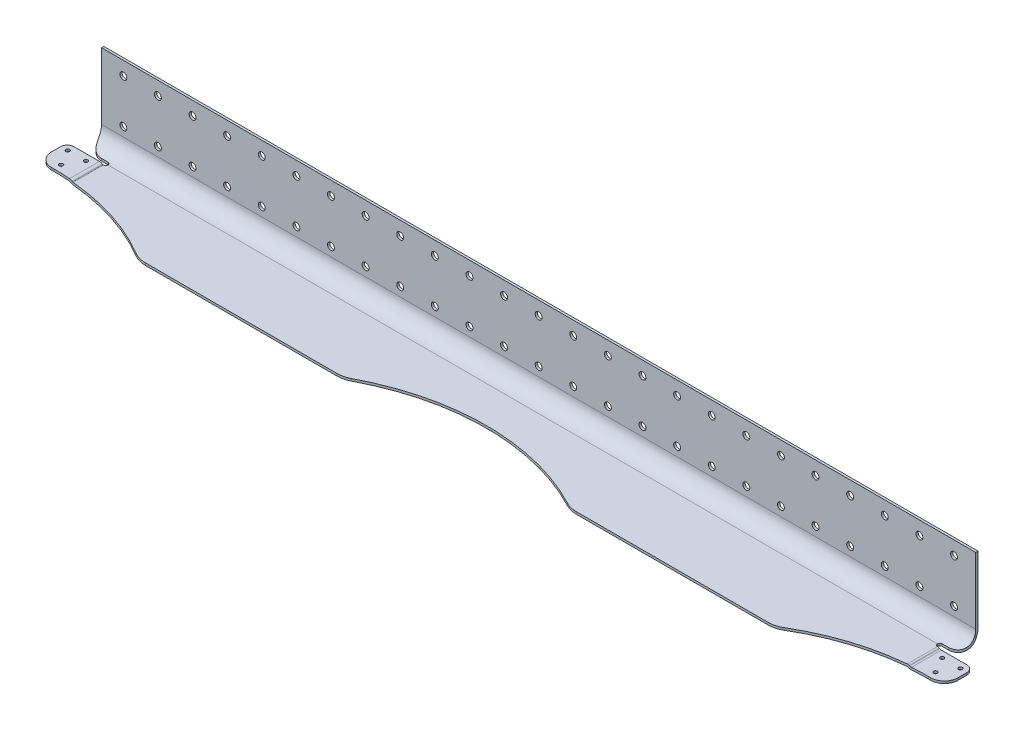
ISO-10303-21;
HEADER;
FILE_DESCRIPTION(('STEP AP214'),'2;1');
FILE_NAME('part.step','',(''),(''),'','','');
FILE_SCHEMA(('AUTOMOTIVE_DESIGN { 1 0 10303 214 1 1 1 1 }'));
ENDSEC;
DATA;
#1=APPLICATION_CONTEXT('core data for automotive mechanical design processes');
#2=APPLICATION_PROTOCOL_DEFINITION('international standard','automotive_design',2000,#1);
#3=PRODUCT_CONTEXT('',#1,'mechanical');
#4=PRODUCT('Part','Part','',(#3));
#5=PRODUCT_RELATED_PRODUCT_CATEGORY('part','',(#4));
#6=PRODUCT_DEFINITION_FORMATION('','',#4);
#7=PRODUCT_DEFINITION_CONTEXT('part definition',#1,'design');
#8=PRODUCT_DEFINITION('design','',#6,#7);
#9=PRODUCT_DEFINITION_SHAPE('','',#8);
#10=(LENGTH_UNIT() NAMED_UNIT(*) SI_UNIT(.MILLI.,.METRE.));
#11=(NAMED_UNIT(*) PLANE_ANGLE_UNIT() SI_UNIT($,.RADIAN.));
#12=(NAMED_UNIT(*) SI_UNIT($,.STERADIAN.) SOLID_ANGLE_UNIT());
#13=UNCERTAINTY_MEASURE_WITH_UNIT(LENGTH_MEASURE(1.E-05),#10,'distance_accuracy_value','');
#14=(GEOMETRIC_REPRESENTATION_CONTEXT(3) GLOBAL_UNCERTAINTY_ASSIGNED_CONTEXT((#13)) GLOBAL_UNIT_ASSIGNED_CONTEXT((#10,
#11,#12)) REPRESENTATION_CONTEXT('',''));
#15=CARTESIAN_POINT('',(0.,0.,0.));
#16=DIRECTION('',(0.,0.,1.));
#17=DIRECTION('',(1.,0.,0.));
#18=AXIS2_PLACEMENT_3D('',#15,#16,#17);
#19=CARTESIAN_POINT('',(609.4222,-68.58,25.4));
#20=DIRECTION('',(0.,1.,0.));
#21=DIRECTION('',(0.,0.,1.));
#22=AXIS2_PLACEMENT_3D('',#19,#20,#21);
#23=PLANE('',#22);
#24=DIRECTION('',(-1.,0.,0.));
#25=VECTOR('',#24,1.);
#26=CARTESIAN_POINT('',(609.4222,-68.58,117.475));
#27=LINE('',#26,#25);
#28=CARTESIAN_POINT('',(-166.86518980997,-68.58,117.475));
#29=VERTEX_POINT('',#28);
#30=CARTESIAN_POINT('',(-433.966549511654,-68.58,117.475));
#31=VERTEX_POINT('',#30);
#32=EDGE_CURVE('E689',#29,#31,#27,.T.);
#33=ORIENTED_EDGE('',*,*,#32,.T.);
#34=CARTESIAN_POINT('',(-433.966549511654,-68.58,82.4750000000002));
#35=DIRECTION('',(0.,1.,0.));
#36=DIRECTION('',(0.,0.,1.));
#37=AXIS2_PLACEMENT_3D('',#34,#35,#36);
#38=CIRCLE('',#37,35.);
#39=CARTESIAN_POINT('',(-451.792598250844,-68.58,112.595291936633));
#40=VERTEX_POINT('',#39);
#41=EDGE_CURVE('E665',#31,#40,#38,.F.);
#42=ORIENTED_EDGE('',*,*,#41,.T.);
#43=CARTESIAN_POINT('',(-609.6,-68.5800000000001,379.239071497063));
#44=DIRECTION('',(0.,1.,0.));
#45=DIRECTION('',(0.,0.,1.));
#46=AXIS2_PLACEMENT_3D('',#43,#44,#45);
#47=CIRCLE('',#46,309.842026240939);
#48=CARTESIAN_POINT('',(-581.470877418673,-68.5799999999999,70.6765434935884));
#49=VERTEX_POINT('',#48);
#50=EDGE_CURVE('E1718',#40,#49,#47,.T.);
#51=ORIENTED_EDGE('',*,*,#50,.T.);
#52=DIRECTION('',(0.,0.,-1.));
#53=VECTOR('',#52,1.);
#54=CARTESIAN_POINT('',(-581.470877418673,-68.58,75.4));
#55=LINE('',#54,#53);
#56=CARTESIAN_POINT('',(-581.470877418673,-68.58,28.575));
#57=VERTEX_POINT('',#56);
#58=EDGE_CURVE('E884',#49,#57,#55,.T.);
#59=ORIENTED_EDGE('',*,*,#58,.T.);
#60=CARTESIAN_POINT('',(-581.470877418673,-68.58,25.4));
#61=DIRECTION('',(0.,1.,0.));
#62=DIRECTION('',(0.,0.,1.));
#63=AXIS2_PLACEMENT_3D('',#60,#61,#62);
#64=CIRCLE('',#63,3.175);
#65=CARTESIAN_POINT('',(-578.295877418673,-68.58,25.4));
#66=VERTEX_POINT('',#65);
#67=EDGE_CURVE('E868',#57,#66,#64,.T.);
#68=ORIENTED_EDGE('',*,*,#67,.T.);
#69=DIRECTION('',(-1.,0.,0.));
#70=VECTOR('',#69,1.);
#71=CARTESIAN_POINT('',(609.4222,-68.58,25.4));
#72=LINE('',#71,#70);
#73=CARTESIAN_POINT('',(578.295877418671,-68.58,25.4));
#74=VERTEX_POINT('',#73);
#75=EDGE_CURVE('E738',#74,#66,#72,.T.);
#76=ORIENTED_EDGE('',*,*,#75,.F.);
#77=CARTESIAN_POINT('',(581.470877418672,-68.58,25.4));
#78=DIRECTION('',(0.,1.,0.));
#79=DIRECTION('',(0.,0.,1.));
#80=AXIS2_PLACEMENT_3D('',#77,#78,#79);
#81=CIRCLE('',#80,3.17500000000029);
#82=CARTESIAN_POINT('',(581.470877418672,-68.58,28.5750000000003));
#83=VERTEX_POINT('',#82);
#84=EDGE_CURVE('E854',#74,#83,#81,.T.);
#85=ORIENTED_EDGE('',*,*,#84,.T.);
#86=DIRECTION('',(0.,0.,-1.));
#87=VECTOR('',#86,1.);
#88=CARTESIAN_POINT('',(581.470877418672,-68.58,75.4));
#89=LINE('',#88,#87);
#90=CARTESIAN_POINT('',(581.470877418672,-68.58,70.676543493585));
#91=VERTEX_POINT('',#90);
#92=EDGE_CURVE('E876',#91,#83,#89,.T.);
#93=ORIENTED_EDGE('',*,*,#92,.F.);
#94=CARTESIAN_POINT('',(609.599999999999,-68.5800000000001,379.239071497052));
#95=DIRECTION('',(0.,1.,0.));
#96=DIRECTION('',(0.,0.,1.));
#97=AXIS2_PLACEMENT_3D('',#94,#95,#96);
#98=CIRCLE('',#97,309.842026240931);
#99=CARTESIAN_POINT('',(451.792598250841,-68.58,112.595291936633));
#100=VERTEX_POINT('',#99);
#101=EDGE_CURVE('E1765',#91,#100,#98,.T.);
#102=ORIENTED_EDGE('',*,*,#101,.T.);
#103=CARTESIAN_POINT('',(433.96654951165,-68.58,82.475));
#104=DIRECTION('',(0.,1.,0.));
#105=DIRECTION('',(0.,0.,1.));
#106=AXIS2_PLACEMENT_3D('',#103,#104,#105);
#107=CIRCLE('',#106,35.);
#108=CARTESIAN_POINT('',(433.96654951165,-68.58,117.475));
#109=VERTEX_POINT('',#108);
#110=EDGE_CURVE('E654',#100,#109,#107,.F.);
#111=ORIENTED_EDGE('',*,*,#110,.T.);
#112=CARTESIAN_POINT('',(166.86518980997,-68.58,117.475));
#113=VERTEX_POINT('',#112);
#114=EDGE_CURVE('E679',#109,#113,#27,.T.);
#115=ORIENTED_EDGE('',*,*,#114,.T.);
#116=CARTESIAN_POINT('',(166.86518980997,-68.58,82.4750000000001));
#117=DIRECTION('',(0.,1.,0.));
#118=DIRECTION('',(0.,0.,1.));
#119=AXIS2_PLACEMENT_3D('',#116,#117,#118);
#120=CIRCLE('',#119,35.);
#121=CARTESIAN_POINT('',(150.548637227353,-68.58,113.439013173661));
#122=VERTEX_POINT('',#121);
#123=EDGE_CURVE('E66',#113,#122,#120,.F.);
#124=ORIENTED_EDGE('',*,*,#123,.T.);
#125=CARTESIAN_POINT('',(0.,-68.58,399.136004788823));
#126=DIRECTION('',(0.,1.,0.));
#127=DIRECTION('',(0.,0.,1.));
#128=AXIS2_PLACEMENT_3D('',#125,#126,#127);
#129=CIRCLE('',#128,322.936004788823);
#130=CARTESIAN_POINT('',(-150.548637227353,-68.58,113.439013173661));
#131=VERTEX_POINT('',#130);
#132=EDGE_CURVE('E700',#122,#131,#129,.T.);
#133=ORIENTED_EDGE('',*,*,#132,.T.);
#134=CARTESIAN_POINT('',(-166.86518980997,-68.58,82.4750000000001));
#135=DIRECTION('',(0.,1.,0.));
#136=DIRECTION('',(0.,0.,1.));
#137=AXIS2_PLACEMENT_3D('',#134,#135,#136);
#138=CIRCLE('',#137,35.);
#139=EDGE_CURVE('E58',#131,#29,#138,.F.);
#140=ORIENTED_EDGE('',*,*,#139,.T.);
#141=EDGE_LOOP('',(#33,#42,#51,#59,#68,#76,#85,#93,#102,#111,#115,#124,#133,#140));
#142=FACE_BOUND('',#141,.T.);
#143=ADVANCED_FACE('F42',(#142),#23,.F.);
#144=CARTESIAN_POINT('',(609.4222,-65.405,25.4));
#145=DIRECTION('',(0.,-1.,0.));
#146=DIRECTION('',(0.,0.,-1.));
#147=AXIS2_PLACEMENT_3D('',#144,#145,#146);
#148=PLANE('',#147);
#149=CARTESIAN_POINT('',(-609.6,-65.405,379.239071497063));
#150=DIRECTION('',(0.,-1.,0.));
#151=DIRECTION('',(0.,0.,-1.));
#152=AXIS2_PLACEMENT_3D('',#149,#150,#151);
#153=CIRCLE('',#152,309.842026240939);
#154=CARTESIAN_POINT('',(-581.470877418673,-65.4050000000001,70.6765434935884));
#155=VERTEX_POINT('',#154);
#156=CARTESIAN_POINT('',(-451.792598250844,-65.405,112.595291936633));
#157=VERTEX_POINT('',#156);
#158=EDGE_CURVE('E1595',#155,#157,#153,.T.);
#159=ORIENTED_EDGE('',*,*,#158,.T.);
#160=CARTESIAN_POINT('',(-433.966549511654,-65.405,82.4750000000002));
#161=DIRECTION('',(0.,-1.,0.));
#162=DIRECTION('',(0.,0.,-1.));
#163=AXIS2_PLACEMENT_3D('',#160,#161,#162);
#164=CIRCLE('',#163,35.);
#165=CARTESIAN_POINT('',(-433.966549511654,-65.405,117.475));
#166=VERTEX_POINT('',#165);
#167=EDGE_CURVE('E646',#157,#166,#164,.F.);
#168=ORIENTED_EDGE('',*,*,#167,.T.);
#169=DIRECTION('',(1.,0.,0.));
#170=VECTOR('',#169,1.);
#171=CARTESIAN_POINT('',(609.4222,-65.405,117.475));
#172=LINE('',#171,#170);
#173=CARTESIAN_POINT('',(-166.86518980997,-65.405,117.475));
#174=VERTEX_POINT('',#173);
#175=EDGE_CURVE('E1795',#166,#174,#172,.T.);
#176=ORIENTED_EDGE('',*,*,#175,.T.);
#177=CARTESIAN_POINT('',(-166.86518980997,-65.405,82.4750000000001));
#178=DIRECTION('',(0.,-1.,0.));
#179=DIRECTION('',(0.,0.,-1.));
#180=AXIS2_PLACEMENT_3D('',#177,#178,#179);
#181=CIRCLE('',#180,35.);
#182=CARTESIAN_POINT('',(-150.548637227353,-65.405,113.439013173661));
#183=VERTEX_POINT('',#182);
#184=EDGE_CURVE('E644',#174,#183,#181,.F.);
#185=ORIENTED_EDGE('',*,*,#184,.T.);
#186=CARTESIAN_POINT('',(0.,-65.405,399.136004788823));
#187=DIRECTION('',(0.,-1.,0.));
#188=DIRECTION('',(0.,0.,-1.));
#189=AXIS2_PLACEMENT_3D('',#186,#187,#188);
#190=CIRCLE('',#189,322.936004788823);
#191=CARTESIAN_POINT('',(150.548637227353,-65.405,113.439013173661));
#192=VERTEX_POINT('',#191);
#193=EDGE_CURVE('E696',#183,#192,#190,.T.);
#194=ORIENTED_EDGE('',*,*,#193,.T.);
#195=CARTESIAN_POINT('',(166.86518980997,-65.405,82.4750000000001));
#196=DIRECTION('',(0.,-1.,0.));
#197=DIRECTION('',(0.,0.,-1.));
#198=AXIS2_PLACEMENT_3D('',#195,#196,#197);
#199=CIRCLE('',#198,35.);
#200=CARTESIAN_POINT('',(166.86518980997,-65.405,117.475));
#201=VERTEX_POINT('',#200);
#202=EDGE_CURVE('E639',#192,#201,#199,.F.);
#203=ORIENTED_EDGE('',*,*,#202,.T.);
#204=CARTESIAN_POINT('',(433.96654951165,-65.405,117.475));
#205=VERTEX_POINT('',#204);
#206=EDGE_CURVE('E681',#201,#205,#172,.T.);
#207=ORIENTED_EDGE('',*,*,#206,.T.);
#208=CARTESIAN_POINT('',(433.96654951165,-65.405,82.475));
#209=DIRECTION('',(0.,-1.,0.));
#210=DIRECTION('',(0.,0.,-1.));
#211=AXIS2_PLACEMENT_3D('',#208,#209,#210);
#212=CIRCLE('',#211,35.);
#213=CARTESIAN_POINT('',(451.792598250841,-65.405,112.595291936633));
#214=VERTEX_POINT('',#213);
#215=EDGE_CURVE('E640',#205,#214,#212,.F.);
#216=ORIENTED_EDGE('',*,*,#215,.T.);
#217=CARTESIAN_POINT('',(609.599999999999,-65.405,379.239071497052));
#218=DIRECTION('',(0.,-1.,0.));
#219=DIRECTION('',(0.,0.,-1.));
#220=AXIS2_PLACEMENT_3D('',#217,#218,#219);
#221=CIRCLE('',#220,309.842026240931);
#222=CARTESIAN_POINT('',(581.470877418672,-65.4050000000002,70.676543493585));
#223=VERTEX_POINT('',#222);
#224=EDGE_CURVE('E419',#214,#223,#221,.T.);
#225=ORIENTED_EDGE('',*,*,#224,.T.);
#226=DIRECTION('',(0.,0.,1.));
#227=VECTOR('',#226,1.);
#228=CARTESIAN_POINT('',(581.470877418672,-65.405,25.4));
#229=LINE('',#228,#227);
#230=CARTESIAN_POINT('',(581.470877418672,-65.405,28.5750000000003));
#231=VERTEX_POINT('',#230);
#232=EDGE_CURVE('E916',#231,#223,#229,.T.);
#233=ORIENTED_EDGE('',*,*,#232,.F.);
#234=CARTESIAN_POINT('',(581.470877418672,-65.405,25.4));
#235=DIRECTION('',(0.,-1.,0.));
#236=DIRECTION('',(0.,0.,-1.));
#237=AXIS2_PLACEMENT_3D('',#234,#235,#236);
#238=CIRCLE('',#237,3.17500000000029);
#239=CARTESIAN_POINT('',(578.295877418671,-65.405,25.4));
#240=VERTEX_POINT('',#239);
#241=EDGE_CURVE('E865',#231,#240,#238,.T.);
#242=ORIENTED_EDGE('',*,*,#241,.T.);
#243=DIRECTION('',(-1.,0.,0.));
#244=VECTOR('',#243,1.);
#245=CARTESIAN_POINT('',(609.4222,-65.405,25.4));
#246=LINE('',#245,#244);
#247=CARTESIAN_POINT('',(-578.295877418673,-65.405,25.4));
#248=VERTEX_POINT('',#247);
#249=EDGE_CURVE('E570',#240,#248,#246,.T.);
#250=ORIENTED_EDGE('',*,*,#249,.T.);
#251=CARTESIAN_POINT('',(-581.470877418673,-65.405,25.4));
#252=DIRECTION('',(0.,-1.,0.));
#253=DIRECTION('',(0.,0.,-1.));
#254=AXIS2_PLACEMENT_3D('',#251,#252,#253);
#255=CIRCLE('',#254,3.175);
#256=CARTESIAN_POINT('',(-581.470877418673,-65.4050000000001,28.575));
#257=VERTEX_POINT('',#256);
#258=EDGE_CURVE('E873',#248,#257,#255,.T.);
#259=ORIENTED_EDGE('',*,*,#258,.T.);
#260=DIRECTION('',(0.,0.,-1.));
#261=VECTOR('',#260,1.);
#262=CARTESIAN_POINT('',(-581.470877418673,-65.4050000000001,75.4));
#263=LINE('',#262,#261);
#264=EDGE_CURVE('E912',#155,#257,#263,.T.);
#265=ORIENTED_EDGE('',*,*,#264,.F.);
#266=EDGE_LOOP('',(#159,#168,#176,#185,#194,#203,#207,#216,#225,#233,#242,#250,#259,#265));
#267=FACE_BOUND('',#266,.T.);
#268=ADVANCED_FACE('F450',(#267),#148,.F.);
#269=CARTESIAN_POINT('',(609.4222,-43.18,25.4));
#270=DIRECTION('',(-1.,0.,0.));
#271=DIRECTION('',(0.,0.,1.));
#272=AXIS2_PLACEMENT_3D('',#269,#270,#271);
#273=PLANE('',#272);
#274=DIRECTION('',(0.,-1.,0.));
#275=VECTOR('',#274,1.);
#276=CARTESIAN_POINT('',(609.4222,49.5299999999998,3.175));
#277=LINE('',#276,#275);
#278=CARTESIAN_POINT('',(609.4222,49.5299999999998,3.175));
#279=VERTEX_POINT('',#278);
#280=CARTESIAN_POINT('',(609.4222,-43.18,3.17499999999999));
#281=VERTEX_POINT('',#280);
#282=EDGE_CURVE('E713',#279,#281,#277,.T.);
#283=ORIENTED_EDGE('',*,*,#282,.T.);
#284=DIRECTION('',(0.,-1.,0.));
#285=VECTOR('',#284,1.);
#286=CARTESIAN_POINT('',(609.4222,-43.18,3.17499999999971));
#287=LINE('',#286,#285);
#288=CARTESIAN_POINT('',(609.4222,-55.476722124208,3.17499999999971));
#289=VERTEX_POINT('',#288);
#290=EDGE_CURVE('E575',#281,#289,#287,.T.);
#291=ORIENTED_EDGE('',*,*,#290,.T.);
#292=CARTESIAN_POINT('',(609.4222,-43.18,25.4));
#293=DIRECTION('',(1.,0.,0.));
#294=DIRECTION('',(0.,0.,1.));
#295=AXIS2_PLACEMENT_3D('',#292,#293,#294);
#296=CIRCLE('',#295,25.4);
#297=CARTESIAN_POINT('',(609.4222,-43.18,0.));
#298=VERTEX_POINT('',#297);
#299=EDGE_CURVE('E716',#289,#298,#296,.T.);
#300=ORIENTED_EDGE('',*,*,#299,.T.);
#301=DIRECTION('',(0.,1.,0.));
#302=VECTOR('',#301,1.);
#303=CARTESIAN_POINT('',(609.4222,49.5299999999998,0.));
#304=LINE('',#303,#302);
#305=CARTESIAN_POINT('',(609.4222,49.5299999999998,0.));
#306=VERTEX_POINT('',#305);
#307=EDGE_CURVE('E721',#298,#306,#304,.T.);
#308=ORIENTED_EDGE('',*,*,#307,.T.);
#309=DIRECTION('',(0.,0.,1.));
#310=VECTOR('',#309,1.);
#311=CARTESIAN_POINT('',(609.4222,49.5299999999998,3.175));
#312=LINE('',#311,#310);
#313=EDGE_CURVE('E708',#306,#279,#312,.T.);
#314=ORIENTED_EDGE('',*,*,#313,.T.);
#315=EDGE_LOOP('',(#283,#291,#300,#308,#314));
#316=FACE_BOUND('',#315,.T.);
#317=ADVANCED_FACE('F452',(#316),#273,.F.);
#318=CARTESIAN_POINT('',(609.4222,49.5299999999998,3.175));
#319=DIRECTION('',(0.,-1.,0.));
#320=DIRECTION('',(0.,0.,-1.));
#321=AXIS2_PLACEMENT_3D('',#318,#319,#320);
#322=PLANE('',#321);
#323=DIRECTION('',(0.,0.,1.));
#324=VECTOR('',#323,1.);
#325=CARTESIAN_POINT('',(-609.4222,49.5299999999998,3.175));
#326=LINE('',#325,#324);
#327=CARTESIAN_POINT('',(-609.4222,49.5299999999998,0.));
#328=VERTEX_POINT('',#327);
#329=CARTESIAN_POINT('',(-609.4222,49.5299999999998,3.175));
#330=VERTEX_POINT('',#329);
#331=EDGE_CURVE('E557',#328,#330,#326,.T.);
#332=ORIENTED_EDGE('',*,*,#331,.T.);
#333=DIRECTION('',(-1.,0.,0.));
#334=VECTOR('',#333,1.);
#335=CARTESIAN_POINT('',(609.4222,49.5299999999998,3.175));
#336=LINE('',#335,#334);
#337=EDGE_CURVE('E560',#279,#330,#336,.T.);
#338=ORIENTED_EDGE('',*,*,#337,.F.);
#339=ORIENTED_EDGE('',*,*,#313,.F.);
#340=DIRECTION('',(-1.,0.,0.));
#341=VECTOR('',#340,1.);
#342=CARTESIAN_POINT('',(609.4222,49.5299999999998,0.));
#343=LINE('',#342,#341);
#344=EDGE_CURVE('E722',#306,#328,#343,.T.);
#345=ORIENTED_EDGE('',*,*,#344,.T.);
#346=EDGE_LOOP('',(#332,#338,#339,#345));
#347=FACE_BOUND('',#346,.T.);
#348=ADVANCED_FACE('F1347',(#347),#322,.F.);
#349=CARTESIAN_POINT('',(609.4222,49.5299999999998,3.175));
#350=DIRECTION('',(0.,0.,-1.));
#351=DIRECTION('',(0.,1.,0.));
#352=AXIS2_PLACEMENT_3D('',#349,#350,#351);
#353=PLANE('',#352);
#354=CARTESIAN_POINT('',(96.5199999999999,30.4800000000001,3.175));
#355=DIRECTION('',(0.,0.,-1.));
#356=DIRECTION('',(0.,1.,0.));
#357=AXIS2_PLACEMENT_3D('',#354,#355,#356);
#358=CIRCLE('',#357,4.82600000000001);
#359=CARTESIAN_POINT('',(96.5199999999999,35.3060000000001,3.175));
#360=VERTEX_POINT('',#359);
#361=EDGE_CURVE('E707',#360,#360,#358,.F.);
#362=ORIENTED_EDGE('',*,*,#361,.F.);
#363=EDGE_LOOP('',(#362));
#364=FACE_BOUND('',#363,.T.);
#365=CARTESIAN_POINT('',(48.2600000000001,-30.4800000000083,3.17499999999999));
#366=DIRECTION('',(0.,0.,-1.));
#367=DIRECTION('',(0.,1.,0.));
#368=AXIS2_PLACEMENT_3D('',#365,#366,#367);
#369=CIRCLE('',#368,4.82600000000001);
#370=CARTESIAN_POINT('',(48.2600000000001,-25.6540000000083,3.17499999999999));
#371=VERTEX_POINT('',#370);
#372=EDGE_CURVE('E1336',#371,#371,#369,.F.);
#373=ORIENTED_EDGE('',*,*,#372,.F.);
#374=EDGE_LOOP('',(#373));
#375=FACE_BOUND('',#374,.T.);
#376=CARTESIAN_POINT('',(48.2599999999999,30.48,3.175));
#377=DIRECTION('',(0.,0.,-1.));
#378=DIRECTION('',(0.,1.,0.));
#379=AXIS2_PLACEMENT_3D('',#376,#377,#378);
#380=CIRCLE('',#379,4.82600000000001);
#381=CARTESIAN_POINT('',(48.2599999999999,35.306,3.175));
#382=VERTEX_POINT('',#381);
#383=EDGE_CURVE('E1335',#382,#382,#380,.F.);
#384=ORIENTED_EDGE('',*,*,#383,.F.);
#385=EDGE_LOOP('',(#384));
#386=FACE_BOUND('',#385,.T.);
#387=CARTESIAN_POINT('',(1.11022302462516E-13,-30.4800000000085,3.17499999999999));
#388=DIRECTION('',(0.,0.,-1.));
#389=DIRECTION('',(0.,1.,0.));
#390=AXIS2_PLACEMENT_3D('',#387,#388,#389);
#391=CIRCLE('',#390,4.82600000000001);
#392=CARTESIAN_POINT('',(1.11022302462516E-13,-25.6540000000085,3.17499999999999));
#393=VERTEX_POINT('',#392);
#394=EDGE_CURVE('E1329',#393,#393,#391,.F.);
#395=ORIENTED_EDGE('',*,*,#394,.F.);
#396=EDGE_LOOP('',(#395));
#397=FACE_BOUND('',#396,.T.);
#398=CARTESIAN_POINT('',(193.04,30.4800000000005,3.175));
#399=DIRECTION('',(0.,0.,-1.));
#400=DIRECTION('',(0.,1.,0.));
#401=AXIS2_PLACEMENT_3D('',#398,#399,#400);
#402=CIRCLE('',#401,4.82600000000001);
#403=CARTESIAN_POINT('',(193.04,35.3060000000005,3.175));
#404=VERTEX_POINT('',#403);
#405=EDGE_CURVE('E1326',#404,#404,#402,.F.);
#406=ORIENTED_EDGE('',*,*,#405,.F.);
#407=EDGE_LOOP('',(#406));
#408=FACE_BOUND('',#407,.T.);
#409=CARTESIAN_POINT('',(144.78,-30.480000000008,3.17499999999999));
#410=DIRECTION('',(0.,0.,-1.));
#411=DIRECTION('',(0.,1.,0.));
#412=AXIS2_PLACEMENT_3D('',#409,#410,#411);
#413=CIRCLE('',#412,4.82600000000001);
#414=CARTESIAN_POINT('',(144.78,-25.654000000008,3.17499999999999));
#415=VERTEX_POINT('',#414);
#416=EDGE_CURVE('E1325',#415,#415,#413,.F.);
#417=ORIENTED_EDGE('',*,*,#416,.F.);
#418=EDGE_LOOP('',(#417));
#419=FACE_BOUND('',#418,.T.);
#420=CARTESIAN_POINT('',(144.78,30.4800000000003,3.175));
#421=DIRECTION('',(0.,0.,-1.));
#422=DIRECTION('',(0.,1.,0.));
#423=AXIS2_PLACEMENT_3D('',#420,#421,#422);
#424=CIRCLE('',#423,4.82600000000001);
#425=CARTESIAN_POINT('',(144.78,35.3060000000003,3.175));
#426=VERTEX_POINT('',#425);
#427=EDGE_CURVE('E1317',#426,#426,#424,.F.);
#428=ORIENTED_EDGE('',*,*,#427,.F.);
#429=EDGE_LOOP('',(#428));
#430=FACE_BOUND('',#429,.T.);
#431=CARTESIAN_POINT('',(96.5200000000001,-30.4800000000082,3.17499999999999));
#432=DIRECTION('',(0.,0.,-1.));
#433=DIRECTION('',(0.,1.,0.));
#434=AXIS2_PLACEMENT_3D('',#431,#432,#433);
#435=CIRCLE('',#434,4.82600000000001);
#436=CARTESIAN_POINT('',(96.5200000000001,-25.6540000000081,3.17499999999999));
#437=VERTEX_POINT('',#436);
#438=EDGE_CURVE('E1314',#437,#437,#435,.F.);
#439=ORIENTED_EDGE('',*,*,#438,.F.);
#440=EDGE_LOOP('',(#439));
#441=FACE_BOUND('',#440,.T.);
#442=CARTESIAN_POINT('',(-96.5200000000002,30.4799999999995,3.175));
#443=DIRECTION('',(0.,0.,-1.));
#444=DIRECTION('',(0.,1.,0.));
#445=AXIS2_PLACEMENT_3D('',#442,#443,#444);
#446=CIRCLE('',#445,4.82600000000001);
#447=CARTESIAN_POINT('',(-96.5200000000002,35.3059999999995,3.175));
#448=VERTEX_POINT('',#447);
#449=EDGE_CURVE('E1309',#448,#448,#446,.F.);
#450=ORIENTED_EDGE('',*,*,#449,.F.);
#451=EDGE_LOOP('',(#450));
#452=FACE_BOUND('',#451,.T.);
#453=CARTESIAN_POINT('',(-144.78,-30.480000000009,3.17499999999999));
#454=DIRECTION('',(0.,0.,-1.));
#455=DIRECTION('',(0.,1.,0.));
#456=AXIS2_PLACEMENT_3D('',#453,#454,#455);
#457=CIRCLE('',#456,4.82600000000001);
#458=CARTESIAN_POINT('',(-144.78,-25.654000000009,3.17499999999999));
#459=VERTEX_POINT('',#458);
#460=EDGE_CURVE('E1306',#459,#459,#457,.F.);
#461=ORIENTED_EDGE('',*,*,#460,.F.);
#462=EDGE_LOOP('',(#461));
#463=FACE_BOUND('',#462,.T.);
#464=CARTESIAN_POINT('',(-144.78,30.4799999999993,3.175));
#465=DIRECTION('',(0.,0.,-1.));
#466=DIRECTION('',(0.,1.,0.));
#467=AXIS2_PLACEMENT_3D('',#464,#465,#466);
#468=CIRCLE('',#467,4.82600000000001);
#469=CARTESIAN_POINT('',(-144.78,35.3059999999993,3.175));
#470=VERTEX_POINT('',#469);
#471=EDGE_CURVE('E1305',#470,#470,#468,.F.);
#472=ORIENTED_EDGE('',*,*,#471,.F.);
#473=EDGE_LOOP('',(#472));
#474=FACE_BOUND('',#473,.T.);
#475=CARTESIAN_POINT('',(-193.04,-30.4800000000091,3.17499999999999));
#476=DIRECTION('',(0.,0.,-1.));
#477=DIRECTION('',(0.,1.,0.));
#478=AXIS2_PLACEMENT_3D('',#475,#476,#477);
#479=CIRCLE('',#478,4.82600000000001);
#480=CARTESIAN_POINT('',(-193.04,-25.6540000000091,3.17499999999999));
#481=VERTEX_POINT('',#480);
#482=EDGE_CURVE('E1297',#481,#481,#479,.F.);
#483=ORIENTED_EDGE('',*,*,#482,.F.);
#484=EDGE_LOOP('',(#483));
#485=FACE_BOUND('',#484,.T.);
#486=CARTESIAN_POINT('',(-1.11022302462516E-13,30.4799999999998,3.175));
#487=DIRECTION('',(0.,0.,-1.));
#488=DIRECTION('',(0.,1.,0.));
#489=AXIS2_PLACEMENT_3D('',#486,#487,#488);
#490=CIRCLE('',#489,4.82600000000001);
#491=CARTESIAN_POINT('',(-1.11022302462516E-13,35.3059999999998,3.175));
#492=VERTEX_POINT('',#491);
#493=EDGE_CURVE('E1291',#492,#492,#490,.F.);
#494=ORIENTED_EDGE('',*,*,#493,.F.);
#495=EDGE_LOOP('',(#494));
#496=FACE_BOUND('',#495,.T.);
#497=CARTESIAN_POINT('',(-48.2599999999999,-30.4800000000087,3.17499999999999));
#498=DIRECTION('',(0.,0.,-1.));
#499=DIRECTION('',(0.,1.,0.));
#500=AXIS2_PLACEMENT_3D('',#497,#498,#499);
#501=CIRCLE('',#500,4.82600000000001);
#502=CARTESIAN_POINT('',(-48.2599999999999,-25.6540000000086,3.17499999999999));
#503=VERTEX_POINT('',#502);
#504=EDGE_CURVE('E1289',#503,#503,#501,.F.);
#505=ORIENTED_EDGE('',*,*,#504,.F.);
#506=EDGE_LOOP('',(#505));
#507=FACE_BOUND('',#506,.T.);
#508=CARTESIAN_POINT('',(-48.2600000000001,30.4799999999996,3.175));
#509=DIRECTION('',(0.,0.,-1.));
#510=DIRECTION('',(0.,1.,0.));
#511=AXIS2_PLACEMENT_3D('',#508,#509,#510);
#512=CIRCLE('',#511,4.82600000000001);
#513=CARTESIAN_POINT('',(-48.2600000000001,35.3059999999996,3.175));
#514=VERTEX_POINT('',#513);
#515=EDGE_CURVE('E1286',#514,#514,#512,.F.);
#516=ORIENTED_EDGE('',*,*,#515,.F.);
#517=EDGE_LOOP('',(#516));
#518=FACE_BOUND('',#517,.T.);
#519=CARTESIAN_POINT('',(-96.5199999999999,-30.4800000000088,3.17499999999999));
#520=DIRECTION('',(0.,0.,-1.));
#521=DIRECTION('',(0.,1.,0.));
#522=AXIS2_PLACEMENT_3D('',#519,#520,#521);
#523=CIRCLE('',#522,4.82600000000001);
#524=CARTESIAN_POINT('',(-96.5199999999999,-25.6540000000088,3.17499999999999));
#525=VERTEX_POINT('',#524);
#526=EDGE_CURVE('E1285',#525,#525,#523,.F.);
#527=ORIENTED_EDGE('',*,*,#526,.F.);
#528=EDGE_LOOP('',(#527));
#529=FACE_BOUND('',#528,.T.);
#530=CARTESIAN_POINT('',(482.6,30.4800000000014,3.175));
#531=DIRECTION('',(0.,0.,-1.));
#532=DIRECTION('',(0.,1.,0.));
#533=AXIS2_PLACEMENT_3D('',#530,#531,#532);
#534=CIRCLE('',#533,4.82600000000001);
#535=CARTESIAN_POINT('',(482.6,35.3060000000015,3.175));
#536=VERTEX_POINT('',#535);
#537=EDGE_CURVE('E1278',#536,#536,#534,.F.);
#538=ORIENTED_EDGE('',*,*,#537,.F.);
#539=EDGE_LOOP('',(#538));
#540=FACE_BOUND('',#539,.T.);
#541=CARTESIAN_POINT('',(434.34,-30.480000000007,3.17499999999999));
#542=DIRECTION('',(0.,0.,-1.));
#543=DIRECTION('',(0.,1.,0.));
#544=AXIS2_PLACEMENT_3D('',#541,#542,#543);
#545=CIRCLE('',#544,4.82600000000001);
#546=CARTESIAN_POINT('',(434.34,-25.654000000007,3.17499999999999));
#547=VERTEX_POINT('',#546);
#548=EDGE_CURVE('E1274',#547,#547,#545,.F.);
#549=ORIENTED_EDGE('',*,*,#548,.F.);
#550=EDGE_LOOP('',(#549));
#551=FACE_BOUND('',#550,.T.);
#552=CARTESIAN_POINT('',(434.34,30.4800000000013,3.175));
#553=DIRECTION('',(0.,0.,-1.));
#554=DIRECTION('',(0.,1.,0.));
#555=AXIS2_PLACEMENT_3D('',#552,#553,#554);
#556=CIRCLE('',#555,4.82600000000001);
#557=CARTESIAN_POINT('',(434.34,35.3060000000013,3.175));
#558=VERTEX_POINT('',#557);
#559=EDGE_CURVE('E1269',#558,#558,#556,.F.);
#560=ORIENTED_EDGE('',*,*,#559,.F.);
#561=EDGE_LOOP('',(#560));
#562=FACE_BOUND('',#561,.T.);
#563=CARTESIAN_POINT('',(386.08,-30.4800000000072,3.17499999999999));
#564=DIRECTION('',(0.,0.,-1.));
#565=DIRECTION('',(0.,1.,0.));
#566=AXIS2_PLACEMENT_3D('',#563,#564,#565);
#567=CIRCLE('',#566,4.82600000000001);
#568=CARTESIAN_POINT('',(386.08,-25.6540000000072,3.17499999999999));
#569=VERTEX_POINT('',#568);
#570=EDGE_CURVE('E1268',#569,#569,#567,.F.);
#571=ORIENTED_EDGE('',*,*,#570,.F.);
#572=EDGE_LOOP('',(#571));
#573=FACE_BOUND('',#572,.T.);
#574=CARTESIAN_POINT('',(579.12,30.4800000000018,3.175));
#575=DIRECTION('',(0.,0.,-1.));
#576=DIRECTION('',(0.,1.,0.));
#577=AXIS2_PLACEMENT_3D('',#574,#575,#576);
#578=CIRCLE('',#577,4.82600000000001);
#579=CARTESIAN_POINT('',(579.12,35.3060000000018,3.175));
#580=VERTEX_POINT('',#579);
#581=EDGE_CURVE('E1265',#580,#580,#578,.F.);
#582=ORIENTED_EDGE('',*,*,#581,.F.);
#583=EDGE_LOOP('',(#582));
#584=FACE_BOUND('',#583,.T.);
#585=CARTESIAN_POINT('',(530.86,-30.4800000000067,3.17499999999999));
#586=DIRECTION('',(0.,0.,-1.));
#587=DIRECTION('',(0.,1.,0.));
#588=AXIS2_PLACEMENT_3D('',#585,#586,#587);
#589=CIRCLE('',#588,4.82600000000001);
#590=CARTESIAN_POINT('',(530.86,-25.6540000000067,3.17499999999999));
#591=VERTEX_POINT('',#590);
#592=EDGE_CURVE('E1256',#591,#591,#589,.F.);
#593=ORIENTED_EDGE('',*,*,#592,.F.);
#594=EDGE_LOOP('',(#593));
#595=FACE_BOUND('',#594,.T.);
#596=CARTESIAN_POINT('',(530.86,30.4800000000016,3.175));
#597=DIRECTION('',(0.,0.,-1.));
#598=DIRECTION('',(0.,1.,0.));
#599=AXIS2_PLACEMENT_3D('',#596,#597,#598);
#600=CIRCLE('',#599,4.82600000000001);
#601=CARTESIAN_POINT('',(530.86,35.3060000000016,3.175));
#602=VERTEX_POINT('',#601);
#603=EDGE_CURVE('E1253',#602,#602,#600,.F.);
#604=ORIENTED_EDGE('',*,*,#603,.F.);
#605=EDGE_LOOP('',(#604));
#606=FACE_BOUND('',#605,.T.);
#607=CARTESIAN_POINT('',(482.6,-30.4800000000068,3.17499999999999));
#608=DIRECTION('',(0.,0.,-1.));
#609=DIRECTION('',(0.,1.,0.));
#610=AXIS2_PLACEMENT_3D('',#607,#608,#609);
#611=CIRCLE('',#610,4.82600000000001);
#612=CARTESIAN_POINT('',(482.6,-25.6540000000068,3.17499999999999));
#613=VERTEX_POINT('',#612);
#614=EDGE_CURVE('E1248',#613,#613,#611,.F.);
#615=ORIENTED_EDGE('',*,*,#614,.F.);
#616=EDGE_LOOP('',(#615));
#617=FACE_BOUND('',#616,.T.);
#618=CARTESIAN_POINT('',(289.56,30.4800000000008,3.175));
#619=DIRECTION('',(0.,0.,-1.));
#620=DIRECTION('',(0.,1.,0.));
#621=AXIS2_PLACEMENT_3D('',#618,#619,#620);
#622=CIRCLE('',#621,4.82600000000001);
#623=CARTESIAN_POINT('',(289.56,35.3060000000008,3.175));
#624=VERTEX_POINT('',#623);
#625=EDGE_CURVE('E1247',#624,#624,#622,.F.);
#626=ORIENTED_EDGE('',*,*,#625,.F.);
#627=EDGE_LOOP('',(#626));
#628=FACE_BOUND('',#627,.T.);
#629=CARTESIAN_POINT('',(241.3,-30.4800000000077,3.17499999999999));
#630=DIRECTION('',(0.,0.,-1.));
#631=DIRECTION('',(0.,1.,0.));
#632=AXIS2_PLACEMENT_3D('',#629,#630,#631);
#633=CIRCLE('',#632,4.82600000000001);
#634=CARTESIAN_POINT('',(241.3,-25.6540000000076,3.17499999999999));
#635=VERTEX_POINT('',#634);
#636=EDGE_CURVE('E1245',#635,#635,#633,.F.);
#637=ORIENTED_EDGE('',*,*,#636,.F.);
#638=EDGE_LOOP('',(#637));
#639=FACE_BOUND('',#638,.T.);
#640=CARTESIAN_POINT('',(241.3,30.4800000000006,3.175));
#641=DIRECTION('',(0.,0.,-1.));
#642=DIRECTION('',(0.,1.,0.));
#643=AXIS2_PLACEMENT_3D('',#640,#641,#642);
#644=CIRCLE('',#643,4.82600000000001);
#645=CARTESIAN_POINT('',(241.3,35.3060000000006,3.175));
#646=VERTEX_POINT('',#645);
#647=EDGE_CURVE('E1236',#646,#646,#644,.F.);
#648=ORIENTED_EDGE('',*,*,#647,.F.);
#649=EDGE_LOOP('',(#648));
#650=FACE_BOUND('',#649,.T.);
#651=CARTESIAN_POINT('',(193.04,-30.4800000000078,3.17499999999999));
#652=DIRECTION('',(0.,0.,-1.));
#653=DIRECTION('',(0.,1.,0.));
#654=AXIS2_PLACEMENT_3D('',#651,#652,#653);
#655=CIRCLE('',#654,4.82600000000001);
#656=CARTESIAN_POINT('',(193.04,-25.6540000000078,3.17499999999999));
#657=VERTEX_POINT('',#656);
#658=EDGE_CURVE('E1233',#657,#657,#655,.F.);
#659=ORIENTED_EDGE('',*,*,#658,.F.);
#660=EDGE_LOOP('',(#659));
#661=FACE_BOUND('',#660,.T.);
#662=CARTESIAN_POINT('',(386.08,30.4800000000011,3.175));
#663=DIRECTION('',(0.,0.,-1.));
#664=DIRECTION('',(0.,1.,0.));
#665=AXIS2_PLACEMENT_3D('',#662,#663,#664);
#666=CIRCLE('',#665,4.82600000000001);
#667=CARTESIAN_POINT('',(386.08,35.3060000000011,3.175));
#668=VERTEX_POINT('',#667);
#669=EDGE_CURVE('E1228',#668,#668,#666,.F.);
#670=ORIENTED_EDGE('',*,*,#669,.F.);
#671=EDGE_LOOP('',(#670));
#672=FACE_BOUND('',#671,.T.);
#673=CARTESIAN_POINT('',(337.82,-30.4800000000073,3.17499999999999));
#674=DIRECTION('',(0.,0.,-1.));
#675=DIRECTION('',(0.,1.,0.));
#676=AXIS2_PLACEMENT_3D('',#673,#674,#675);
#677=CIRCLE('',#676,4.82600000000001);
#678=CARTESIAN_POINT('',(337.82,-25.6540000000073,3.17499999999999));
#679=VERTEX_POINT('',#678);
#680=EDGE_CURVE('E1227',#679,#679,#677,.F.);
#681=ORIENTED_EDGE('',*,*,#680,.F.);
#682=EDGE_LOOP('',(#681));
#683=FACE_BOUND('',#682,.T.);
#684=CARTESIAN_POINT('',(337.82,30.4800000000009,3.175));
#685=DIRECTION('',(0.,0.,-1.));
#686=DIRECTION('',(0.,1.,0.));
#687=AXIS2_PLACEMENT_3D('',#684,#685,#686);
#688=CIRCLE('',#687,4.82600000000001);
#689=CARTESIAN_POINT('',(337.82,35.306000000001,3.175));
#690=VERTEX_POINT('',#689);
#691=EDGE_CURVE('E1225',#690,#690,#688,.F.);
#692=ORIENTED_EDGE('',*,*,#691,.F.);
#693=EDGE_LOOP('',(#692));
#694=FACE_BOUND('',#693,.T.);
#695=CARTESIAN_POINT('',(289.56,-30.4800000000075,3.17499999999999));
#696=DIRECTION('',(0.,0.,-1.));
#697=DIRECTION('',(0.,1.,0.));
#698=AXIS2_PLACEMENT_3D('',#695,#696,#697);
#699=CIRCLE('',#698,4.82600000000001);
#700=CARTESIAN_POINT('',(289.56,-25.6540000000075,3.17499999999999));
#701=VERTEX_POINT('',#700);
#702=EDGE_CURVE('E1218',#701,#701,#699,.F.);
#703=ORIENTED_EDGE('',*,*,#702,.F.);
#704=EDGE_LOOP('',(#703));
#705=FACE_BOUND('',#704,.T.);
#706=CARTESIAN_POINT('',(-579.12,30.4799999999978,3.175));
#707=DIRECTION('',(0.,0.,-1.));
#708=DIRECTION('',(0.,1.,0.));
#709=AXIS2_PLACEMENT_3D('',#706,#707,#708);
#710=CIRCLE('',#709,4.82600000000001);
#711=CARTESIAN_POINT('',(-579.12,35.3059999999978,3.175));
#712=VERTEX_POINT('',#711);
#713=EDGE_CURVE('E1212',#712,#712,#710,.F.);
#714=ORIENTED_EDGE('',*,*,#713,.F.);
#715=EDGE_LOOP('',(#714));
#716=FACE_BOUND('',#715,.T.);
#717=CARTESIAN_POINT('',(-289.56,30.4799999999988,3.175));
#718=DIRECTION('',(0.,0.,-1.));
#719=DIRECTION('',(0.,1.,0.));
#720=AXIS2_PLACEMENT_3D('',#717,#718,#719);
#721=CIRCLE('',#720,4.82600000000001);
#722=CARTESIAN_POINT('',(-289.56,35.3059999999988,3.175));
#723=VERTEX_POINT('',#722);
#724=EDGE_CURVE('E1207',#723,#723,#721,.F.);
#725=ORIENTED_EDGE('',*,*,#724,.F.);
#726=EDGE_LOOP('',(#725));
#727=FACE_BOUND('',#726,.T.);
#728=CARTESIAN_POINT('',(-337.82,-30.4800000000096,3.17499999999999));
#729=DIRECTION('',(0.,0.,-1.));
#730=DIRECTION('',(0.,1.,0.));
#731=AXIS2_PLACEMENT_3D('',#728,#729,#730);
#732=CIRCLE('',#731,4.82600000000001);
#733=CARTESIAN_POINT('',(-337.82,-25.6540000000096,3.17499999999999));
#734=VERTEX_POINT('',#733);
#735=EDGE_CURVE('E1208',#734,#734,#732,.F.);
#736=ORIENTED_EDGE('',*,*,#735,.F.);
#737=EDGE_LOOP('',(#736));
#738=FACE_BOUND('',#737,.T.);
#739=CARTESIAN_POINT('',(-337.82,30.4799999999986,3.175));
#740=DIRECTION('',(0.,0.,-1.));
#741=DIRECTION('',(0.,1.,0.));
#742=AXIS2_PLACEMENT_3D('',#739,#740,#741);
#743=CIRCLE('',#742,4.82600000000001);
#744=CARTESIAN_POINT('',(-337.82,35.3059999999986,3.175));
#745=VERTEX_POINT('',#744);
#746=EDGE_CURVE('E1202',#745,#745,#743,.F.);
#747=ORIENTED_EDGE('',*,*,#746,.F.);
#748=EDGE_LOOP('',(#747));
#749=FACE_BOUND('',#748,.T.);
#750=CARTESIAN_POINT('',(-386.08,-30.4800000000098,3.17499999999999));
#751=DIRECTION('',(0.,0.,-1.));
#752=DIRECTION('',(0.,1.,0.));
#753=AXIS2_PLACEMENT_3D('',#750,#751,#752);
#754=CIRCLE('',#753,4.82600000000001);
#755=CARTESIAN_POINT('',(-386.08,-25.6540000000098,3.17499999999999));
#756=VERTEX_POINT('',#755);
#757=EDGE_CURVE('E1197',#756,#756,#754,.F.);
#758=ORIENTED_EDGE('',*,*,#757,.F.);
#759=EDGE_LOOP('',(#758));
#760=FACE_BOUND('',#759,.T.);
#761=CARTESIAN_POINT('',(-193.04,30.4799999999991,3.175));
#762=DIRECTION('',(0.,0.,-1.));
#763=DIRECTION('',(0.,1.,0.));
#764=AXIS2_PLACEMENT_3D('',#761,#762,#763);
#765=CIRCLE('',#764,4.82600000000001);
#766=CARTESIAN_POINT('',(-193.04,35.3059999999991,3.175));
#767=VERTEX_POINT('',#766);
#768=EDGE_CURVE('E1192',#767,#767,#765,.F.);
#769=ORIENTED_EDGE('',*,*,#768,.F.);
#770=EDGE_LOOP('',(#769));
#771=FACE_BOUND('',#770,.T.);
#772=CARTESIAN_POINT('',(-241.3,-30.4800000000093,3.17499999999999));
#773=DIRECTION('',(0.,0.,-1.));
#774=DIRECTION('',(0.,1.,0.));
#775=AXIS2_PLACEMENT_3D('',#772,#773,#774);
#776=CIRCLE('',#775,4.82600000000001);
#777=CARTESIAN_POINT('',(-241.3,-25.6540000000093,3.17499999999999));
#778=VERTEX_POINT('',#777);
#779=EDGE_CURVE('E1189',#778,#778,#776,.F.);
#780=ORIENTED_EDGE('',*,*,#779,.F.);
#781=EDGE_LOOP('',(#780));
#782=FACE_BOUND('',#781,.T.);
#783=CARTESIAN_POINT('',(-241.3,30.479999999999,3.175));
#784=DIRECTION('',(0.,0.,-1.));
#785=DIRECTION('',(0.,1.,0.));
#786=AXIS2_PLACEMENT_3D('',#783,#784,#785);
#787=CIRCLE('',#786,4.82600000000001);
#788=CARTESIAN_POINT('',(-241.3,35.305999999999,3.175));
#789=VERTEX_POINT('',#788);
#790=EDGE_CURVE('E1186',#789,#789,#787,.F.);
#791=ORIENTED_EDGE('',*,*,#790,.F.);
#792=EDGE_LOOP('',(#791));
#793=FACE_BOUND('',#792,.T.);
#794=CARTESIAN_POINT('',(-289.56,-30.4800000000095,3.17499999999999));
#795=DIRECTION('',(0.,0.,-1.));
#796=DIRECTION('',(0.,1.,0.));
#797=AXIS2_PLACEMENT_3D('',#794,#795,#796);
#798=CIRCLE('',#797,4.82600000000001);
#799=CARTESIAN_POINT('',(-289.56,-25.6540000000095,3.17499999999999));
#800=VERTEX_POINT('',#799);
#801=EDGE_CURVE('E1185',#800,#800,#798,.F.);
#802=ORIENTED_EDGE('',*,*,#801,.F.);
#803=EDGE_LOOP('',(#802));
#804=FACE_BOUND('',#803,.T.);
#805=CARTESIAN_POINT('',(-482.6,30.4799999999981,3.175));
#806=DIRECTION('',(0.,0.,-1.));
#807=DIRECTION('',(0.,1.,0.));
#808=AXIS2_PLACEMENT_3D('',#805,#806,#807);
#809=CIRCLE('',#808,4.82600000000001);
#810=CARTESIAN_POINT('',(-482.6,35.3059999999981,3.175));
#811=VERTEX_POINT('',#810);
#812=EDGE_CURVE('E1177',#811,#811,#809,.F.);
#813=ORIENTED_EDGE('',*,*,#812,.F.);
#814=EDGE_LOOP('',(#813));
#815=FACE_BOUND('',#814,.T.);
#816=CARTESIAN_POINT('',(-530.86,-30.4800000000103,3.17499999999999));
#817=DIRECTION('',(0.,0.,-1.));
#818=DIRECTION('',(0.,1.,0.));
#819=AXIS2_PLACEMENT_3D('',#816,#817,#818);
#820=CIRCLE('',#819,4.82600000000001);
#821=CARTESIAN_POINT('',(-530.86,-25.6540000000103,3.17499999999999));
#822=VERTEX_POINT('',#821);
#823=EDGE_CURVE('E1172',#822,#822,#820,.F.);
#824=ORIENTED_EDGE('',*,*,#823,.F.);
#825=EDGE_LOOP('',(#824));
#826=FACE_BOUND('',#825,.T.);
#827=CARTESIAN_POINT('',(-530.86,30.479999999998,3.175));
#828=DIRECTION('',(0.,0.,-1.));
#829=DIRECTION('',(0.,1.,0.));
#830=AXIS2_PLACEMENT_3D('',#827,#828,#829);
#831=CIRCLE('',#830,4.82600000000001);
#832=CARTESIAN_POINT('',(-530.86,35.305999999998,3.175));
#833=VERTEX_POINT('',#832);
#834=EDGE_CURVE('E1169',#833,#833,#831,.F.);
#835=ORIENTED_EDGE('',*,*,#834,.F.);
#836=EDGE_LOOP('',(#835));
#837=FACE_BOUND('',#836,.T.);
#838=CARTESIAN_POINT('',(-579.12,-30.4800000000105,3.17499999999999));
#839=DIRECTION('',(0.,0.,-1.));
#840=DIRECTION('',(0.,1.,0.));
#841=AXIS2_PLACEMENT_3D('',#838,#839,#840);
#842=CIRCLE('',#841,4.82600000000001);
#843=CARTESIAN_POINT('',(-579.12,-25.6540000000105,3.17499999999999));
#844=VERTEX_POINT('',#843);
#845=EDGE_CURVE('E1166',#844,#844,#842,.F.);
#846=ORIENTED_EDGE('',*,*,#845,.F.);
#847=EDGE_LOOP('',(#846));
#848=FACE_BOUND('',#847,.T.);
#849=CARTESIAN_POINT('',(-386.08,30.4799999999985,3.175));
#850=DIRECTION('',(0.,0.,-1.));
#851=DIRECTION('',(0.,1.,0.));
#852=AXIS2_PLACEMENT_3D('',#849,#850,#851);
#853=CIRCLE('',#852,4.82600000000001);
#854=CARTESIAN_POINT('',(-386.08,35.3059999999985,3.175));
#855=VERTEX_POINT('',#854);
#856=EDGE_CURVE('E1165',#855,#855,#853,.F.);
#857=ORIENTED_EDGE('',*,*,#856,.F.);
#858=EDGE_LOOP('',(#857));
#859=FACE_BOUND('',#858,.T.);
#860=CARTESIAN_POINT('',(-434.34,-30.48000000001,3.17499999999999));
#861=DIRECTION('',(0.,0.,-1.));
#862=DIRECTION('',(0.,1.,0.));
#863=AXIS2_PLACEMENT_3D('',#860,#861,#862);
#864=CIRCLE('',#863,4.82600000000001);
#865=CARTESIAN_POINT('',(-434.34,-25.65400000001,3.17499999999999));
#866=VERTEX_POINT('',#865);
#867=EDGE_CURVE('E1157',#866,#866,#864,.F.);
#868=ORIENTED_EDGE('',*,*,#867,.F.);
#869=EDGE_LOOP('',(#868));
#870=FACE_BOUND('',#869,.T.);
#871=CARTESIAN_POINT('',(-434.34,30.4799999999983,3.175));
#872=DIRECTION('',(0.,0.,-1.));
#873=DIRECTION('',(0.,1.,0.));
#874=AXIS2_PLACEMENT_3D('',#871,#872,#873);
#875=CIRCLE('',#874,4.82600000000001);
#876=CARTESIAN_POINT('',(-434.34,35.3059999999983,3.175));
#877=VERTEX_POINT('',#876);
#878=EDGE_CURVE('E1152',#877,#877,#875,.F.);
#879=ORIENTED_EDGE('',*,*,#878,.F.);
#880=EDGE_LOOP('',(#879));
#881=FACE_BOUND('',#880,.T.);
#882=CARTESIAN_POINT('',(-482.6,-30.4800000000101,3.17499999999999));
#883=DIRECTION('',(0.,0.,-1.));
#884=DIRECTION('',(0.,1.,0.));
#885=AXIS2_PLACEMENT_3D('',#882,#883,#884);
#886=CIRCLE('',#885,4.82600000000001);
#887=CARTESIAN_POINT('',(-482.6,-25.6540000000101,3.17499999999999));
#888=VERTEX_POINT('',#887);
#889=EDGE_CURVE('E1149',#888,#888,#886,.F.);
#890=ORIENTED_EDGE('',*,*,#889,.F.);
#891=EDGE_LOOP('',(#890));
#892=FACE_BOUND('',#891,.T.);
#893=CARTESIAN_POINT('',(579.12,-30.4800000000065,3.17499999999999));
#894=DIRECTION('',(0.,0.,-1.));
#895=DIRECTION('',(0.,1.,0.));
#896=AXIS2_PLACEMENT_3D('',#893,#894,#895);
#897=CIRCLE('',#896,4.82600000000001);
#898=CARTESIAN_POINT('',(579.12,-25.6540000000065,3.17499999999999));
#899=VERTEX_POINT('',#898);
#900=EDGE_CURVE('E1146',#899,#899,#897,.F.);
#901=ORIENTED_EDGE('',*,*,#900,.F.);
#902=EDGE_LOOP('',(#901));
#903=FACE_BOUND('',#902,.T.);
#904=DIRECTION('',(0.,-1.,0.));
#905=VECTOR('',#904,1.);
#906=CARTESIAN_POINT('',(-609.4222,49.5299999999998,3.175));
#907=LINE('',#906,#905);
#908=CARTESIAN_POINT('',(-609.4222,-43.18,3.17499999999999));
#909=VERTEX_POINT('',#908);
#910=EDGE_CURVE('E544',#330,#909,#907,.T.);
#911=ORIENTED_EDGE('',*,*,#910,.T.);
#912=DIRECTION('',(-1.,0.,0.));
#913=VECTOR('',#912,1.);
#914=CARTESIAN_POINT('',(609.4222,-43.18,3.17499999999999));
#915=LINE('',#914,#913);
#916=EDGE_CURVE('E555',#281,#909,#915,.T.);
#917=ORIENTED_EDGE('',*,*,#916,.F.);
#918=ORIENTED_EDGE('',*,*,#282,.F.);
#919=ORIENTED_EDGE('',*,*,#337,.T.);
#920=EDGE_LOOP('',(#911,#917,#918,#919));
#921=FACE_BOUND('',#920,.T.);
#922=ADVANCED_FACE('F467',(#364,#375,#386,#397,#408,#419,#430,#441,#452,#463,#474,#485,#496,
#507,#518,#529,#540,#551,#562,#573,#584,#595,#606,#617,#628,#639,#650,#661,#672,#683,#694,#705,
#716,#727,#738,#749,#760,#771,#782,#793,#804,#815,#826,#837,#848,#859,#870,#881,#892,#903,#921),
#353,.F.);
#923=CARTESIAN_POINT('',(609.4222,-43.18,25.4));
#924=DIRECTION('',(-1.,0.,0.));
#925=DIRECTION('',(0.,0.,1.));
#926=AXIS2_PLACEMENT_3D('',#923,#924,#925);
#927=CYLINDRICAL_SURFACE('',#926,22.225);
#928=ORIENTED_EDGE('',*,*,#916,.T.);
#929=CARTESIAN_POINT('',(-609.4222,-43.18,3.175));
#930=CARTESIAN_POINT('',(-609.422186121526,-43.4897662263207,3.17499658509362));
#931=CARTESIAN_POINT('',(-609.422199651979,-43.799528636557,3.18147623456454));
#932=CARTESIAN_POINT('',(-609.422180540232,-44.4185036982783,3.20737408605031));
#933=CARTESIAN_POINT('',(-609.422147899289,-44.7277163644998,3.22679193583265));
#934=CARTESIAN_POINT('',(-609.421935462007,-45.3450739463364,3.27853921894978));
#935=CARTESIAN_POINT('',(-609.421755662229,-45.6532188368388,3.31086895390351));
#936=CARTESIAN_POINT('',(-609.42104364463,-46.2678673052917,3.38837344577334));
#937=CARTESIAN_POINT('',(-609.420511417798,-46.5743708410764,3.43354853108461));
#938=CARTESIAN_POINT('',(-609.41799838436,-47.4927206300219,3.58860158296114));
#939=CARTESIAN_POINT('',(-609.415098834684,-48.1014628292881,3.71784458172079));
#940=CARTESIAN_POINT('',(-609.406600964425,-49.0045207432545,3.94953852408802));
#941=CARTESIAN_POINT('',(-609.403076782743,-49.3038711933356,4.03307719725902));
#942=CARTESIAN_POINT('',(-609.3941315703,-49.8988797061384,4.21264864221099));
#943=CARTESIAN_POINT('',(-609.388709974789,-50.1945366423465,4.30868512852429));
#944=CARTESIAN_POINT('',(-609.368766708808,-51.0758838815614,4.61555994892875));
#945=CARTESIAN_POINT('',(-609.350571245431,-51.6551451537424,4.84495691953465));
#946=CARTESIAN_POINT('',(-609.299188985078,-52.7918189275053,5.35129657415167));
#947=CARTESIAN_POINT('',(-609.26600356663,-53.3492334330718,5.62823488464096));
#948=CARTESIAN_POINT('',(-609.200468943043,-54.1648923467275,6.07698349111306));
#949=CARTESIAN_POINT('',(-609.176025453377,-54.43314869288,6.23197726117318));
#950=CARTESIAN_POINT('',(-609.12106673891,-54.9624572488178,6.55271846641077));
#951=CARTESIAN_POINT('',(-609.090552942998,-55.223511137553,6.71846336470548));
#952=CARTESIAN_POINT('',(-609.022610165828,-55.7378231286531,7.06023395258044));
#953=CARTESIAN_POINT('',(-608.98518222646,-55.9910823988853,7.23625809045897));
#954=CARTESIAN_POINT('',(-608.902544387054,-56.4892291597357,7.59803846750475));
#955=CARTESIAN_POINT('',(-608.857334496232,-56.7341166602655,7.78379469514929));
#956=CARTESIAN_POINT('',(-608.731026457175,-57.3470377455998,8.26899899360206));
#957=CARTESIAN_POINT('',(-608.643856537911,-57.7088207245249,8.57484674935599));
#958=CARTESIAN_POINT('',(-608.445547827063,-58.4085100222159,9.20540511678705));
#959=CARTESIAN_POINT('',(-608.334412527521,-58.7464198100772,9.53011297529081));
#960=CARTESIAN_POINT('',(-608.085279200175,-59.3961298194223,10.1946229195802));
#961=CARTESIAN_POINT('',(-607.947298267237,-59.7079464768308,10.5344152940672));
#962=CARTESIAN_POINT('',(-607.641915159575,-60.3038716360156,11.2249642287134));
#963=CARTESIAN_POINT('',(-607.47451251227,-60.5879796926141,11.575720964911));
#964=CARTESIAN_POINT('',(-607.107541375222,-61.1284117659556,12.2849381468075));
#965=CARTESIAN_POINT('',(-606.907822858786,-61.3845963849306,12.6434274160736));
#966=CARTESIAN_POINT('',(-606.475726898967,-61.8668837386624,13.3609843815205));
#967=CARTESIAN_POINT('',(-606.243349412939,-62.0929864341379,13.720052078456));
#968=CARTESIAN_POINT('',(-605.745778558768,-62.5151807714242,14.4330893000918));
#969=CARTESIAN_POINT('',(-605.480583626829,-62.7112709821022,14.7870585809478));
#970=CARTESIAN_POINT('',(-604.918146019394,-63.0743147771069,15.484286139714));
#971=CARTESIAN_POINT('',(-604.620904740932,-63.2412696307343,15.8275448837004));
#972=CARTESIAN_POINT('',(-604.020550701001,-63.5356452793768,16.471743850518));
#973=CARTESIAN_POINT('',(-603.719741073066,-63.6651433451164,16.7738884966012));
#974=CARTESIAN_POINT('',(-603.093934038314,-63.9026020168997,17.3610515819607));
#975=CARTESIAN_POINT('',(-602.768938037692,-64.0105638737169,17.6460710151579));
#976=CARTESIAN_POINT('',(-602.096677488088,-64.2070540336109,18.195910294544));
#977=CARTESIAN_POINT('',(-601.749409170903,-64.2955790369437,18.4607267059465));
#978=CARTESIAN_POINT('',(-601.034820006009,-64.4554350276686,18.9674960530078));
#979=CARTESIAN_POINT('',(-600.667498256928,-64.5267652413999,19.2094479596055));
#980=CARTESIAN_POINT('',(-599.896218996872,-64.6577317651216,19.6798383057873));
#981=CARTESIAN_POINT('',(-599.491348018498,-64.7166028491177,19.9069917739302));
#982=CARTESIAN_POINT('',(-598.66467246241,-64.8204964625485,20.3317301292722));
#983=CARTESIAN_POINT('',(-598.242866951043,-64.8655182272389,20.5293133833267));
#984=CARTESIAN_POINT('',(-597.384882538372,-64.944098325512,20.8934097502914));
#985=CARTESIAN_POINT('',(-596.948699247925,-64.9776531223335,21.0599132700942));
#986=CARTESIAN_POINT('',(-596.064758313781,-65.0353686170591,21.3605764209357));
#987=CARTESIAN_POINT('',(-595.61700165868,-65.0595301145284,21.4947388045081));
#988=CARTESIAN_POINT('',(-594.773993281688,-65.0974285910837,21.7138724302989));
#989=CARTESIAN_POINT('',(-594.379871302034,-65.1121357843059,21.8030501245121));
#990=CARTESIAN_POINT('',(-593.586641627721,-65.1367030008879,21.9561878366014));
#991=CARTESIAN_POINT('',(-593.187534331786,-65.1465634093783,22.0201498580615));
#992=CARTESIAN_POINT('',(-592.386542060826,-65.1620675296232,22.1224979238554));
#993=CARTESIAN_POINT('',(-591.984662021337,-65.1677174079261,22.1609213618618));
#994=CARTESIAN_POINT('',(-591.380640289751,-65.1733324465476,22.1993602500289));
#995=CARTESIAN_POINT('',(-591.179079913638,-65.1747274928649,22.2089738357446));
#996=CARTESIAN_POINT('',(-590.775751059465,-65.1765827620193,22.2217937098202));
#997=CARTESIAN_POINT('',(-590.573982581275,-65.1770429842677,22.2249999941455));
#998=CARTESIAN_POINT('',(-590.3722,-65.1770452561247,22.225));
#999=B_SPLINE_CURVE_WITH_KNOTS('',3,(#929,#930,#931,#932,#933,#934,#935,#936,#937,#938,#939,
#940,#941,#942,#943,#944,#945,#946,#947,#948,#949,#950,#951,#952,#953,#954,#955,#956,#957,#958,
#959,#960,#961,#962,#963,#964,#965,#966,#967,#968,#969,#970,#971,#972,#973,#974,#975,#976,#977,
#978,#979,#980,#981,#982,#983,#984,#985,#986,#987,#988,#989,#990,#991,#992,#993,#994,#995,#996,
#997,#998),.UNSPECIFIED.,.F.,.F.,(4,2,2,2,2,2,2,2,2,2,2,2,2,2,2,2,2,2,2,2,2,2,2,2,2,2,2,2,2,2,2,
2,2,2,4),(0.,0.929223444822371,1.85842159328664,2.78764144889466,3.71688506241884,
5.58120500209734,6.51340958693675,7.44589187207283,9.31334289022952,11.1806222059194,
12.112677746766,13.0445141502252,13.9762102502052,14.9079052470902,16.3514104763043,
17.7947055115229,19.2370844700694,20.6794865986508,22.1287880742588,23.5780914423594,
25.0274638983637,26.4767731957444,27.8120210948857,29.1471914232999,30.4825882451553,
31.8180451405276,33.220431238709,34.6228947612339,36.0257904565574,37.4285667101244,
38.6407942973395,39.8529255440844,41.0632780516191,41.6685712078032,42.2738647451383),.UNSPECIFIED.);
#1000=CARTESIAN_POINT('',(-590.3722,-65.1770452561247,22.225));
#1001=VERTEX_POINT('',#1000);
#1002=EDGE_CURVE('E499',#909,#1001,#999,.T.);
#1003=ORIENTED_EDGE('',*,*,#1002,.T.);
#1004=DIRECTION('',(-1.,0.,0.));
#1005=VECTOR('',#1004,1.);
#1006=CARTESIAN_POINT('',(609.4222,-65.1770452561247,22.225));
#1007=LINE('',#1006,#1005);
#1008=CARTESIAN_POINT('',(-581.470877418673,-65.1770452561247,22.225));
#1009=VERTEX_POINT('',#1008);
#1010=EDGE_CURVE('E838',#1001,#1009,#1007,.F.);
#1011=ORIENTED_EDGE('',*,*,#1010,.T.);
#1012=CARTESIAN_POINT('',(-581.470877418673,-65.1770452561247,22.225));
#1013=CARTESIAN_POINT('',(-581.382060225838,-65.1770399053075,22.224990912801));
#1014=CARTESIAN_POINT('',(-581.293247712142,-65.1775830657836,22.2287267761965));
#1015=CARTESIAN_POINT('',(-581.116267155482,-65.1797268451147,22.243618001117));
#1016=CARTESIAN_POINT('',(-581.028099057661,-65.181327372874,22.2547727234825));
#1017=CARTESIAN_POINT('',(-580.853130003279,-65.1855438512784,22.2844138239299));
#1018=CARTESIAN_POINT('',(-580.766327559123,-65.1881586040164,22.3028915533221));
#1019=CARTESIAN_POINT('',(-580.594625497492,-65.1943235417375,22.347021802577));
#1020=CARTESIAN_POINT('',(-580.50972587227,-65.1978737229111,22.3726742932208));
#1021=CARTESIAN_POINT('',(-580.25872605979,-65.2097867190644,22.460163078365));
#1022=CARTESIAN_POINT('',(-580.096221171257,-65.2194146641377,22.5325483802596));
#1023=CARTESIAN_POINT('',(-579.785755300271,-65.2409509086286,22.7032574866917));
#1024=CARTESIAN_POINT('',(-579.637794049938,-65.2528591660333,22.8015808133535));
#1025=CARTESIAN_POINT('',(-579.3594425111,-65.2777104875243,23.0221478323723));
#1026=CARTESIAN_POINT('',(-579.229170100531,-65.2906596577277,23.1445398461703));
#1027=CARTESIAN_POINT('',(-578.990927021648,-65.3160809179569,23.4094681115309));
#1028=CARTESIAN_POINT('',(-578.882960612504,-65.3285529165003,23.5520082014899));
#1029=CARTESIAN_POINT('',(-578.69194856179,-65.3516798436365,23.8539575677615));
#1030=CARTESIAN_POINT('',(-578.60901925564,-65.362326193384,24.0134410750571));
#1031=CARTESIAN_POINT('',(-578.471211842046,-65.380524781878,24.3442158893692));
#1032=CARTESIAN_POINT('',(-578.416315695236,-65.3880790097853,24.5154995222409));
#1033=CARTESIAN_POINT('',(-578.349554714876,-65.3973796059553,24.8064950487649));
#1034=CARTESIAN_POINT('',(-578.329443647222,-65.4002228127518,24.9243461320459));
#1035=CARTESIAN_POINT('',(-578.302603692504,-65.4040390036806,25.1614471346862));
#1036=CARTESIAN_POINT('',(-578.295858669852,-65.4050142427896,25.280695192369));
#1037=CARTESIAN_POINT('',(-578.295877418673,-65.405,25.4));
#1038=B_SPLINE_CURVE_WITH_KNOTS('',3,(#1012,#1013,#1014,#1015,#1016,#1017,#1018,#1019,#1020,
#1021,#1022,#1023,#1024,#1025,#1026,#1027,#1028,#1029,#1030,#1031,#1032,#1033,#1034,#1035,#1036,
#1037),.UNSPECIFIED.,.F.,.F.,(4,2,2,2,2,2,2,2,2,2,2,2,4),(0.,0.266363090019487,
0.532703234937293,0.798729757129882,1.06475519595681,1.59649416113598,2.12822333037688,
2.66333816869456,3.19855508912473,3.73622193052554,4.27354234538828,4.63158555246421,
4.98919626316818),.UNSPECIFIED.);
#1039=EDGE_CURVE('E482',#1009,#248,#1038,.T.);
#1040=ORIENTED_EDGE('',*,*,#1039,.T.);
#1041=ORIENTED_EDGE('',*,*,#249,.F.);
#1042=CARTESIAN_POINT('',(578.295877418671,-65.405,25.4));
#1043=CARTESIAN_POINT('',(578.2958683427,-65.4050051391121,25.3111781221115));
#1044=CARTESIAN_POINT('',(578.299604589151,-65.4044676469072,25.2223608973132));
#1045=CARTESIAN_POINT('',(578.314497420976,-65.4023454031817,25.0453706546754));
#1046=CARTESIAN_POINT('',(578.325653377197,-65.400760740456,24.9571975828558));
#1047=CARTESIAN_POINT('',(578.355298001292,-65.3965845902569,24.7822176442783));
#1048=CARTESIAN_POINT('',(578.373778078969,-65.3939942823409,24.6954093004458));
#1049=CARTESIAN_POINT('',(578.417914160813,-65.3878839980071,24.5236953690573));
#1050=CARTESIAN_POINT('',(578.443570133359,-65.3843640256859,24.4387897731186));
#1051=CARTESIAN_POINT('',(578.531071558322,-65.3725452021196,24.1877711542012));
#1052=CARTESIAN_POINT('',(578.603468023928,-65.3629848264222,24.0252536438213));
#1053=CARTESIAN_POINT('',(578.774203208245,-65.3415641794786,23.7147670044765));
#1054=CARTESIAN_POINT('',(578.872541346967,-65.3297039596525,23.5667975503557));
#1055=CARTESIAN_POINT('',(579.09312330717,-65.3049103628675,23.2884556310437));
#1056=CARTESIAN_POINT('',(579.215512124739,-65.291970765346,23.1581984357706));
#1057=CARTESIAN_POINT('',(579.480427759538,-65.2665240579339,22.9199846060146));
#1058=CARTESIAN_POINT('',(579.622958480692,-65.254017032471,22.8120323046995));
#1059=CARTESIAN_POINT('',(579.924899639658,-65.2307893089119,22.6210350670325));
#1060=CARTESIAN_POINT('',(580.08438594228,-65.2200772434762,22.5381090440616));
#1061=CARTESIAN_POINT('',(580.415166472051,-65.2017469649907,22.4003086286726));
#1062=CARTESIAN_POINT('',(580.586452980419,-65.1941267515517,22.345416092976));
#1063=CARTESIAN_POINT('',(580.877438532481,-65.18474091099,22.2786653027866));
#1064=CARTESIAN_POINT('',(580.995275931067,-65.1818701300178,22.2585588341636));
#1065=CARTESIAN_POINT('',(581.232350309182,-65.1780160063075,22.2317248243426));
#1066=CARTESIAN_POINT('',(581.351585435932,-65.1770303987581,22.2249812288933));
#1067=CARTESIAN_POINT('',(581.470877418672,-65.1770452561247,22.2249999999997));
#1068=B_SPLINE_CURVE_WITH_KNOTS('',3,(#1042,#1043,#1044,#1045,#1046,#1047,#1048,#1049,#1050,
#1051,#1052,#1053,#1054,#1055,#1056,#1057,#1058,#1059,#1060,#1061,#1062,#1063,#1064,#1065,#1066,
#1067),.UNSPECIFIED.,.F.,.F.,(4,2,2,2,2,2,2,2,2,2,2,2,4),(0.,0.266377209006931,
0.532731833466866,0.798774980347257,1.06481695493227,1.59659232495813,2.12835580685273,
2.66342937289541,3.19860679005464,3.73628847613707,4.27362173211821,4.63162414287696,
4.98919618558),.UNSPECIFIED.);
#1069=CARTESIAN_POINT('',(581.470877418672,-65.1770452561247,22.2249999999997));
#1070=VERTEX_POINT('',#1069);
#1071=EDGE_CURVE('E475',#240,#1070,#1068,.T.);
#1072=ORIENTED_EDGE('',*,*,#1071,.T.);
#1073=DIRECTION('',(-1.,0.,0.));
#1074=VECTOR('',#1073,1.);
#1075=CARTESIAN_POINT('',(609.4222,-65.1770452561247,22.2249999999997));
#1076=LINE('',#1075,#1074);
#1077=CARTESIAN_POINT('',(590.3722,-65.1770452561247,22.2249999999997));
#1078=VERTEX_POINT('',#1077);
#1079=EDGE_CURVE('E850',#1070,#1078,#1076,.F.);
#1080=ORIENTED_EDGE('',*,*,#1079,.T.);
#1081=CARTESIAN_POINT('',(590.3722,-65.1770452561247,22.2249999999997));
#1082=CARTESIAN_POINT('',(590.63246489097,-65.1770373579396,22.2250031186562));
#1083=CARTESIAN_POINT('',(590.892727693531,-65.176275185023,22.219666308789));
#1084=CARTESIAN_POINT('',(591.4128076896,-65.1731850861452,22.1983367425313));
#1085=CARTESIAN_POINT('',(591.672624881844,-65.1708571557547,22.1823439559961));
#1086=CARTESIAN_POINT('',(592.191387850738,-65.1645781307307,22.139724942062));
#1087=CARTESIAN_POINT('',(592.450333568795,-65.1606269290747,22.1130980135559));
#1088=CARTESIAN_POINT('',(592.966867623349,-65.1509862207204,22.0492667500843));
#1089=CARTESIAN_POINT('',(593.22445596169,-65.145296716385,22.0120624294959));
#1090=CARTESIAN_POINT('',(593.995493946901,-65.1253769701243,21.8845122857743));
#1091=CARTESIAN_POINT('',(594.506347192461,-65.1083050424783,21.7783007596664));
#1092=CARTESIAN_POINT('',(595.517180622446,-65.0648683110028,21.5244770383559));
#1093=CARTESIAN_POINT('',(596.017161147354,-65.0385037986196,21.3768661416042));
#1094=CARTESIAN_POINT('',(597.003401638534,-64.9740538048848,21.0412059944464));
#1095=CARTESIAN_POINT('',(597.489641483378,-64.9359520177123,20.8531005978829));
#1096=CARTESIAN_POINT('',(598.443963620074,-64.8451039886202,20.4382509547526));
#1097=CARTESIAN_POINT('',(598.912045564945,-64.7923574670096,20.2115059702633));
#1098=CARTESIAN_POINT('',(599.82582362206,-64.6689140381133,19.7218986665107));
#1099=CARTESIAN_POINT('',(600.271543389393,-64.598236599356,19.4590756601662));
#1100=CARTESIAN_POINT('',(601.137407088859,-64.4352681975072,18.9000848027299));
#1101=CARTESIAN_POINT('',(601.557552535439,-64.3429785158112,18.6039189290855));
#1102=CARTESIAN_POINT('',(602.352938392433,-64.1371637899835,17.9940995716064));
#1103=CARTESIAN_POINT('',(602.729288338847,-64.0246009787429,17.6815695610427));
#1104=CARTESIAN_POINT('',(603.452074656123,-63.7729902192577,17.0333896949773));
#1105=CARTESIAN_POINT('',(603.7985119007,-63.6339430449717,16.6977405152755));
#1106=CARTESIAN_POINT('',(604.458727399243,-63.3267948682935,16.0085428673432));
#1107=CARTESIAN_POINT('',(604.772526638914,-63.158712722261,15.6550061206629));
#1108=CARTESIAN_POINT('',(605.365841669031,-62.7914493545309,14.935551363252));
#1109=CARTESIAN_POINT('',(605.645360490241,-62.5922708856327,14.5696344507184));
#1110=CARTESIAN_POINT('',(606.144600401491,-62.1819067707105,13.8662190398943));
#1111=CARTESIAN_POINT('',(606.367470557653,-61.9735956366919,13.5292709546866));
#1112=CARTESIAN_POINT('',(606.784294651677,-61.5303875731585,12.8550166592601));
#1113=CARTESIAN_POINT('',(606.978250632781,-61.2954925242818,12.5177104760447));
#1114=CARTESIAN_POINT('',(607.338004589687,-60.7995565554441,11.8472981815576));
#1115=CARTESIAN_POINT('',(607.503799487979,-60.5385127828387,11.5141925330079));
#1116=CARTESIAN_POINT('',(607.808615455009,-59.9913063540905,10.8564923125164));
#1117=CARTESIAN_POINT('',(607.947635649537,-59.7051428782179,10.5318980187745));
#1118=CARTESIAN_POINT('',(608.200484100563,-59.1100056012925,9.89597925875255));
#1119=CARTESIAN_POINT('',(608.314384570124,-58.8011006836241,9.58461888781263));
#1120=CARTESIAN_POINT('',(608.519851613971,-58.1614468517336,8.9774130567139));
#1121=CARTESIAN_POINT('',(608.611418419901,-57.830698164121,8.68156743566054));
#1122=CARTESIAN_POINT('',(608.774835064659,-57.149102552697,8.10800023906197));
#1123=CARTESIAN_POINT('',(608.846679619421,-56.7982502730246,7.83028353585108));
#1124=CARTESIAN_POINT('',(608.97332392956,-56.0784133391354,7.29522906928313));
#1125=CARTESIAN_POINT('',(609.028122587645,-55.7094275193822,7.03789261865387));
#1126=CARTESIAN_POINT('',(609.129913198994,-54.9033566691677,6.51148618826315));
#1127=CARTESIAN_POINT('',(609.17479718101,-54.4638819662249,6.24566427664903));
#1128=CARTESIAN_POINT('',(609.249796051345,-53.5666061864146,5.7446405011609));
#1129=CARTESIAN_POINT('',(609.279909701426,-53.108803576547,5.50944120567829));
#1130=CARTESIAN_POINT('',(609.32889515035,-52.177147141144,5.07102511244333));
#1131=CARTESIAN_POINT('',(609.347758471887,-51.7032814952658,4.86783251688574));
#1132=CARTESIAN_POINT('',(609.377347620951,-50.7423398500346,4.49480166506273));
#1133=CARTESIAN_POINT('',(609.388072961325,-50.2552630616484,4.3249654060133));
#1134=CARTESIAN_POINT('',(609.404729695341,-49.2307510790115,4.00725885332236));
#1135=CARTESIAN_POINT('',(609.410205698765,-48.6924183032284,3.86225720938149));
#1136=CARTESIAN_POINT('',(609.417570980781,-47.6062694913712,3.61309639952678));
#1137=CARTESIAN_POINT('',(609.419459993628,-47.0584527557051,3.50894026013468));
#1138=CARTESIAN_POINT('',(609.421098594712,-46.2323723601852,3.38384228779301));
#1139=CARTESIAN_POINT('',(609.421445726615,-45.9563806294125,3.34733943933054));
#1140=CARTESIAN_POINT('',(609.421910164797,-45.4032104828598,3.28472435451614));
#1141=CARTESIAN_POINT('',(609.422027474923,-45.1260320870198,3.25861194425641));
#1142=CARTESIAN_POINT('',(609.42216605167,-44.5709105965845,3.21682022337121));
#1143=CARTESIAN_POINT('',(609.422187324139,-44.2929675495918,3.20114027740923));
#1144=CARTESIAN_POINT('',(609.422199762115,-43.736683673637,3.18022889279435));
#1145=CARTESIAN_POINT('',(609.422190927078,-43.4583428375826,3.17499764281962));
#1146=CARTESIAN_POINT('',(609.4222,-43.1799999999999,3.17499999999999));
#1147=B_SPLINE_CURVE_WITH_KNOTS('',3,(#1081,#1082,#1083,#1084,#1085,#1086,#1087,#1088,#1089,
#1090,#1091,#1092,#1093,#1094,#1095,#1096,#1097,#1098,#1099,#1100,#1101,#1102,#1103,#1104,#1105,
#1106,#1107,#1108,#1109,#1110,#1111,#1112,#1113,#1114,#1115,#1116,#1117,#1118,#1119,#1120,#1121,
#1122,#1123,#1124,#1125,#1126,#1127,#1128,#1129,#1130,#1131,#1132,#1133,#1134,#1135,#1136,#1137,
#1138,#1139,#1140,#1141,#1142,#1143,#1144,#1145,#1146),.UNSPECIFIED.,.F.,.F.,(4,2,2,2,2,2,2,2,2,
2,2,2,2,2,2,2,2,2,2,2,2,2,2,2,2,2,2,2,2,2,2,2,4),(0.,0.780734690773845,1.5614715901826,
2.34225997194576,3.12304729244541,4.68723091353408,6.25136548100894,7.81768287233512,
9.38403017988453,10.9486840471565,12.5132451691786,14.0171363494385,15.5209835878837,
17.0238578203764,18.5265990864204,19.8885117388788,21.2503281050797,22.6122931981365,
23.9743027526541,25.3323442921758,26.6903717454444,28.0487626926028,29.4072410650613,
30.9524218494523,32.4977321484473,34.0442053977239,35.5907712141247,37.2618295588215,
38.9330117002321,39.7680369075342,40.6030481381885,41.4380085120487,42.2729839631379),.UNSPECIFIED.);
#1148=EDGE_CURVE('E495',#1078,#281,#1147,.T.);
#1149=ORIENTED_EDGE('',*,*,#1148,.T.);
#1150=EDGE_LOOP('',(#928,#1003,#1011,#1040,#1041,#1072,#1080,#1149));
#1151=FACE_BOUND('',#1150,.T.);
#1152=ADVANCED_FACE('F465',(#1151),#927,.F.);
#1153=CARTESIAN_POINT('',(609.4222,-43.18,25.4));
#1154=DIRECTION('',(-1.,0.,0.));
#1155=DIRECTION('',(0.,0.,1.));
#1156=AXIS2_PLACEMENT_3D('',#1153,#1154,#1155);
#1157=CYLINDRICAL_SURFACE('',#1156,25.4);
#1158=DIRECTION('',(-1.,0.,0.));
#1159=VECTOR('',#1158,1.);
#1160=CARTESIAN_POINT('',(609.4222,-68.3807812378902,22.225));
#1161=LINE('',#1160,#1159);
#1162=CARTESIAN_POINT('',(-581.470877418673,-68.3807812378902,22.225));
#1163=VERTEX_POINT('',#1162);
#1164=CARTESIAN_POINT('',(-590.3722,-68.3807812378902,22.225));
#1165=VERTEX_POINT('',#1164);
#1166=EDGE_CURVE('E839',#1163,#1165,#1161,.T.);
#1167=ORIENTED_EDGE('',*,*,#1166,.T.);
#1168=CARTESIAN_POINT('',(-590.3722,-68.3807812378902,22.225));
#1169=CARTESIAN_POINT('',(-590.634267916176,-68.3807741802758,22.2250031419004));
#1170=CARTESIAN_POINT('',(-590.896333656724,-68.3800997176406,22.2195921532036));
#1171=CARTESIAN_POINT('',(-591.420012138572,-68.3773648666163,22.1979660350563));
#1172=CARTESIAN_POINT('',(-591.681624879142,-68.3753044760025,22.1817508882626));
#1173=CARTESIAN_POINT('',(-592.203958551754,-68.3697465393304,22.1385396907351));
#1174=CARTESIAN_POINT('',(-592.464679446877,-68.3662489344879,22.1115431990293));
#1175=CARTESIAN_POINT('',(-592.984743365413,-68.357713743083,22.0468257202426));
#1176=CARTESIAN_POINT('',(-593.244086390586,-68.3526761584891,22.0091047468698));
#1177=CARTESIAN_POINT('',(-594.020032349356,-68.3350432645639,21.8798359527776));
#1178=CARTESIAN_POINT('',(-594.534004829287,-68.3199330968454,21.7722275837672));
#1179=CARTESIAN_POINT('',(-595.550953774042,-68.2814771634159,21.515070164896));
#1180=CARTESIAN_POINT('',(-596.053930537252,-68.2581316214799,21.3655222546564));
#1181=CARTESIAN_POINT('',(-597.045939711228,-68.201054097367,21.0254593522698));
#1182=CARTESIAN_POINT('',(-597.534954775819,-68.1673097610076,20.8348957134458));
#1183=CARTESIAN_POINT('',(-598.494736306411,-68.0868434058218,20.4145294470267));
#1184=CARTESIAN_POINT('',(-598.965502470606,-68.0401211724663,20.1847261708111));
#1185=CARTESIAN_POINT('',(-599.884725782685,-67.9307631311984,19.6882358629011));
#1186=CARTESIAN_POINT('',(-600.333201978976,-67.8681412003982,19.421581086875));
#1187=CARTESIAN_POINT('',(-601.204663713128,-67.7237444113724,18.8539852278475));
#1188=CARTESIAN_POINT('',(-601.627650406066,-67.6419704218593,18.5530457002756));
#1189=CARTESIAN_POINT('',(-602.432227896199,-67.4588143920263,17.9299713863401));
#1190=CARTESIAN_POINT('',(-602.814686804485,-67.3581049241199,17.6087605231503));
#1191=CARTESIAN_POINT('',(-603.549459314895,-67.1327240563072,16.9412148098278));
#1192=CARTESIAN_POINT('',(-603.901773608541,-67.008053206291,16.5948805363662));
#1193=CARTESIAN_POINT('',(-604.573577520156,-66.7322866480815,15.8818174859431));
#1194=CARTESIAN_POINT('',(-604.893082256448,-66.5812031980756,15.5150982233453));
#1195=CARTESIAN_POINT('',(-605.497516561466,-66.2505936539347,14.7663224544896));
#1196=CARTESIAN_POINT('',(-605.782448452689,-66.0710694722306,14.3842669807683));
#1197=CARTESIAN_POINT('',(-606.296881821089,-65.6966879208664,13.6390654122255));
#1198=CARTESIAN_POINT('',(-606.52892299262,-65.5039423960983,13.2766068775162));
#1199=CARTESIAN_POINT('',(-606.962216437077,-65.0925887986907,12.5480190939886));
#1200=CARTESIAN_POINT('',(-607.163470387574,-64.8739821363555,12.1818900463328));
#1201=CARTESIAN_POINT('',(-607.53570050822,-64.4111264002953,11.4505731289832));
#1202=CARTESIAN_POINT('',(-607.706681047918,-64.1668810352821,11.0853851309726));
#1203=CARTESIAN_POINT('',(-608.019624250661,-63.65343217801,10.3601871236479));
#1204=CARTESIAN_POINT('',(-608.161586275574,-63.384228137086,10.0001772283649));
#1205=CARTESIAN_POINT('',(-608.419135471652,-62.8201680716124,9.28690320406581));
#1206=CARTESIAN_POINT('',(-608.534544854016,-62.5251564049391,8.93369827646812));
#1207=CARTESIAN_POINT('',(-608.740119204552,-61.9124438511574,8.23987820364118));
#1208=CARTESIAN_POINT('',(-608.830283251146,-61.5947421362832,7.89926351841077));
#1209=CARTESIAN_POINT('',(-608.988090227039,-60.9379280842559,7.23313312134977));
#1210=CARTESIAN_POINT('',(-609.055708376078,-60.5987926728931,6.90763435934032));
#1211=CARTESIAN_POINT('',(-609.171117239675,-59.901133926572,6.27447878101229));
#1212=CARTESIAN_POINT('',(-609.218909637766,-59.5426122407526,5.96682045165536));
#1213=CARTESIAN_POINT('',(-609.289176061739,-58.8862537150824,5.43472816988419));
#1214=CARTESIAN_POINT('',(-609.314876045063,-58.5917835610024,5.2065395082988));
#1215=CARTESIAN_POINT('',(-609.35719857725,-57.9926827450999,4.76305960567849));
#1216=CARTESIAN_POINT('',(-609.373821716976,-57.6880527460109,4.54776752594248));
#1217=CARTESIAN_POINT('',(-609.39931300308,-57.0705592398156,4.13146753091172));
#1218=CARTESIAN_POINT('',(-609.408210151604,-56.7577311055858,3.93040882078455));
#1219=CARTESIAN_POINT('',(-609.419648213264,-56.1234902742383,3.54217703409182));
#1220=CARTESIAN_POINT('',(-609.422189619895,-55.8020782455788,3.35500288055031));
#1221=CARTESIAN_POINT('',(-609.4222,-55.4767221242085,3.17499999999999));
#1222=B_SPLINE_CURVE_WITH_KNOTS('',3,(#1168,#1169,#1170,#1171,#1172,#1173,#1174,#1175,#1176,
#1177,#1178,#1179,#1180,#1181,#1182,#1183,#1184,#1185,#1186,#1187,#1188,#1189,#1190,#1191,#1192,
#1193,#1194,#1195,#1196,#1197,#1198,#1199,#1200,#1201,#1202,#1203,#1204,#1205,#1206,#1207,#1208,
#1209,#1210,#1211,#1212,#1213,#1214,#1215,#1216,#1217,#1218,#1219,#1220,#1221),.UNSPECIFIED.,
.F.,.F.,(4,2,2,2,2,2,2,2,2,2,2,2,2,2,2,2,2,2,2,2,2,2,2,2,2,2,4),(0.,0.786142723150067,
1.57228670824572,2.35846285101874,3.14463798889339,4.7186308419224,6.29258092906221,
7.86840818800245,9.44426149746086,11.018744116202,12.5931553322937,14.1196458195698,
15.646101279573,17.171850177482,18.6974965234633,20.1104594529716,21.523345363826,
22.9360271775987,24.3487400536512,25.7706533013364,27.1926184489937,28.6161413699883,
30.0395433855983,31.1593469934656,32.2790776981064,33.3945867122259,34.5100091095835),.UNSPECIFIED.);
#1223=CARTESIAN_POINT('',(-609.4222,-55.4767221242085,3.175));
#1224=VERTEX_POINT('',#1223);
#1225=EDGE_CURVE('E527',#1165,#1224,#1222,.T.);
#1226=ORIENTED_EDGE('',*,*,#1225,.T.);
#1227=CARTESIAN_POINT('',(-609.4222,-43.18,25.4));
#1228=DIRECTION('',(1.,0.,0.));
#1229=DIRECTION('',(0.,0.,1.));
#1230=AXIS2_PLACEMENT_3D('',#1227,#1228,#1229);
#1231=CIRCLE('',#1230,25.4);
#1232=CARTESIAN_POINT('',(-609.4222,-43.18,0.));
#1233=VERTEX_POINT('',#1232);
#1234=EDGE_CURVE('E547',#1224,#1233,#1231,.T.);
#1235=ORIENTED_EDGE('',*,*,#1234,.T.);
#1236=DIRECTION('',(-1.,0.,0.));
#1237=VECTOR('',#1236,1.);
#1238=CARTESIAN_POINT('',(609.4222,-43.18,0.));
#1239=LINE('',#1238,#1237);
#1240=EDGE_CURVE('E735',#298,#1233,#1239,.T.);
#1241=ORIENTED_EDGE('',*,*,#1240,.F.);
#1242=ORIENTED_EDGE('',*,*,#299,.F.);
#1243=CARTESIAN_POINT('',(609.4222,-55.476722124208,3.17499999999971));
#1244=CARTESIAN_POINT('',(609.42219561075,-55.7368204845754,3.31890796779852));
#1245=CARTESIAN_POINT('',(609.420569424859,-55.9943708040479,3.46737114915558));
#1246=CARTESIAN_POINT('',(609.413420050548,-56.5040860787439,3.77323179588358));
#1247=CARTESIAN_POINT('',(609.407896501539,-56.7562505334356,3.93063008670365));
#1248=CARTESIAN_POINT('',(609.384485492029,-57.5046193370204,4.41622045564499));
#1249=CARTESIAN_POINT('',(609.359755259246,-57.9922182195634,4.75754191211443));
#1250=CARTESIAN_POINT('',(609.286343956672,-58.9437646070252,5.47462248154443));
#1251=CARTESIAN_POINT('',(609.237530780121,-59.407565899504,5.85056213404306));
#1252=CARTESIAN_POINT('',(609.110107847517,-60.3051288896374,6.63184724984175));
#1253=CARTESIAN_POINT('',(609.031513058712,-60.7389055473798,7.03717785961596));
#1254=CARTESIAN_POINT('',(608.854510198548,-61.5052703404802,7.80485927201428));
#1255=CARTESIAN_POINT('',(608.761407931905,-61.8428377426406,8.16346997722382));
#1256=CARTESIAN_POINT('',(608.547175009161,-62.4927678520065,8.89496248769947));
#1257=CARTESIAN_POINT('',(608.426044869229,-62.8051310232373,9.26784403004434));
#1258=CARTESIAN_POINT('',(608.153429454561,-63.401997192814,10.0226911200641));
#1259=CARTESIAN_POINT('',(608.002038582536,-63.686582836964,10.4046252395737));
#1260=CARTESIAN_POINT('',(607.666533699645,-64.227640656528,11.1740382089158));
#1261=CARTESIAN_POINT('',(607.482420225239,-64.4841132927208,11.5615169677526));
#1262=CARTESIAN_POINT('',(607.078991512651,-64.9694639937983,12.3389736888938));
#1263=CARTESIAN_POINT('',(606.85949029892,-65.198184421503,12.7289537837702));
#1264=CARTESIAN_POINT('',(606.385493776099,-65.626274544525,13.5037531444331));
#1265=CARTESIAN_POINT('',(606.130997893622,-65.8256437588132,13.8885723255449));
#1266=CARTESIAN_POINT('',(605.58720382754,-66.1958210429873,14.6477659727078));
#1267=CARTESIAN_POINT('',(605.29787648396,-66.3666048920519,15.0221313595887));
#1268=CARTESIAN_POINT('',(604.685870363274,-66.6807931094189,15.754710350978));
#1269=CARTESIAN_POINT('',(604.363192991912,-66.824198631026,16.1129246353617));
#1270=CARTESIAN_POINT('',(603.711868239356,-67.0758683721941,16.7822494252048));
#1271=CARTESIAN_POINT('',(603.38548046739,-67.1859607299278,17.0948781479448));
#1272=CARTESIAN_POINT('',(602.707874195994,-67.3864479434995,17.6987590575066));
#1273=CARTESIAN_POINT('',(602.356657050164,-67.4768438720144,17.9900124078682));
#1274=CARTESIAN_POINT('',(601.631612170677,-67.6401400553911,18.5482724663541));
#1275=CARTESIAN_POINT('',(601.257783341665,-67.7130394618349,18.8152779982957));
#1276=CARTESIAN_POINT('',(600.489928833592,-67.8436203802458,19.3226265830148));
#1277=CARTESIAN_POINT('',(600.095902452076,-67.9013013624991,19.56296870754));
#1278=CARTESIAN_POINT('',(599.27134054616,-68.006081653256,20.0255658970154));
#1279=CARTESIAN_POINT('',(598.839959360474,-68.0525617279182,20.2464539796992));
#1280=CARTESIAN_POINT('',(597.960673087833,-68.133737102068,20.6550640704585));
#1281=CARTESIAN_POINT('',(597.512766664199,-68.1684314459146,20.8427833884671));
#1282=CARTESIAN_POINT('',(596.603430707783,-68.2281933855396,21.1836098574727));
#1283=CARTESIAN_POINT('',(596.142002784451,-68.2532621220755,21.3367211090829));
#1284=CARTESIAN_POINT('',(595.208525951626,-68.2956120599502,21.6072679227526));
#1285=CARTESIAN_POINT('',(594.736479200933,-68.3128948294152,21.7247106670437));
#1286=CARTESIAN_POINT('',(593.940913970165,-68.3364809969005,21.8905949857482));
#1287=CARTESIAN_POINT('',(593.619491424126,-68.3445262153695,21.9490325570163));
#1288=CARTESIAN_POINT('',(592.974056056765,-68.3580741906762,22.0493070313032));
#1289=CARTESIAN_POINT('',(592.650043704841,-68.3635773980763,22.0911468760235));
#1290=CARTESIAN_POINT('',(592.000854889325,-68.3722799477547,22.158051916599));
#1291=CARTESIAN_POINT('',(591.67568156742,-68.375483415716,22.183147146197));
#1292=CARTESIAN_POINT('',(591.02440632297,-68.3797257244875,22.2166266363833));
#1293=CARTESIAN_POINT('',(590.698304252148,-68.3807641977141,22.2250080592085));
#1294=CARTESIAN_POINT('',(590.3722,-68.3807812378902,22.2249999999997));
#1295=B_SPLINE_CURVE_WITH_KNOTS('',3,(#1243,#1244,#1245,#1246,#1247,#1248,#1249,#1250,#1251,
#1252,#1253,#1254,#1255,#1256,#1257,#1258,#1259,#1260,#1261,#1262,#1263,#1264,#1265,#1266,#1267,
#1268,#1269,#1270,#1271,#1272,#1273,#1274,#1275,#1276,#1277,#1278,#1279,#1280,#1281,#1282,#1283,
#1284,#1285,#1286,#1287,#1288,#1289,#1290,#1291,#1292,#1293,#1294),.UNSPECIFIED.,.F.,.F.,(4,2,2,
2,2,2,2,2,2,2,2,2,2,2,2,2,2,2,2,2,2,2,2,2,2,4),(0.,0.891662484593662,1.78340747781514,
3.5685420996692,5.36357979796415,7.15771656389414,8.65988094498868,10.1620176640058,
11.6595394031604,13.1570365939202,14.6626768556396,16.1683417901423,17.6752761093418,
19.1821469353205,20.5760912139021,21.9699595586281,23.3638954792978,24.7578799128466,
26.2169000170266,27.6760383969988,29.1350037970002,30.5936752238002,31.5736442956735,
32.5534396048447,33.5314727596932,34.5096719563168),.UNSPECIFIED.);
#1296=CARTESIAN_POINT('',(590.3722,-68.3807812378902,22.2249999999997));
#1297=VERTEX_POINT('',#1296);
#1298=EDGE_CURVE('E523',#289,#1297,#1295,.T.);
#1299=ORIENTED_EDGE('',*,*,#1298,.T.);
#1300=DIRECTION('',(-1.,0.,0.));
#1301=VECTOR('',#1300,1.);
#1302=CARTESIAN_POINT('',(609.4222,-68.3807812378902,22.2249999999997));
#1303=LINE('',#1302,#1301);
#1304=CARTESIAN_POINT('',(581.470877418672,-68.3807812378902,22.2249999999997));
#1305=VERTEX_POINT('',#1304);
#1306=EDGE_CURVE('E751',#1297,#1305,#1303,.T.);
#1307=ORIENTED_EDGE('',*,*,#1306,.T.);
#1308=CARTESIAN_POINT('',(581.470877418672,-68.3807812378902,22.2249999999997));
#1309=CARTESIAN_POINT('',(581.381946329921,-68.380776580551,22.2249910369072));
#1310=CARTESIAN_POINT('',(581.293019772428,-68.3812518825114,22.2287363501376));
#1311=CARTESIAN_POINT('',(581.115809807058,-68.3831279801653,22.2436661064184));
#1312=CARTESIAN_POINT('',(581.027526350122,-68.3845287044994,22.2548499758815));
#1313=CARTESIAN_POINT('',(580.852317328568,-68.3882192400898,22.2845714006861));
#1314=CARTESIAN_POINT('',(580.765390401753,-68.3905080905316,22.3031010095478));
#1315=CARTESIAN_POINT('',(580.593440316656,-68.3959051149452,22.3473582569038));
#1316=CARTESIAN_POINT('',(580.508417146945,-68.3990132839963,22.3730858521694));
#1317=CARTESIAN_POINT('',(580.257043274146,-68.4094443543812,22.4608396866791));
#1318=CARTESIAN_POINT('',(580.094291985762,-68.4178759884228,22.5334533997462));
#1319=CARTESIAN_POINT('',(579.78338317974,-68.4367384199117,22.7047199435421));
#1320=CARTESIAN_POINT('',(579.635224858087,-68.4471691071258,22.8033713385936));
#1321=CARTESIAN_POINT('',(579.356773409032,-68.4689193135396,23.0245140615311));
#1322=CARTESIAN_POINT('',(579.226570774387,-68.4802429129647,23.1471191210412));
#1323=CARTESIAN_POINT('',(578.98851980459,-68.5024679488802,23.4124628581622));
#1324=CARTESIAN_POINT('',(578.880675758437,-68.5133693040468,23.5552053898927));
#1325=CARTESIAN_POINT('',(578.690066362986,-68.5335646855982,23.857358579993));
#1326=CARTESIAN_POINT('',(578.6073909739,-68.5428528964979,24.0168263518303));
#1327=CARTESIAN_POINT('',(578.470071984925,-68.5587219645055,24.3474846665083));
#1328=CARTESIAN_POINT('',(578.415410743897,-68.565304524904,24.5186677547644));
#1329=CARTESIAN_POINT('',(578.349087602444,-68.5733900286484,24.8090587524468));
#1330=CARTESIAN_POINT('',(578.32915017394,-68.5758564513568,24.9264166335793));
#1331=CARTESIAN_POINT('',(578.302544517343,-68.5791665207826,25.1624990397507));
#1332=CARTESIAN_POINT('',(578.295859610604,-68.5800122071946,25.2812216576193));
#1333=CARTESIAN_POINT('',(578.295877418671,-68.58,25.4));
#1334=B_SPLINE_CURVE_WITH_KNOTS('',3,(#1308,#1309,#1310,#1311,#1312,#1313,#1314,#1315,#1316,
#1317,#1318,#1319,#1320,#1321,#1322,#1323,#1324,#1325,#1326,#1327,#1328,#1329,#1330,#1331,#1332,
#1333),.UNSPECIFIED.,.F.,.F.,(4,2,2,2,2,2,2,2,2,2,2,2,4),(0.,0.26670510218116,0.533389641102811,
0.799786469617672,1.06618169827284,1.59868293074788,2.1311548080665,2.66621914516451,
3.20138602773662,3.73844388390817,4.27516312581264,4.63164857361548,4.98768508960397),.UNSPECIFIED.);
#1335=EDGE_CURVE('E756',#1305,#74,#1334,.T.);
#1336=ORIENTED_EDGE('',*,*,#1335,.T.);
#1337=ORIENTED_EDGE('',*,*,#75,.T.);
#1338=CARTESIAN_POINT('',(-578.295877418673,-68.58,25.4));
#1339=CARTESIAN_POINT('',(-578.295868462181,-68.5800045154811,25.3110661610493));
#1340=CARTESIAN_POINT('',(-578.299614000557,-68.5795330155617,25.2221368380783));
#1341=CARTESIAN_POINT('',(-578.31454470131,-68.5776713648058,25.0449211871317));
#1342=CARTESIAN_POINT('',(-578.325729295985,-68.5762812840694,24.9566348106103));
#1343=CARTESIAN_POINT('',(-578.35545279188,-68.5726178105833,24.7814194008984));
#1344=CARTESIAN_POINT('',(-578.373983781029,-68.5703453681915,24.6944890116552));
#1345=CARTESIAN_POINT('',(-578.418244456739,-68.5649850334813,24.5225319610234));
#1346=CARTESIAN_POINT('',(-578.443974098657,-68.56189714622,24.4375052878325));
#1347=CARTESIAN_POINT('',(-578.531735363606,-68.551529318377,24.1861203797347));
#1348=CARTESIAN_POINT('',(-578.604355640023,-68.5431430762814,24.0233616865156));
#1349=CARTESIAN_POINT('',(-578.775637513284,-68.5243582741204,23.7124407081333));
#1350=CARTESIAN_POINT('',(-578.874297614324,-68.5139598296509,23.5642775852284));
#1351=CARTESIAN_POINT('',(-579.095449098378,-68.4922479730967,23.285831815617));
#1352=CARTESIAN_POINT('',(-579.218052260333,-68.4809304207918,23.1556381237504));
#1353=CARTESIAN_POINT('',(-579.483388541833,-68.4586876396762,22.9176043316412));
#1354=CARTESIAN_POINT('',(-579.626125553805,-68.447762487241,22.8097685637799));
#1355=CARTESIAN_POINT('',(-579.928273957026,-68.4274993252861,22.6191678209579));
#1356=CARTESIAN_POINT('',(-580.087743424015,-68.4181671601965,22.536494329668));
#1357=CARTESIAN_POINT('',(-580.418405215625,-68.4022101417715,22.3991794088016));
#1358=CARTESIAN_POINT('',(-580.589590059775,-68.3955835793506,22.3445202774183));
#1359=CARTESIAN_POINT('',(-580.87997522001,-68.3874412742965,22.2782031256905));
#1360=CARTESIAN_POINT('',(-580.997325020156,-68.3849565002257,22.2582684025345));
#1361=CARTESIAN_POINT('',(-581.233391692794,-68.3816212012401,22.2316662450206));
#1362=CARTESIAN_POINT('',(-581.352106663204,-68.3807686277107,22.2249821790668));
#1363=CARTESIAN_POINT('',(-581.470877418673,-68.3807812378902,22.225));
#1364=B_SPLINE_CURVE_WITH_KNOTS('',3,(#1338,#1339,#1340,#1341,#1342,#1343,#1344,#1345,#1346,
#1347,#1348,#1349,#1350,#1351,#1352,#1353,#1354,#1355,#1356,#1357,#1358,#1359,#1360,#1361,#1362,
#1363),.UNSPECIFIED.,.F.,.F.,(4,2,2,2,2,2,2,2,2,2,2,2,4),(0.,0.266713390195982,
0.533406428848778,0.799813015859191,1.06621795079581,1.59874055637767,2.13123257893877,
2.66627269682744,3.20141639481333,3.73848311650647,4.27521005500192,4.63167139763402,
4.98768504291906),.UNSPECIFIED.);
#1365=EDGE_CURVE('E763',#66,#1163,#1364,.T.);
#1366=ORIENTED_EDGE('',*,*,#1365,.T.);
#1367=EDGE_LOOP('',(#1167,#1226,#1235,#1241,#1242,#1299,#1307,#1336,#1337,#1366));
#1368=FACE_BOUND('',#1367,.T.);
#1369=ADVANCED_FACE('F456',(#1368),#1157,.T.);
#1370=CARTESIAN_POINT('',(609.4222,49.5299999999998,0.));
#1371=DIRECTION('',(0.,0.,1.));
#1372=DIRECTION('',(0.,-1.,0.));
#1373=AXIS2_PLACEMENT_3D('',#1370,#1371,#1372);
#1374=PLANE('',#1373);
#1375=CARTESIAN_POINT('',(96.5199999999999,30.4800000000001,0.));
#1376=DIRECTION('',(0.,0.,1.));
#1377=DIRECTION('',(1.,0.,0.));
#1378=AXIS2_PLACEMENT_3D('',#1375,#1376,#1377);
#1379=CIRCLE('',#1378,4.82600000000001);
#1380=CARTESIAN_POINT('',(101.346,30.4800000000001,0.));
#1381=VERTEX_POINT('',#1380);
#1382=EDGE_CURVE('E1053',#1381,#1381,#1379,.T.);
#1383=ORIENTED_EDGE('',*,*,#1382,.T.);
#1384=EDGE_LOOP('',(#1383));
#1385=FACE_BOUND('',#1384,.T.);
#1386=CARTESIAN_POINT('',(48.2600000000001,-30.4800000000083,0.));
#1387=DIRECTION('',(0.,0.,1.));
#1388=DIRECTION('',(1.,0.,0.));
#1389=AXIS2_PLACEMENT_3D('',#1386,#1387,#1388);
#1390=CIRCLE('',#1389,4.82600000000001);
#1391=CARTESIAN_POINT('',(53.0860000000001,-30.4800000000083,0.));
#1392=VERTEX_POINT('',#1391);
#1393=EDGE_CURVE('E1052',#1392,#1392,#1390,.T.);
#1394=ORIENTED_EDGE('',*,*,#1393,.T.);
#1395=EDGE_LOOP('',(#1394));
#1396=FACE_BOUND('',#1395,.T.);
#1397=CARTESIAN_POINT('',(48.2599999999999,30.48,0.));
#1398=DIRECTION('',(0.,0.,1.));
#1399=DIRECTION('',(1.,0.,0.));
#1400=AXIS2_PLACEMENT_3D('',#1397,#1398,#1399);
#1401=CIRCLE('',#1400,4.82600000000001);
#1402=CARTESIAN_POINT('',(53.0859999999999,30.48,0.));
#1403=VERTEX_POINT('',#1402);
#1404=EDGE_CURVE('E1050',#1403,#1403,#1401,.T.);
#1405=ORIENTED_EDGE('',*,*,#1404,.T.);
#1406=EDGE_LOOP('',(#1405));
#1407=FACE_BOUND('',#1406,.T.);
#1408=CARTESIAN_POINT('',(1.11022302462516E-13,-30.4800000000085,0.));
#1409=DIRECTION('',(0.,0.,1.));
#1410=DIRECTION('',(1.,0.,0.));
#1411=AXIS2_PLACEMENT_3D('',#1408,#1409,#1410);
#1412=CIRCLE('',#1411,4.82600000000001);
#1413=CARTESIAN_POINT('',(4.82600000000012,-30.4800000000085,0.));
#1414=VERTEX_POINT('',#1413);
#1415=EDGE_CURVE('E1041',#1414,#1414,#1412,.T.);
#1416=ORIENTED_EDGE('',*,*,#1415,.T.);
#1417=EDGE_LOOP('',(#1416));
#1418=FACE_BOUND('',#1417,.T.);
#1419=CARTESIAN_POINT('',(193.04,30.4800000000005,0.));
#1420=DIRECTION('',(0.,0.,1.));
#1421=DIRECTION('',(1.,0.,0.));
#1422=AXIS2_PLACEMENT_3D('',#1419,#1420,#1421);
#1423=CIRCLE('',#1422,4.82600000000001);
#1424=CARTESIAN_POINT('',(197.866,30.4800000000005,0.));
#1425=VERTEX_POINT('',#1424);
#1426=EDGE_CURVE('E1073',#1425,#1425,#1423,.T.);
#1427=ORIENTED_EDGE('',*,*,#1426,.T.);
#1428=EDGE_LOOP('',(#1427));
#1429=FACE_BOUND('',#1428,.T.);
#1430=CARTESIAN_POINT('',(144.78,-30.480000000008,0.));
#1431=DIRECTION('',(0.,0.,1.));
#1432=DIRECTION('',(1.,0.,0.));
#1433=AXIS2_PLACEMENT_3D('',#1430,#1431,#1432);
#1434=CIRCLE('',#1433,4.82600000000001);
#1435=CARTESIAN_POINT('',(149.606,-30.480000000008,0.));
#1436=VERTEX_POINT('',#1435);
#1437=EDGE_CURVE('E1070',#1436,#1436,#1434,.T.);
#1438=ORIENTED_EDGE('',*,*,#1437,.T.);
#1439=EDGE_LOOP('',(#1438));
#1440=FACE_BOUND('',#1439,.T.);
#1441=CARTESIAN_POINT('',(144.78,30.4800000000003,0.));
#1442=DIRECTION('',(0.,0.,1.));
#1443=DIRECTION('',(1.,0.,0.));
#1444=AXIS2_PLACEMENT_3D('',#1441,#1442,#1443);
#1445=CIRCLE('',#1444,4.82600000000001);
#1446=CARTESIAN_POINT('',(149.606,30.4800000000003,0.));
#1447=VERTEX_POINT('',#1446);
#1448=EDGE_CURVE('E1061',#1447,#1447,#1445,.T.);
#1449=ORIENTED_EDGE('',*,*,#1448,.T.);
#1450=EDGE_LOOP('',(#1449));
#1451=FACE_BOUND('',#1450,.T.);
#1452=CARTESIAN_POINT('',(96.5200000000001,-30.4800000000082,0.));
#1453=DIRECTION('',(0.,0.,1.));
#1454=DIRECTION('',(1.,0.,0.));
#1455=AXIS2_PLACEMENT_3D('',#1452,#1453,#1454);
#1456=CIRCLE('',#1455,4.82600000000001);
#1457=CARTESIAN_POINT('',(101.346,-30.4800000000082,0.));
#1458=VERTEX_POINT('',#1457);
#1459=EDGE_CURVE('E1058',#1458,#1458,#1456,.T.);
#1460=ORIENTED_EDGE('',*,*,#1459,.T.);
#1461=EDGE_LOOP('',(#1460));
#1462=FACE_BOUND('',#1461,.T.);
#1463=CARTESIAN_POINT('',(-96.5200000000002,30.4799999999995,0.));
#1464=DIRECTION('',(0.,0.,1.));
#1465=DIRECTION('',(1.,0.,0.));
#1466=AXIS2_PLACEMENT_3D('',#1463,#1464,#1465);
#1467=CIRCLE('',#1466,4.82600000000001);
#1468=CARTESIAN_POINT('',(-91.6940000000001,30.4799999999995,0.));
#1469=VERTEX_POINT('',#1468);
#1470=EDGE_CURVE('E1023',#1469,#1469,#1467,.T.);
#1471=ORIENTED_EDGE('',*,*,#1470,.T.);
#1472=EDGE_LOOP('',(#1471));
#1473=FACE_BOUND('',#1472,.T.);
#1474=CARTESIAN_POINT('',(-144.78,-30.480000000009,0.));
#1475=DIRECTION('',(0.,0.,1.));
#1476=DIRECTION('',(1.,0.,0.));
#1477=AXIS2_PLACEMENT_3D('',#1474,#1475,#1476);
#1478=CIRCLE('',#1477,4.82600000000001);
#1479=CARTESIAN_POINT('',(-139.954,-30.480000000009,0.));
#1480=VERTEX_POINT('',#1479);
#1481=EDGE_CURVE('E1017',#1480,#1480,#1478,.T.);
#1482=ORIENTED_EDGE('',*,*,#1481,.T.);
#1483=EDGE_LOOP('',(#1482));
#1484=FACE_BOUND('',#1483,.T.);
#1485=CARTESIAN_POINT('',(-144.78,30.4799999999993,0.));
#1486=DIRECTION('',(0.,0.,1.));
#1487=DIRECTION('',(1.,0.,0.));
#1488=AXIS2_PLACEMENT_3D('',#1485,#1486,#1487);
#1489=CIRCLE('',#1488,4.82600000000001);
#1490=CARTESIAN_POINT('',(-139.954,30.4799999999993,0.));
#1491=VERTEX_POINT('',#1490);
#1492=EDGE_CURVE('E1012',#1491,#1491,#1489,.T.);
#1493=ORIENTED_EDGE('',*,*,#1492,.T.);
#1494=EDGE_LOOP('',(#1493));
#1495=FACE_BOUND('',#1494,.T.);
#1496=CARTESIAN_POINT('',(-193.04,-30.4800000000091,0.));
#1497=DIRECTION('',(0.,0.,1.));
#1498=DIRECTION('',(1.,0.,0.));
#1499=AXIS2_PLACEMENT_3D('',#1496,#1497,#1498);
#1500=CIRCLE('',#1499,4.82600000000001);
#1501=CARTESIAN_POINT('',(-188.214,-30.4800000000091,0.));
#1502=VERTEX_POINT('',#1501);
#1503=EDGE_CURVE('E1013',#1502,#1502,#1500,.T.);
#1504=ORIENTED_EDGE('',*,*,#1503,.T.);
#1505=EDGE_LOOP('',(#1504));
#1506=FACE_BOUND('',#1505,.T.);
#1507=CARTESIAN_POINT('',(-1.11022302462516E-13,30.4799999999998,0.));
#1508=DIRECTION('',(0.,0.,1.));
#1509=DIRECTION('',(1.,0.,0.));
#1510=AXIS2_PLACEMENT_3D('',#1507,#1508,#1509);
#1511=CIRCLE('',#1510,4.82600000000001);
#1512=CARTESIAN_POINT('',(4.8259999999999,30.4799999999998,0.));
#1513=VERTEX_POINT('',#1512);
#1514=EDGE_CURVE('E1038',#1513,#1513,#1511,.T.);
#1515=ORIENTED_EDGE('',*,*,#1514,.T.);
#1516=EDGE_LOOP('',(#1515));
#1517=FACE_BOUND('',#1516,.T.);
#1518=CARTESIAN_POINT('',(-48.2599999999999,-30.4800000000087,0.));
#1519=DIRECTION('',(0.,0.,1.));
#1520=DIRECTION('',(1.,0.,0.));
#1521=AXIS2_PLACEMENT_3D('',#1518,#1519,#1520);
#1522=CIRCLE('',#1521,4.82600000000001);
#1523=CARTESIAN_POINT('',(-43.4339999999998,-30.4800000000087,0.));
#1524=VERTEX_POINT('',#1523);
#1525=EDGE_CURVE('E1033',#1524,#1524,#1522,.T.);
#1526=ORIENTED_EDGE('',*,*,#1525,.T.);
#1527=EDGE_LOOP('',(#1526));
#1528=FACE_BOUND('',#1527,.T.);
#1529=CARTESIAN_POINT('',(-48.2600000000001,30.4799999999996,0.));
#1530=DIRECTION('',(0.,0.,1.));
#1531=DIRECTION('',(1.,0.,0.));
#1532=AXIS2_PLACEMENT_3D('',#1529,#1530,#1531);
#1533=CIRCLE('',#1532,4.82600000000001);
#1534=CARTESIAN_POINT('',(-43.4340000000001,30.4799999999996,0.));
#1535=VERTEX_POINT('',#1534);
#1536=EDGE_CURVE('E1032',#1535,#1535,#1533,.T.);
#1537=ORIENTED_EDGE('',*,*,#1536,.T.);
#1538=EDGE_LOOP('',(#1537));
#1539=FACE_BOUND('',#1538,.T.);
#1540=CARTESIAN_POINT('',(-96.5199999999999,-30.4800000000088,0.));
#1541=DIRECTION('',(0.,0.,1.));
#1542=DIRECTION('',(1.,0.,0.));
#1543=AXIS2_PLACEMENT_3D('',#1540,#1541,#1542);
#1544=CIRCLE('',#1543,4.82600000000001);
#1545=CARTESIAN_POINT('',(-91.6939999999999,-30.4800000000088,0.));
#1546=VERTEX_POINT('',#1545);
#1547=EDGE_CURVE('E1030',#1546,#1546,#1544,.T.);
#1548=ORIENTED_EDGE('',*,*,#1547,.T.);
#1549=EDGE_LOOP('',(#1548));
#1550=FACE_BOUND('',#1549,.T.);
#1551=CARTESIAN_POINT('',(482.6,30.4800000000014,0.));
#1552=DIRECTION('',(0.,0.,1.));
#1553=DIRECTION('',(1.,0.,0.));
#1554=AXIS2_PLACEMENT_3D('',#1551,#1552,#1553);
#1555=CIRCLE('',#1554,4.82600000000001);
#1556=CARTESIAN_POINT('',(487.426,30.4800000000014,0.));
#1557=VERTEX_POINT('',#1556);
#1558=EDGE_CURVE('E1119',#1557,#1557,#1555,.T.);
#1559=ORIENTED_EDGE('',*,*,#1558,.T.);
#1560=EDGE_LOOP('',(#1559));
#1561=FACE_BOUND('',#1560,.T.);
#1562=CARTESIAN_POINT('',(434.34,-30.480000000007,0.));
#1563=DIRECTION('',(0.,0.,1.));
#1564=DIRECTION('',(1.,0.,0.));
#1565=AXIS2_PLACEMENT_3D('',#1562,#1563,#1564);
#1566=CIRCLE('',#1565,4.82600000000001);
#1567=CARTESIAN_POINT('',(439.166,-30.480000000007,0.));
#1568=VERTEX_POINT('',#1567);
#1569=EDGE_CURVE('E1114',#1568,#1568,#1566,.T.);
#1570=ORIENTED_EDGE('',*,*,#1569,.T.);
#1571=EDGE_LOOP('',(#1570));
#1572=FACE_BOUND('',#1571,.T.);
#1573=CARTESIAN_POINT('',(434.34,30.4800000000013,0.));
#1574=DIRECTION('',(0.,0.,1.));
#1575=DIRECTION('',(1.,0.,0.));
#1576=AXIS2_PLACEMENT_3D('',#1573,#1574,#1575);
#1577=CIRCLE('',#1576,4.82600000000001);
#1578=CARTESIAN_POINT('',(439.166,30.4800000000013,0.));
#1579=VERTEX_POINT('',#1578);
#1580=EDGE_CURVE('E1111',#1579,#1579,#1577,.T.);
#1581=ORIENTED_EDGE('',*,*,#1580,.T.);
#1582=EDGE_LOOP('',(#1581));
#1583=FACE_BOUND('',#1582,.T.);
#1584=CARTESIAN_POINT('',(386.08,-30.4800000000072,0.));
#1585=DIRECTION('',(0.,0.,1.));
#1586=DIRECTION('',(1.,0.,0.));
#1587=AXIS2_PLACEMENT_3D('',#1584,#1585,#1586);
#1588=CIRCLE('',#1587,4.82600000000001);
#1589=CARTESIAN_POINT('',(390.906,-30.4800000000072,0.));
#1590=VERTEX_POINT('',#1589);
#1591=EDGE_CURVE('E1110',#1590,#1590,#1588,.T.);
#1592=ORIENTED_EDGE('',*,*,#1591,.T.);
#1593=EDGE_LOOP('',(#1592));
#1594=FACE_BOUND('',#1593,.T.);
#1595=CARTESIAN_POINT('',(579.12,30.4800000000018,0.));
#1596=DIRECTION('',(0.,0.,1.));
#1597=DIRECTION('',(1.,0.,0.));
#1598=AXIS2_PLACEMENT_3D('',#1595,#1596,#1597);
#1599=CIRCLE('',#1598,4.82600000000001);
#1600=CARTESIAN_POINT('',(583.946,30.4800000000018,0.));
#1601=VERTEX_POINT('',#1600);
#1602=EDGE_CURVE('E1134',#1601,#1601,#1599,.T.);
#1603=ORIENTED_EDGE('',*,*,#1602,.T.);
#1604=EDGE_LOOP('',(#1603));
#1605=FACE_BOUND('',#1604,.T.);
#1606=CARTESIAN_POINT('',(530.86,-30.4800000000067,0.));
#1607=DIRECTION('',(0.,0.,1.));
#1608=DIRECTION('',(1.,0.,0.));
#1609=AXIS2_PLACEMENT_3D('',#1606,#1607,#1608);
#1610=CIRCLE('',#1609,4.82600000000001);
#1611=CARTESIAN_POINT('',(535.686,-30.4800000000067,0.));
#1612=VERTEX_POINT('',#1611);
#1613=EDGE_CURVE('E1131',#1612,#1612,#1610,.T.);
#1614=ORIENTED_EDGE('',*,*,#1613,.T.);
#1615=EDGE_LOOP('',(#1614));
#1616=FACE_BOUND('',#1615,.T.);
#1617=CARTESIAN_POINT('',(530.86,30.4800000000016,0.));
#1618=DIRECTION('',(0.,0.,1.));
#1619=DIRECTION('',(1.,0.,0.));
#1620=AXIS2_PLACEMENT_3D('',#1617,#1618,#1619);
#1621=CIRCLE('',#1620,4.82600000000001);
#1622=CARTESIAN_POINT('',(535.686,30.4800000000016,0.));
#1623=VERTEX_POINT('',#1622);
#1624=EDGE_CURVE('E1130',#1623,#1623,#1621,.T.);
#1625=ORIENTED_EDGE('',*,*,#1624,.T.);
#1626=EDGE_LOOP('',(#1625));
#1627=FACE_BOUND('',#1626,.T.);
#1628=CARTESIAN_POINT('',(482.6,-30.4800000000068,0.));
#1629=DIRECTION('',(0.,0.,1.));
#1630=DIRECTION('',(1.,0.,0.));
#1631=AXIS2_PLACEMENT_3D('',#1628,#1629,#1630);
#1632=CIRCLE('',#1631,4.82600000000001);
#1633=CARTESIAN_POINT('',(487.426,-30.4800000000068,0.));
#1634=VERTEX_POINT('',#1633);
#1635=EDGE_CURVE('E1122',#1634,#1634,#1632,.T.);
#1636=ORIENTED_EDGE('',*,*,#1635,.T.);
#1637=EDGE_LOOP('',(#1636));
#1638=FACE_BOUND('',#1637,.T.);
#1639=CARTESIAN_POINT('',(289.56,30.4800000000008,0.));
#1640=DIRECTION('',(0.,0.,1.));
#1641=DIRECTION('',(1.,0.,0.));
#1642=AXIS2_PLACEMENT_3D('',#1639,#1640,#1641);
#1643=CIRCLE('',#1642,4.82600000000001);
#1644=CARTESIAN_POINT('',(294.386,30.4800000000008,0.));
#1645=VERTEX_POINT('',#1644);
#1646=EDGE_CURVE('E1090',#1645,#1645,#1643,.T.);
#1647=ORIENTED_EDGE('',*,*,#1646,.T.);
#1648=EDGE_LOOP('',(#1647));
#1649=FACE_BOUND('',#1648,.T.);
#1650=CARTESIAN_POINT('',(241.3,-30.4800000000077,0.));
#1651=DIRECTION('',(0.,0.,1.));
#1652=DIRECTION('',(1.,0.,0.));
#1653=AXIS2_PLACEMENT_3D('',#1650,#1651,#1652);
#1654=CIRCLE('',#1653,4.82600000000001);
#1655=CARTESIAN_POINT('',(246.126,-30.4800000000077,0.));
#1656=VERTEX_POINT('',#1655);
#1657=EDGE_CURVE('E1083',#1656,#1656,#1654,.T.);
#1658=ORIENTED_EDGE('',*,*,#1657,.T.);
#1659=EDGE_LOOP('',(#1658));
#1660=FACE_BOUND('',#1659,.T.);
#1661=CARTESIAN_POINT('',(241.3,30.4800000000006,0.));
#1662=DIRECTION('',(0.,0.,1.));
#1663=DIRECTION('',(1.,0.,0.));
#1664=AXIS2_PLACEMENT_3D('',#1661,#1662,#1663);
#1665=CIRCLE('',#1664,4.82600000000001);
#1666=CARTESIAN_POINT('',(246.126,30.4800000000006,0.));
#1667=VERTEX_POINT('',#1666);
#1668=EDGE_CURVE('E1079',#1667,#1667,#1665,.T.);
#1669=ORIENTED_EDGE('',*,*,#1668,.T.);
#1670=EDGE_LOOP('',(#1669));
#1671=FACE_BOUND('',#1670,.T.);
#1672=CARTESIAN_POINT('',(193.04,-30.4800000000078,0.));
#1673=DIRECTION('',(0.,0.,1.));
#1674=DIRECTION('',(1.,0.,0.));
#1675=AXIS2_PLACEMENT_3D('',#1672,#1673,#1674);
#1676=CIRCLE('',#1675,4.82600000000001);
#1677=CARTESIAN_POINT('',(197.866,-30.4800000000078,0.));
#1678=VERTEX_POINT('',#1677);
#1679=EDGE_CURVE('E1074',#1678,#1678,#1676,.T.);
#1680=ORIENTED_EDGE('',*,*,#1679,.T.);
#1681=EDGE_LOOP('',(#1680));
#1682=FACE_BOUND('',#1681,.T.);
#1683=CARTESIAN_POINT('',(386.08,30.4800000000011,0.));
#1684=DIRECTION('',(0.,0.,1.));
#1685=DIRECTION('',(1.,0.,0.));
#1686=AXIS2_PLACEMENT_3D('',#1683,#1684,#1685);
#1687=CIRCLE('',#1686,4.82600000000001);
#1688=CARTESIAN_POINT('',(390.906,30.4800000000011,0.));
#1689=VERTEX_POINT('',#1688);
#1690=EDGE_CURVE('E1102',#1689,#1689,#1687,.T.);
#1691=ORIENTED_EDGE('',*,*,#1690,.T.);
#1692=EDGE_LOOP('',(#1691));
#1693=FACE_BOUND('',#1692,.T.);
#1694=CARTESIAN_POINT('',(337.82,-30.4800000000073,0.));
#1695=DIRECTION('',(0.,0.,1.));
#1696=DIRECTION('',(1.,0.,0.));
#1697=AXIS2_PLACEMENT_3D('',#1694,#1695,#1696);
#1698=CIRCLE('',#1697,4.82600000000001);
#1699=CARTESIAN_POINT('',(342.646,-30.4800000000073,0.));
#1700=VERTEX_POINT('',#1699);
#1701=EDGE_CURVE('E1096',#1700,#1700,#1698,.T.);
#1702=ORIENTED_EDGE('',*,*,#1701,.T.);
#1703=EDGE_LOOP('',(#1702));
#1704=FACE_BOUND('',#1703,.T.);
#1705=CARTESIAN_POINT('',(337.82,30.4800000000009,0.));
#1706=DIRECTION('',(0.,0.,1.));
#1707=DIRECTION('',(1.,0.,0.));
#1708=AXIS2_PLACEMENT_3D('',#1705,#1706,#1707);
#1709=CIRCLE('',#1708,4.82600000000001);
#1710=CARTESIAN_POINT('',(342.646,30.4800000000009,0.));
#1711=VERTEX_POINT('',#1710);
#1712=EDGE_CURVE('E1094',#1711,#1711,#1709,.T.);
#1713=ORIENTED_EDGE('',*,*,#1712,.T.);
#1714=EDGE_LOOP('',(#1713));
#1715=FACE_BOUND('',#1714,.T.);
#1716=CARTESIAN_POINT('',(289.56,-30.4800000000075,0.));
#1717=DIRECTION('',(0.,0.,1.));
#1718=DIRECTION('',(1.,0.,0.));
#1719=AXIS2_PLACEMENT_3D('',#1716,#1717,#1718);
#1720=CIRCLE('',#1719,4.82600000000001);
#1721=CARTESIAN_POINT('',(294.386,-30.4800000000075,0.));
#1722=VERTEX_POINT('',#1721);
#1723=EDGE_CURVE('E1091',#1722,#1722,#1720,.T.);
#1724=ORIENTED_EDGE('',*,*,#1723,.T.);
#1725=EDGE_LOOP('',(#1724));
#1726=FACE_BOUND('',#1725,.T.);
#1727=CARTESIAN_POINT('',(-579.12,30.4799999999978,0.));
#1728=DIRECTION('',(0.,0.,1.));
#1729=DIRECTION('',(1.,0.,0.));
#1730=AXIS2_PLACEMENT_3D('',#1727,#1728,#1729);
#1731=CIRCLE('',#1730,4.82600000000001);
#1732=CARTESIAN_POINT('',(-574.294,30.4799999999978,0.));
#1733=VERTEX_POINT('',#1732);
#1734=EDGE_CURVE('E948',#1733,#1733,#1731,.T.);
#1735=ORIENTED_EDGE('',*,*,#1734,.T.);
#1736=EDGE_LOOP('',(#1735));
#1737=FACE_BOUND('',#1736,.T.);
#1738=CARTESIAN_POINT('',(-289.56,30.4799999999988,0.));
#1739=DIRECTION('',(0.,0.,1.));
#1740=DIRECTION('',(1.,0.,0.));
#1741=AXIS2_PLACEMENT_3D('',#1738,#1739,#1740);
#1742=CIRCLE('',#1741,4.82600000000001);
#1743=CARTESIAN_POINT('',(-284.734,30.4799999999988,0.));
#1744=VERTEX_POINT('',#1743);
#1745=EDGE_CURVE('E991',#1744,#1744,#1742,.T.);
#1746=ORIENTED_EDGE('',*,*,#1745,.T.);
#1747=EDGE_LOOP('',(#1746));
#1748=FACE_BOUND('',#1747,.T.);
#1749=CARTESIAN_POINT('',(-337.82,-30.4800000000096,0.));
#1750=DIRECTION('',(0.,0.,1.));
#1751=DIRECTION('',(1.,0.,0.));
#1752=AXIS2_PLACEMENT_3D('',#1749,#1750,#1751);
#1753=CIRCLE('',#1752,4.82600000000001);
#1754=CARTESIAN_POINT('',(-332.994,-30.4800000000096,0.));
#1755=VERTEX_POINT('',#1754);
#1756=EDGE_CURVE('E990',#1755,#1755,#1753,.T.);
#1757=ORIENTED_EDGE('',*,*,#1756,.T.);
#1758=EDGE_LOOP('',(#1757));
#1759=FACE_BOUND('',#1758,.T.);
#1760=CARTESIAN_POINT('',(-337.82,30.4799999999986,0.));
#1761=DIRECTION('',(0.,0.,1.));
#1762=DIRECTION('',(1.,0.,0.));
#1763=AXIS2_PLACEMENT_3D('',#1760,#1761,#1762);
#1764=CIRCLE('',#1763,4.82600000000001);
#1765=CARTESIAN_POINT('',(-332.994,30.4799999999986,0.));
#1766=VERTEX_POINT('',#1765);
#1767=EDGE_CURVE('E982',#1766,#1766,#1764,.T.);
#1768=ORIENTED_EDGE('',*,*,#1767,.T.);
#1769=EDGE_LOOP('',(#1768));
#1770=FACE_BOUND('',#1769,.T.);
#1771=CARTESIAN_POINT('',(-386.08,-30.4800000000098,0.));
#1772=DIRECTION('',(0.,0.,1.));
#1773=DIRECTION('',(1.,0.,0.));
#1774=AXIS2_PLACEMENT_3D('',#1771,#1772,#1773);
#1775=CIRCLE('',#1774,4.82600000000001);
#1776=CARTESIAN_POINT('',(-381.254,-30.4800000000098,0.));
#1777=VERTEX_POINT('',#1776);
#1778=EDGE_CURVE('E977',#1777,#1777,#1775,.T.);
#1779=ORIENTED_EDGE('',*,*,#1778,.T.);
#1780=EDGE_LOOP('',(#1779));
#1781=FACE_BOUND('',#1780,.T.);
#1782=CARTESIAN_POINT('',(-193.04,30.4799999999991,0.));
#1783=DIRECTION('',(0.,0.,1.));
#1784=DIRECTION('',(1.,0.,0.));
#1785=AXIS2_PLACEMENT_3D('',#1782,#1783,#1784);
#1786=CIRCLE('',#1785,4.82600000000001);
#1787=CARTESIAN_POINT('',(-188.214,30.4799999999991,0.));
#1788=VERTEX_POINT('',#1787);
#1789=EDGE_CURVE('E1007',#1788,#1788,#1786,.T.);
#1790=ORIENTED_EDGE('',*,*,#1789,.T.);
#1791=EDGE_LOOP('',(#1790));
#1792=FACE_BOUND('',#1791,.T.);
#1793=CARTESIAN_POINT('',(-241.3,-30.4800000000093,0.));
#1794=DIRECTION('',(0.,0.,1.));
#1795=DIRECTION('',(1.,0.,0.));
#1796=AXIS2_PLACEMENT_3D('',#1793,#1794,#1795);
#1797=CIRCLE('',#1796,4.82600000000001);
#1798=CARTESIAN_POINT('',(-236.474,-30.4800000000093,0.));
#1799=VERTEX_POINT('',#1798);
#1800=EDGE_CURVE('E1002',#1799,#1799,#1797,.T.);
#1801=ORIENTED_EDGE('',*,*,#1800,.T.);
#1802=EDGE_LOOP('',(#1801));
#1803=FACE_BOUND('',#1802,.T.);
#1804=CARTESIAN_POINT('',(-241.3,30.479999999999,0.));
#1805=DIRECTION('',(0.,0.,1.));
#1806=DIRECTION('',(1.,0.,0.));
#1807=AXIS2_PLACEMENT_3D('',#1804,#1805,#1806);
#1808=CIRCLE('',#1807,4.82600000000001);
#1809=CARTESIAN_POINT('',(-236.474,30.479999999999,0.));
#1810=VERTEX_POINT('',#1809);
#1811=EDGE_CURVE('E997',#1810,#1810,#1808,.T.);
#1812=ORIENTED_EDGE('',*,*,#1811,.T.);
#1813=EDGE_LOOP('',(#1812));
#1814=FACE_BOUND('',#1813,.T.);
#1815=CARTESIAN_POINT('',(-289.56,-30.4800000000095,0.));
#1816=DIRECTION('',(0.,0.,1.));
#1817=DIRECTION('',(1.,0.,0.));
#1818=AXIS2_PLACEMENT_3D('',#1815,#1816,#1817);
#1819=CIRCLE('',#1818,4.82600000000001);
#1820=CARTESIAN_POINT('',(-284.734,-30.4800000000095,0.));
#1821=VERTEX_POINT('',#1820);
#1822=EDGE_CURVE('E994',#1821,#1821,#1819,.T.);
#1823=ORIENTED_EDGE('',*,*,#1822,.T.);
#1824=EDGE_LOOP('',(#1823));
#1825=FACE_BOUND('',#1824,.T.);
#1826=CARTESIAN_POINT('',(-482.6,30.4799999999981,0.));
#1827=DIRECTION('',(0.,0.,1.));
#1828=DIRECTION('',(1.,0.,0.));
#1829=AXIS2_PLACEMENT_3D('',#1826,#1827,#1828);
#1830=CIRCLE('',#1829,4.82600000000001);
#1831=CARTESIAN_POINT('',(-477.774,30.4799999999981,0.));
#1832=VERTEX_POINT('',#1831);
#1833=EDGE_CURVE('E957',#1832,#1832,#1830,.T.);
#1834=ORIENTED_EDGE('',*,*,#1833,.T.);
#1835=EDGE_LOOP('',(#1834));
#1836=FACE_BOUND('',#1835,.T.);
#1837=CARTESIAN_POINT('',(-530.86,-30.4800000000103,0.));
#1838=DIRECTION('',(0.,0.,1.));
#1839=DIRECTION('',(1.,0.,0.));
#1840=AXIS2_PLACEMENT_3D('',#1837,#1838,#1839);
#1841=CIRCLE('',#1840,4.82600000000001);
#1842=CARTESIAN_POINT('',(-526.034,-30.4800000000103,0.));
#1843=VERTEX_POINT('',#1842);
#1844=EDGE_CURVE('E954',#1843,#1843,#1841,.T.);
#1845=ORIENTED_EDGE('',*,*,#1844,.T.);
#1846=EDGE_LOOP('',(#1845));
#1847=FACE_BOUND('',#1846,.T.);
#1848=CARTESIAN_POINT('',(-530.86,30.479999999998,0.));
#1849=DIRECTION('',(0.,0.,1.));
#1850=DIRECTION('',(1.,0.,0.));
#1851=AXIS2_PLACEMENT_3D('',#1848,#1849,#1850);
#1852=CIRCLE('',#1851,4.82600000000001);
#1853=CARTESIAN_POINT('',(-526.034,30.479999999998,0.));
#1854=VERTEX_POINT('',#1853);
#1855=EDGE_CURVE('E951',#1854,#1854,#1852,.T.);
#1856=ORIENTED_EDGE('',*,*,#1855,.T.);
#1857=EDGE_LOOP('',(#1856));
#1858=FACE_BOUND('',#1857,.T.);
#1859=CARTESIAN_POINT('',(-579.12,-30.4800000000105,0.));
#1860=DIRECTION('',(0.,0.,1.));
#1861=DIRECTION('',(1.,0.,0.));
#1862=AXIS2_PLACEMENT_3D('',#1859,#1860,#1861);
#1863=CIRCLE('',#1862,4.82600000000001);
#1864=CARTESIAN_POINT('',(-574.294,-30.4800000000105,0.));
#1865=VERTEX_POINT('',#1864);
#1866=EDGE_CURVE('E947',#1865,#1865,#1863,.T.);
#1867=ORIENTED_EDGE('',*,*,#1866,.T.);
#1868=EDGE_LOOP('',(#1867));
#1869=FACE_BOUND('',#1868,.T.);
#1870=CARTESIAN_POINT('',(-386.08,30.4799999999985,0.));
#1871=DIRECTION('',(0.,0.,1.));
#1872=DIRECTION('',(1.,0.,0.));
#1873=AXIS2_PLACEMENT_3D('',#1870,#1871,#1872);
#1874=CIRCLE('',#1873,4.82600000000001);
#1875=CARTESIAN_POINT('',(-381.254,30.4799999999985,0.));
#1876=VERTEX_POINT('',#1875);
#1877=EDGE_CURVE('E974',#1876,#1876,#1874,.T.);
#1878=ORIENTED_EDGE('',*,*,#1877,.T.);
#1879=EDGE_LOOP('',(#1878));
#1880=FACE_BOUND('',#1879,.T.);
#1881=CARTESIAN_POINT('',(-434.34,-30.48000000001,0.));
#1882=DIRECTION('',(0.,0.,1.));
#1883=DIRECTION('',(1.,0.,0.));
#1884=AXIS2_PLACEMENT_3D('',#1881,#1882,#1883);
#1885=CIRCLE('',#1884,4.82600000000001);
#1886=CARTESIAN_POINT('',(-429.514,-30.48000000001,0.));
#1887=VERTEX_POINT('',#1886);
#1888=EDGE_CURVE('E971',#1887,#1887,#1885,.T.);
#1889=ORIENTED_EDGE('',*,*,#1888,.T.);
#1890=EDGE_LOOP('',(#1889));
#1891=FACE_BOUND('',#1890,.T.);
#1892=CARTESIAN_POINT('',(-434.34,30.4799999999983,0.));
#1893=DIRECTION('',(0.,0.,1.));
#1894=DIRECTION('',(1.,0.,0.));
#1895=AXIS2_PLACEMENT_3D('',#1892,#1893,#1894);
#1896=CIRCLE('',#1895,4.82600000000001);
#1897=CARTESIAN_POINT('',(-429.514,30.4799999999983,0.));
#1898=VERTEX_POINT('',#1897);
#1899=EDGE_CURVE('E970',#1898,#1898,#1896,.T.);
#1900=ORIENTED_EDGE('',*,*,#1899,.T.);
#1901=EDGE_LOOP('',(#1900));
#1902=FACE_BOUND('',#1901,.T.);
#1903=CARTESIAN_POINT('',(-482.6,-30.4800000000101,0.));
#1904=DIRECTION('',(0.,0.,1.));
#1905=DIRECTION('',(1.,0.,0.));
#1906=AXIS2_PLACEMENT_3D('',#1903,#1904,#1905);
#1907=CIRCLE('',#1906,4.82600000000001);
#1908=CARTESIAN_POINT('',(-477.774,-30.4800000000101,0.));
#1909=VERTEX_POINT('',#1908);
#1910=EDGE_CURVE('E962',#1909,#1909,#1907,.T.);
#1911=ORIENTED_EDGE('',*,*,#1910,.T.);
#1912=EDGE_LOOP('',(#1911));
#1913=FACE_BOUND('',#1912,.T.);
#1914=CARTESIAN_POINT('',(579.12,-30.4800000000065,0.));
#1915=DIRECTION('',(0.,0.,1.));
#1916=DIRECTION('',(1.,0.,0.));
#1917=AXIS2_PLACEMENT_3D('',#1914,#1915,#1916);
#1918=CIRCLE('',#1917,4.82600000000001);
#1919=CARTESIAN_POINT('',(583.946,-30.4800000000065,0.));
#1920=VERTEX_POINT('',#1919);
#1921=EDGE_CURVE('E1140',#1920,#1920,#1918,.T.);
#1922=ORIENTED_EDGE('',*,*,#1921,.T.);
#1923=EDGE_LOOP('',(#1922));
#1924=FACE_BOUND('',#1923,.T.);
#1925=DIRECTION('',(0.,1.,0.));
#1926=VECTOR('',#1925,1.);
#1927=CARTESIAN_POINT('',(-609.4222,49.5299999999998,0.));
#1928=LINE('',#1927,#1926);
#1929=EDGE_CURVE('E714',#1233,#328,#1928,.T.);
#1930=ORIENTED_EDGE('',*,*,#1929,.T.);
#1931=ORIENTED_EDGE('',*,*,#344,.F.);
#1932=ORIENTED_EDGE('',*,*,#307,.F.);
#1933=ORIENTED_EDGE('',*,*,#1240,.T.);
#1934=EDGE_LOOP('',(#1930,#1931,#1932,#1933));
#1935=FACE_BOUND('',#1934,.T.);
#1936=ADVANCED_FACE('F1467',(#1385,#1396,#1407,#1418,#1429,#1440,#1451,#1462,#1473,#1484,#1495,
#1506,#1517,#1528,#1539,#1550,#1561,#1572,#1583,#1594,#1605,#1616,#1627,#1638,#1649,#1660,#1671,
#1682,#1693,#1704,#1715,#1726,#1737,#1748,#1759,#1770,#1781,#1792,#1803,#1814,#1825,#1836,#1847,
#1858,#1869,#1880,#1891,#1902,#1913,#1924,#1935),#1374,.F.);
#1937=CARTESIAN_POINT('',(-609.4222,-43.18,25.4));
#1938=DIRECTION('',(-1.,0.,0.));
#1939=DIRECTION('',(0.,0.,1.));
#1940=AXIS2_PLACEMENT_3D('',#1937,#1938,#1939);
#1941=PLANE('',#1940);
#1942=ORIENTED_EDGE('',*,*,#1234,.F.);
#1943=DIRECTION('',(0.,-1.,0.));
#1944=VECTOR('',#1943,1.);
#1945=CARTESIAN_POINT('',(-609.4222,-65.1770452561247,3.175));
#1946=LINE('',#1945,#1944);
#1947=EDGE_CURVE('E501',#1224,#909,#1946,.F.);
#1948=ORIENTED_EDGE('',*,*,#1947,.T.);
#1949=ORIENTED_EDGE('',*,*,#910,.F.);
#1950=ORIENTED_EDGE('',*,*,#331,.F.);
#1951=ORIENTED_EDGE('',*,*,#1929,.F.);
#1952=EDGE_LOOP('',(#1942,#1948,#1949,#1950,#1951));
#1953=FACE_BOUND('',#1952,.T.);
#1954=ADVANCED_FACE('F541',(#1953),#1941,.T.);
#1955=CARTESIAN_POINT('',(0.,-68.58,399.136004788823));
#1956=DIRECTION('',(0.,1.,0.));
#1957=DIRECTION('',(0.,0.,1.));
#1958=AXIS2_PLACEMENT_3D('',#1955,#1956,#1957);
#1959=CYLINDRICAL_SURFACE('',#1958,322.936004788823);
#1960=ORIENTED_EDGE('',*,*,#193,.F.);
#1961=DIRECTION('',(0.,1.,0.));
#1962=VECTOR('',#1961,1.);
#1963=CARTESIAN_POINT('',(-150.548637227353,-68.58,113.439013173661));
#1964=LINE('',#1963,#1962);
#1965=EDGE_CURVE('E668',#183,#131,#1964,.F.);
#1966=ORIENTED_EDGE('',*,*,#1965,.T.);
#1967=ORIENTED_EDGE('',*,*,#132,.F.);
#1968=DIRECTION('',(0.,1.,0.));
#1969=VECTOR('',#1968,1.);
#1970=CARTESIAN_POINT('',(150.548637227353,-68.58,113.439013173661));
#1971=LINE('',#1970,#1969);
#1972=EDGE_CURVE('E663',#122,#192,#1971,.T.);
#1973=ORIENTED_EDGE('',*,*,#1972,.T.);
#1974=EDGE_LOOP('',(#1960,#1966,#1967,#1973));
#1975=FACE_BOUND('',#1974,.T.);
#1976=ADVANCED_FACE('F694',(#1975),#1959,.F.);
#1977=CARTESIAN_POINT('',(579.12,-30.4800000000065,10.));
#1978=DIRECTION('',(0.,0.,-1.));
#1979=DIRECTION('',(-1.,0.,0.));
#1980=AXIS2_PLACEMENT_3D('',#1977,#1978,#1979);
#1981=CYLINDRICAL_SURFACE('',#1980,4.82600000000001);
#1982=ORIENTED_EDGE('',*,*,#1921,.F.);
#1983=EDGE_LOOP('',(#1982));
#1984=FACE_BOUND('',#1983,.T.);
#1985=ORIENTED_EDGE('',*,*,#900,.T.);
#1986=EDGE_LOOP('',(#1985));
#1987=FACE_BOUND('',#1986,.T.);
#1988=ADVANCED_FACE('F1447',(#1984,#1987),#1981,.F.);
#1989=CARTESIAN_POINT('',(-482.6,-30.4800000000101,10.));
#1990=DIRECTION('',(0.,0.,-1.));
#1991=DIRECTION('',(-1.,0.,0.));
#1992=AXIS2_PLACEMENT_3D('',#1989,#1990,#1991);
#1993=CYLINDRICAL_SURFACE('',#1992,4.82600000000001);
#1994=ORIENTED_EDGE('',*,*,#1910,.F.);
#1995=EDGE_LOOP('',(#1994));
#1996=FACE_BOUND('',#1995,.T.);
#1997=ORIENTED_EDGE('',*,*,#889,.T.);
#1998=EDGE_LOOP('',(#1997));
#1999=FACE_BOUND('',#1998,.T.);
#2000=ADVANCED_FACE('F1449',(#1996,#1999),#1993,.F.);
#2001=CARTESIAN_POINT('',(-434.34,30.4799999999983,10.));
#2002=DIRECTION('',(0.,0.,-1.));
#2003=DIRECTION('',(-1.,0.,0.));
#2004=AXIS2_PLACEMENT_3D('',#2001,#2002,#2003);
#2005=CYLINDRICAL_SURFACE('',#2004,4.82600000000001);
#2006=ORIENTED_EDGE('',*,*,#1899,.F.);
#2007=EDGE_LOOP('',(#2006));
#2008=FACE_BOUND('',#2007,.T.);
#2009=ORIENTED_EDGE('',*,*,#878,.T.);
#2010=EDGE_LOOP('',(#2009));
#2011=FACE_BOUND('',#2010,.T.);
#2012=ADVANCED_FACE('F1460',(#2008,#2011),#2005,.F.);
#2013=CARTESIAN_POINT('',(-434.34,-30.48000000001,10.));
#2014=DIRECTION('',(0.,0.,-1.));
#2015=DIRECTION('',(-1.,0.,0.));
#2016=AXIS2_PLACEMENT_3D('',#2013,#2014,#2015);
#2017=CYLINDRICAL_SURFACE('',#2016,4.82600000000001);
#2018=ORIENTED_EDGE('',*,*,#1888,.F.);
#2019=EDGE_LOOP('',(#2018));
#2020=FACE_BOUND('',#2019,.T.);
#2021=ORIENTED_EDGE('',*,*,#867,.T.);
#2022=EDGE_LOOP('',(#2021));
#2023=FACE_BOUND('',#2022,.T.);
#2024=ADVANCED_FACE('F2604',(#2020,#2023),#2017,.F.);
#2025=CARTESIAN_POINT('',(-386.08,30.4799999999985,10.));
#2026=DIRECTION('',(0.,0.,-1.));
#2027=DIRECTION('',(-1.,0.,0.));
#2028=AXIS2_PLACEMENT_3D('',#2025,#2026,#2027);
#2029=CYLINDRICAL_SURFACE('',#2028,4.82600000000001);
#2030=ORIENTED_EDGE('',*,*,#1877,.F.);
#2031=EDGE_LOOP('',(#2030));
#2032=FACE_BOUND('',#2031,.T.);
#2033=ORIENTED_EDGE('',*,*,#856,.T.);
#2034=EDGE_LOOP('',(#2033));
#2035=FACE_BOUND('',#2034,.T.);
#2036=ADVANCED_FACE('F2593',(#2032,#2035),#2029,.F.);
#2037=CARTESIAN_POINT('',(-579.12,-30.4800000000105,10.));
#2038=DIRECTION('',(0.,0.,-1.));
#2039=DIRECTION('',(-1.,0.,0.));
#2040=AXIS2_PLACEMENT_3D('',#2037,#2038,#2039);
#2041=CYLINDRICAL_SURFACE('',#2040,4.82600000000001);
#2042=ORIENTED_EDGE('',*,*,#1866,.F.);
#2043=EDGE_LOOP('',(#2042));
#2044=FACE_BOUND('',#2043,.T.);
#2045=ORIENTED_EDGE('',*,*,#845,.T.);
#2046=EDGE_LOOP('',(#2045));
#2047=FACE_BOUND('',#2046,.T.);
#2048=ADVANCED_FACE('F2584',(#2044,#2047),#2041,.F.);
#2049=CARTESIAN_POINT('',(-530.86,30.479999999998,10.));
#2050=DIRECTION('',(0.,0.,-1.));
#2051=DIRECTION('',(-1.,0.,0.));
#2052=AXIS2_PLACEMENT_3D('',#2049,#2050,#2051);
#2053=CYLINDRICAL_SURFACE('',#2052,4.82600000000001);
#2054=ORIENTED_EDGE('',*,*,#1855,.F.);
#2055=EDGE_LOOP('',(#2054));
#2056=FACE_BOUND('',#2055,.T.);
#2057=ORIENTED_EDGE('',*,*,#834,.T.);
#2058=EDGE_LOOP('',(#2057));
#2059=FACE_BOUND('',#2058,.T.);
#2060=ADVANCED_FACE('F2572',(#2056,#2059),#2053,.F.);
#2061=CARTESIAN_POINT('',(-530.86,-30.4800000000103,10.));
#2062=DIRECTION('',(0.,0.,-1.));
#2063=DIRECTION('',(-1.,0.,0.));
#2064=AXIS2_PLACEMENT_3D('',#2061,#2062,#2063);
#2065=CYLINDRICAL_SURFACE('',#2064,4.82600000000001);
#2066=ORIENTED_EDGE('',*,*,#1844,.F.);
#2067=EDGE_LOOP('',(#2066));
#2068=FACE_BOUND('',#2067,.T.);
#2069=ORIENTED_EDGE('',*,*,#823,.T.);
#2070=EDGE_LOOP('',(#2069));
#2071=FACE_BOUND('',#2070,.T.);
#2072=ADVANCED_FACE('F2564',(#2068,#2071),#2065,.F.);
#2073=CARTESIAN_POINT('',(-482.6,30.4799999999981,10.));
#2074=DIRECTION('',(0.,0.,-1.));
#2075=DIRECTION('',(-1.,0.,0.));
#2076=AXIS2_PLACEMENT_3D('',#2073,#2074,#2075);
#2077=CYLINDRICAL_SURFACE('',#2076,4.82600000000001);
#2078=ORIENTED_EDGE('',*,*,#1833,.F.);
#2079=EDGE_LOOP('',(#2078));
#2080=FACE_BOUND('',#2079,.T.);
#2081=ORIENTED_EDGE('',*,*,#812,.T.);
#2082=EDGE_LOOP('',(#2081));
#2083=FACE_BOUND('',#2082,.T.);
#2084=ADVANCED_FACE('F2554',(#2080,#2083),#2077,.F.);
#2085=CARTESIAN_POINT('',(-289.56,-30.4800000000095,10.));
#2086=DIRECTION('',(0.,0.,-1.));
#2087=DIRECTION('',(-1.,0.,0.));
#2088=AXIS2_PLACEMENT_3D('',#2085,#2086,#2087);
#2089=CYLINDRICAL_SURFACE('',#2088,4.82600000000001);
#2090=ORIENTED_EDGE('',*,*,#1822,.F.);
#2091=EDGE_LOOP('',(#2090));
#2092=FACE_BOUND('',#2091,.T.);
#2093=ORIENTED_EDGE('',*,*,#801,.T.);
#2094=EDGE_LOOP('',(#2093));
#2095=FACE_BOUND('',#2094,.T.);
#2096=ADVANCED_FACE('F2544',(#2092,#2095),#2089,.F.);
#2097=CARTESIAN_POINT('',(-241.3,30.479999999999,10.));
#2098=DIRECTION('',(0.,0.,-1.));
#2099=DIRECTION('',(-1.,0.,0.));
#2100=AXIS2_PLACEMENT_3D('',#2097,#2098,#2099);
#2101=CYLINDRICAL_SURFACE('',#2100,4.82600000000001);
#2102=ORIENTED_EDGE('',*,*,#1811,.F.);
#2103=EDGE_LOOP('',(#2102));
#2104=FACE_BOUND('',#2103,.T.);
#2105=ORIENTED_EDGE('',*,*,#790,.T.);
#2106=EDGE_LOOP('',(#2105));
#2107=FACE_BOUND('',#2106,.T.);
#2108=ADVANCED_FACE('F2534',(#2104,#2107),#2101,.F.);
#2109=CARTESIAN_POINT('',(-241.3,-30.4800000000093,10.));
#2110=DIRECTION('',(0.,0.,-1.));
#2111=DIRECTION('',(-1.,0.,0.));
#2112=AXIS2_PLACEMENT_3D('',#2109,#2110,#2111);
#2113=CYLINDRICAL_SURFACE('',#2112,4.82600000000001);
#2114=ORIENTED_EDGE('',*,*,#1800,.F.);
#2115=EDGE_LOOP('',(#2114));
#2116=FACE_BOUND('',#2115,.T.);
#2117=ORIENTED_EDGE('',*,*,#779,.T.);
#2118=EDGE_LOOP('',(#2117));
#2119=FACE_BOUND('',#2118,.T.);
#2120=ADVANCED_FACE('F2524',(#2116,#2119),#2113,.F.);
#2121=CARTESIAN_POINT('',(-193.04,30.4799999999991,10.));
#2122=DIRECTION('',(0.,0.,-1.));
#2123=DIRECTION('',(-1.,0.,0.));
#2124=AXIS2_PLACEMENT_3D('',#2121,#2122,#2123);
#2125=CYLINDRICAL_SURFACE('',#2124,4.82600000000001);
#2126=ORIENTED_EDGE('',*,*,#1789,.F.);
#2127=EDGE_LOOP('',(#2126));
#2128=FACE_BOUND('',#2127,.T.);
#2129=ORIENTED_EDGE('',*,*,#768,.T.);
#2130=EDGE_LOOP('',(#2129));
#2131=FACE_BOUND('',#2130,.T.);
#2132=ADVANCED_FACE('F2514',(#2128,#2131),#2125,.F.);
#2133=CARTESIAN_POINT('',(-386.08,-30.4800000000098,10.));
#2134=DIRECTION('',(0.,0.,-1.));
#2135=DIRECTION('',(-1.,0.,0.));
#2136=AXIS2_PLACEMENT_3D('',#2133,#2134,#2135);
#2137=CYLINDRICAL_SURFACE('',#2136,4.82600000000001);
#2138=ORIENTED_EDGE('',*,*,#1778,.F.);
#2139=EDGE_LOOP('',(#2138));
#2140=FACE_BOUND('',#2139,.T.);
#2141=ORIENTED_EDGE('',*,*,#757,.T.);
#2142=EDGE_LOOP('',(#2141));
#2143=FACE_BOUND('',#2142,.T.);
#2144=ADVANCED_FACE('F2504',(#2140,#2143),#2137,.F.);
#2145=CARTESIAN_POINT('',(-337.82,30.4799999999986,10.));
#2146=DIRECTION('',(0.,0.,-1.));
#2147=DIRECTION('',(-1.,0.,0.));
#2148=AXIS2_PLACEMENT_3D('',#2145,#2146,#2147);
#2149=CYLINDRICAL_SURFACE('',#2148,4.82600000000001);
#2150=ORIENTED_EDGE('',*,*,#1767,.F.);
#2151=EDGE_LOOP('',(#2150));
#2152=FACE_BOUND('',#2151,.T.);
#2153=ORIENTED_EDGE('',*,*,#746,.T.);
#2154=EDGE_LOOP('',(#2153));
#2155=FACE_BOUND('',#2154,.T.);
#2156=ADVANCED_FACE('F2494',(#2152,#2155),#2149,.F.);
#2157=CARTESIAN_POINT('',(-337.82,-30.4800000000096,10.));
#2158=DIRECTION('',(0.,0.,-1.));
#2159=DIRECTION('',(-1.,0.,0.));
#2160=AXIS2_PLACEMENT_3D('',#2157,#2158,#2159);
#2161=CYLINDRICAL_SURFACE('',#2160,4.82600000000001);
#2162=ORIENTED_EDGE('',*,*,#1756,.F.);
#2163=EDGE_LOOP('',(#2162));
#2164=FACE_BOUND('',#2163,.T.);
#2165=ORIENTED_EDGE('',*,*,#735,.T.);
#2166=EDGE_LOOP('',(#2165));
#2167=FACE_BOUND('',#2166,.T.);
#2168=ADVANCED_FACE('F2483',(#2164,#2167),#2161,.F.);
#2169=CARTESIAN_POINT('',(-289.56,30.4799999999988,10.));
#2170=DIRECTION('',(0.,0.,-1.));
#2171=DIRECTION('',(-1.,0.,0.));
#2172=AXIS2_PLACEMENT_3D('',#2169,#2170,#2171);
#2173=CYLINDRICAL_SURFACE('',#2172,4.82600000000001);
#2174=ORIENTED_EDGE('',*,*,#1745,.F.);
#2175=EDGE_LOOP('',(#2174));
#2176=FACE_BOUND('',#2175,.T.);
#2177=ORIENTED_EDGE('',*,*,#724,.T.);
#2178=EDGE_LOOP('',(#2177));
#2179=FACE_BOUND('',#2178,.T.);
#2180=ADVANCED_FACE('F2474',(#2176,#2179),#2173,.F.);
#2181=CARTESIAN_POINT('',(-579.12,30.4799999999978,10.));
#2182=DIRECTION('',(0.,0.,-1.));
#2183=DIRECTION('',(-1.,0.,0.));
#2184=AXIS2_PLACEMENT_3D('',#2181,#2182,#2183);
#2185=CYLINDRICAL_SURFACE('',#2184,4.82600000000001);
#2186=ORIENTED_EDGE('',*,*,#1734,.F.);
#2187=EDGE_LOOP('',(#2186));
#2188=FACE_BOUND('',#2187,.T.);
#2189=ORIENTED_EDGE('',*,*,#713,.T.);
#2190=EDGE_LOOP('',(#2189));
#2191=FACE_BOUND('',#2190,.T.);
#2192=ADVANCED_FACE('F2463',(#2188,#2191),#2185,.F.);
#2193=CARTESIAN_POINT('',(289.56,-30.4800000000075,10.));
#2194=DIRECTION('',(0.,0.,-1.));
#2195=DIRECTION('',(-1.,0.,0.));
#2196=AXIS2_PLACEMENT_3D('',#2193,#2194,#2195);
#2197=CYLINDRICAL_SURFACE('',#2196,4.82600000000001);
#2198=ORIENTED_EDGE('',*,*,#1723,.F.);
#2199=EDGE_LOOP('',(#2198));
#2200=FACE_BOUND('',#2199,.T.);
#2201=ORIENTED_EDGE('',*,*,#702,.T.);
#2202=EDGE_LOOP('',(#2201));
#2203=FACE_BOUND('',#2202,.T.);
#2204=ADVANCED_FACE('F2454',(#2200,#2203),#2197,.F.);
#2205=CARTESIAN_POINT('',(337.82,30.4800000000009,10.));
#2206=DIRECTION('',(0.,0.,-1.));
#2207=DIRECTION('',(-1.,0.,0.));
#2208=AXIS2_PLACEMENT_3D('',#2205,#2206,#2207);
#2209=CYLINDRICAL_SURFACE('',#2208,4.82600000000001);
#2210=ORIENTED_EDGE('',*,*,#1712,.F.);
#2211=EDGE_LOOP('',(#2210));
#2212=FACE_BOUND('',#2211,.T.);
#2213=ORIENTED_EDGE('',*,*,#691,.T.);
#2214=EDGE_LOOP('',(#2213));
#2215=FACE_BOUND('',#2214,.T.);
#2216=ADVANCED_FACE('F2442',(#2212,#2215),#2209,.F.);
#2217=CARTESIAN_POINT('',(337.82,-30.4800000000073,10.));
#2218=DIRECTION('',(0.,0.,-1.));
#2219=DIRECTION('',(-1.,0.,0.));
#2220=AXIS2_PLACEMENT_3D('',#2217,#2218,#2219);
#2221=CYLINDRICAL_SURFACE('',#2220,4.82600000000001);
#2222=ORIENTED_EDGE('',*,*,#1701,.F.);
#2223=EDGE_LOOP('',(#2222));
#2224=FACE_BOUND('',#2223,.T.);
#2225=ORIENTED_EDGE('',*,*,#680,.T.);
#2226=EDGE_LOOP('',(#2225));
#2227=FACE_BOUND('',#2226,.T.);
#2228=ADVANCED_FACE('F2434',(#2224,#2227),#2221,.F.);
#2229=CARTESIAN_POINT('',(386.08,30.4800000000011,10.));
#2230=DIRECTION('',(0.,0.,-1.));
#2231=DIRECTION('',(-1.,0.,0.));
#2232=AXIS2_PLACEMENT_3D('',#2229,#2230,#2231);
#2233=CYLINDRICAL_SURFACE('',#2232,4.82600000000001);
#2234=ORIENTED_EDGE('',*,*,#1690,.F.);
#2235=EDGE_LOOP('',(#2234));
#2236=FACE_BOUND('',#2235,.T.);
#2237=ORIENTED_EDGE('',*,*,#669,.T.);
#2238=EDGE_LOOP('',(#2237));
#2239=FACE_BOUND('',#2238,.T.);
#2240=ADVANCED_FACE('F2424',(#2236,#2239),#2233,.F.);
#2241=CARTESIAN_POINT('',(193.04,-30.4800000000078,10.));
#2242=DIRECTION('',(0.,0.,-1.));
#2243=DIRECTION('',(-1.,0.,0.));
#2244=AXIS2_PLACEMENT_3D('',#2241,#2242,#2243);
#2245=CYLINDRICAL_SURFACE('',#2244,4.82600000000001);
#2246=ORIENTED_EDGE('',*,*,#1679,.F.);
#2247=EDGE_LOOP('',(#2246));
#2248=FACE_BOUND('',#2247,.T.);
#2249=ORIENTED_EDGE('',*,*,#658,.T.);
#2250=EDGE_LOOP('',(#2249));
#2251=FACE_BOUND('',#2250,.T.);
#2252=ADVANCED_FACE('F2414',(#2248,#2251),#2245,.F.);
#2253=CARTESIAN_POINT('',(241.3,30.4800000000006,10.));
#2254=DIRECTION('',(0.,0.,-1.));
#2255=DIRECTION('',(-1.,0.,0.));
#2256=AXIS2_PLACEMENT_3D('',#2253,#2254,#2255);
#2257=CYLINDRICAL_SURFACE('',#2256,4.82600000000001);
#2258=ORIENTED_EDGE('',*,*,#1668,.F.);
#2259=EDGE_LOOP('',(#2258));
#2260=FACE_BOUND('',#2259,.T.);
#2261=ORIENTED_EDGE('',*,*,#647,.T.);
#2262=EDGE_LOOP('',(#2261));
#2263=FACE_BOUND('',#2262,.T.);
#2264=ADVANCED_FACE('F2404',(#2260,#2263),#2257,.F.);
#2265=CARTESIAN_POINT('',(241.3,-30.4800000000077,10.));
#2266=DIRECTION('',(0.,0.,-1.));
#2267=DIRECTION('',(-1.,0.,0.));
#2268=AXIS2_PLACEMENT_3D('',#2265,#2266,#2267);
#2269=CYLINDRICAL_SURFACE('',#2268,4.82600000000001);
#2270=ORIENTED_EDGE('',*,*,#1657,.F.);
#2271=EDGE_LOOP('',(#2270));
#2272=FACE_BOUND('',#2271,.T.);
#2273=ORIENTED_EDGE('',*,*,#636,.T.);
#2274=EDGE_LOOP('',(#2273));
#2275=FACE_BOUND('',#2274,.T.);
#2276=ADVANCED_FACE('F2394',(#2272,#2275),#2269,.F.);
#2277=CARTESIAN_POINT('',(289.56,30.4800000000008,10.));
#2278=DIRECTION('',(0.,0.,-1.));
#2279=DIRECTION('',(-1.,0.,0.));
#2280=AXIS2_PLACEMENT_3D('',#2277,#2278,#2279);
#2281=CYLINDRICAL_SURFACE('',#2280,4.82600000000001);
#2282=ORIENTED_EDGE('',*,*,#1646,.F.);
#2283=EDGE_LOOP('',(#2282));
#2284=FACE_BOUND('',#2283,.T.);
#2285=ORIENTED_EDGE('',*,*,#625,.T.);
#2286=EDGE_LOOP('',(#2285));
#2287=FACE_BOUND('',#2286,.T.);
#2288=ADVANCED_FACE('F2384',(#2284,#2287),#2281,.F.);
#2289=CARTESIAN_POINT('',(482.6,-30.4800000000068,10.));
#2290=DIRECTION('',(0.,0.,-1.));
#2291=DIRECTION('',(-1.,0.,0.));
#2292=AXIS2_PLACEMENT_3D('',#2289,#2290,#2291);
#2293=CYLINDRICAL_SURFACE('',#2292,4.82600000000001);
#2294=ORIENTED_EDGE('',*,*,#1635,.F.);
#2295=EDGE_LOOP('',(#2294));
#2296=FACE_BOUND('',#2295,.T.);
#2297=ORIENTED_EDGE('',*,*,#614,.T.);
#2298=EDGE_LOOP('',(#2297));
#2299=FACE_BOUND('',#2298,.T.);
#2300=ADVANCED_FACE('F2374',(#2296,#2299),#2293,.F.);
#2301=CARTESIAN_POINT('',(530.86,30.4800000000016,10.));
#2302=DIRECTION('',(0.,0.,-1.));
#2303=DIRECTION('',(-1.,0.,0.));
#2304=AXIS2_PLACEMENT_3D('',#2301,#2302,#2303);
#2305=CYLINDRICAL_SURFACE('',#2304,4.82600000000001);
#2306=ORIENTED_EDGE('',*,*,#1624,.F.);
#2307=EDGE_LOOP('',(#2306));
#2308=FACE_BOUND('',#2307,.T.);
#2309=ORIENTED_EDGE('',*,*,#603,.T.);
#2310=EDGE_LOOP('',(#2309));
#2311=FACE_BOUND('',#2310,.T.);
#2312=ADVANCED_FACE('F2366',(#2308,#2311),#2305,.F.);
#2313=CARTESIAN_POINT('',(530.86,-30.4800000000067,10.));
#2314=DIRECTION('',(0.,0.,-1.));
#2315=DIRECTION('',(-1.,0.,0.));
#2316=AXIS2_PLACEMENT_3D('',#2313,#2314,#2315);
#2317=CYLINDRICAL_SURFACE('',#2316,4.82600000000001);
#2318=ORIENTED_EDGE('',*,*,#1613,.F.);
#2319=EDGE_LOOP('',(#2318));
#2320=FACE_BOUND('',#2319,.T.);
#2321=ORIENTED_EDGE('',*,*,#592,.T.);
#2322=EDGE_LOOP('',(#2321));
#2323=FACE_BOUND('',#2322,.T.);
#2324=ADVANCED_FACE('F1465',(#2320,#2323),#2317,.F.);
#2325=CARTESIAN_POINT('',(579.12,30.4800000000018,10.));
#2326=DIRECTION('',(0.,0.,-1.));
#2327=DIRECTION('',(-1.,0.,0.));
#2328=AXIS2_PLACEMENT_3D('',#2325,#2326,#2327);
#2329=CYLINDRICAL_SURFACE('',#2328,4.82600000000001);
#2330=ORIENTED_EDGE('',*,*,#1602,.F.);
#2331=EDGE_LOOP('',(#2330));
#2332=FACE_BOUND('',#2331,.T.);
#2333=ORIENTED_EDGE('',*,*,#581,.T.);
#2334=EDGE_LOOP('',(#2333));
#2335=FACE_BOUND('',#2334,.T.);
#2336=ADVANCED_FACE('F2347',(#2332,#2335),#2329,.F.);
#2337=CARTESIAN_POINT('',(386.08,-30.4800000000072,10.));
#2338=DIRECTION('',(0.,0.,-1.));
#2339=DIRECTION('',(-1.,0.,0.));
#2340=AXIS2_PLACEMENT_3D('',#2337,#2338,#2339);
#2341=CYLINDRICAL_SURFACE('',#2340,4.82600000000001);
#2342=ORIENTED_EDGE('',*,*,#1591,.F.);
#2343=EDGE_LOOP('',(#2342));
#2344=FACE_BOUND('',#2343,.T.);
#2345=ORIENTED_EDGE('',*,*,#570,.T.);
#2346=EDGE_LOOP('',(#2345));
#2347=FACE_BOUND('',#2346,.T.);
#2348=ADVANCED_FACE('F2337',(#2344,#2347),#2341,.F.);
#2349=CARTESIAN_POINT('',(434.34,30.4800000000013,10.));
#2350=DIRECTION('',(0.,0.,-1.));
#2351=DIRECTION('',(-1.,0.,0.));
#2352=AXIS2_PLACEMENT_3D('',#2349,#2350,#2351);
#2353=CYLINDRICAL_SURFACE('',#2352,4.82600000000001);
#2354=ORIENTED_EDGE('',*,*,#1580,.F.);
#2355=EDGE_LOOP('',(#2354));
#2356=FACE_BOUND('',#2355,.T.);
#2357=ORIENTED_EDGE('',*,*,#559,.T.);
#2358=EDGE_LOOP('',(#2357));
#2359=FACE_BOUND('',#2358,.T.);
#2360=ADVANCED_FACE('F2327',(#2356,#2359),#2353,.F.);
#2361=CARTESIAN_POINT('',(434.34,-30.480000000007,10.));
#2362=DIRECTION('',(0.,0.,-1.));
#2363=DIRECTION('',(-1.,0.,0.));
#2364=AXIS2_PLACEMENT_3D('',#2361,#2362,#2363);
#2365=CYLINDRICAL_SURFACE('',#2364,4.82600000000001);
#2366=ORIENTED_EDGE('',*,*,#1569,.F.);
#2367=EDGE_LOOP('',(#2366));
#2368=FACE_BOUND('',#2367,.T.);
#2369=ORIENTED_EDGE('',*,*,#548,.T.);
#2370=EDGE_LOOP('',(#2369));
#2371=FACE_BOUND('',#2370,.T.);
#2372=ADVANCED_FACE('F2318',(#2368,#2371),#2365,.F.);
#2373=CARTESIAN_POINT('',(482.6,30.4800000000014,10.));
#2374=DIRECTION('',(0.,0.,-1.));
#2375=DIRECTION('',(-1.,0.,0.));
#2376=AXIS2_PLACEMENT_3D('',#2373,#2374,#2375);
#2377=CYLINDRICAL_SURFACE('',#2376,4.82600000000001);
#2378=ORIENTED_EDGE('',*,*,#1558,.F.);
#2379=EDGE_LOOP('',(#2378));
#2380=FACE_BOUND('',#2379,.T.);
#2381=ORIENTED_EDGE('',*,*,#537,.T.);
#2382=EDGE_LOOP('',(#2381));
#2383=FACE_BOUND('',#2382,.T.);
#2384=ADVANCED_FACE('F2306',(#2380,#2383),#2377,.F.);
#2385=CARTESIAN_POINT('',(-96.5199999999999,-30.4800000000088,10.));
#2386=DIRECTION('',(0.,0.,-1.));
#2387=DIRECTION('',(-1.,0.,0.));
#2388=AXIS2_PLACEMENT_3D('',#2385,#2386,#2387);
#2389=CYLINDRICAL_SURFACE('',#2388,4.82600000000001);
#2390=ORIENTED_EDGE('',*,*,#1547,.F.);
#2391=EDGE_LOOP('',(#2390));
#2392=FACE_BOUND('',#2391,.T.);
#2393=ORIENTED_EDGE('',*,*,#526,.T.);
#2394=EDGE_LOOP('',(#2393));
#2395=FACE_BOUND('',#2394,.T.);
#2396=ADVANCED_FACE('F2296',(#2392,#2395),#2389,.F.);
#2397=CARTESIAN_POINT('',(-48.2600000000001,30.4799999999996,10.));
#2398=DIRECTION('',(0.,0.,-1.));
#2399=DIRECTION('',(-1.,0.,0.));
#2400=AXIS2_PLACEMENT_3D('',#2397,#2398,#2399);
#2401=CYLINDRICAL_SURFACE('',#2400,4.82600000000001);
#2402=ORIENTED_EDGE('',*,*,#1536,.F.);
#2403=EDGE_LOOP('',(#2402));
#2404=FACE_BOUND('',#2403,.T.);
#2405=ORIENTED_EDGE('',*,*,#515,.T.);
#2406=EDGE_LOOP('',(#2405));
#2407=FACE_BOUND('',#2406,.T.);
#2408=ADVANCED_FACE('F2286',(#2404,#2407),#2401,.F.);
#2409=CARTESIAN_POINT('',(-48.2599999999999,-30.4800000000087,10.));
#2410=DIRECTION('',(0.,0.,-1.));
#2411=DIRECTION('',(-1.,0.,0.));
#2412=AXIS2_PLACEMENT_3D('',#2409,#2410,#2411);
#2413=CYLINDRICAL_SURFACE('',#2412,4.82600000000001);
#2414=ORIENTED_EDGE('',*,*,#1525,.F.);
#2415=EDGE_LOOP('',(#2414));
#2416=FACE_BOUND('',#2415,.T.);
#2417=ORIENTED_EDGE('',*,*,#504,.T.);
#2418=EDGE_LOOP('',(#2417));
#2419=FACE_BOUND('',#2418,.T.);
#2420=ADVANCED_FACE('F2276',(#2416,#2419),#2413,.F.);
#2421=CARTESIAN_POINT('',(-1.11022302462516E-13,30.4799999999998,10.));
#2422=DIRECTION('',(0.,0.,-1.));
#2423=DIRECTION('',(-1.,0.,0.));
#2424=AXIS2_PLACEMENT_3D('',#2421,#2422,#2423);
#2425=CYLINDRICAL_SURFACE('',#2424,4.82600000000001);
#2426=ORIENTED_EDGE('',*,*,#1514,.F.);
#2427=EDGE_LOOP('',(#2426));
#2428=FACE_BOUND('',#2427,.T.);
#2429=ORIENTED_EDGE('',*,*,#493,.T.);
#2430=EDGE_LOOP('',(#2429));
#2431=FACE_BOUND('',#2430,.T.);
#2432=ADVANCED_FACE('F2269',(#2428,#2431),#2425,.F.);
#2433=CARTESIAN_POINT('',(-193.04,-30.4800000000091,10.));
#2434=DIRECTION('',(0.,0.,-1.));
#2435=DIRECTION('',(-1.,0.,0.));
#2436=AXIS2_PLACEMENT_3D('',#2433,#2434,#2435);
#2437=CYLINDRICAL_SURFACE('',#2436,4.82600000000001);
#2438=ORIENTED_EDGE('',*,*,#1503,.F.);
#2439=EDGE_LOOP('',(#2438));
#2440=FACE_BOUND('',#2439,.T.);
#2441=ORIENTED_EDGE('',*,*,#482,.T.);
#2442=EDGE_LOOP('',(#2441));
#2443=FACE_BOUND('',#2442,.T.);
#2444=ADVANCED_FACE('F2258',(#2440,#2443),#2437,.F.);
#2445=CARTESIAN_POINT('',(-144.78,30.4799999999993,10.));
#2446=DIRECTION('',(0.,0.,-1.));
#2447=DIRECTION('',(-1.,0.,0.));
#2448=AXIS2_PLACEMENT_3D('',#2445,#2446,#2447);
#2449=CYLINDRICAL_SURFACE('',#2448,4.82600000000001);
#2450=ORIENTED_EDGE('',*,*,#1492,.F.);
#2451=EDGE_LOOP('',(#2450));
#2452=FACE_BOUND('',#2451,.T.);
#2453=ORIENTED_EDGE('',*,*,#471,.T.);
#2454=EDGE_LOOP('',(#2453));
#2455=FACE_BOUND('',#2454,.T.);
#2456=ADVANCED_FACE('F2246',(#2452,#2455),#2449,.F.);
#2457=CARTESIAN_POINT('',(-144.78,-30.480000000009,10.));
#2458=DIRECTION('',(0.,0.,-1.));
#2459=DIRECTION('',(-1.,0.,0.));
#2460=AXIS2_PLACEMENT_3D('',#2457,#2458,#2459);
#2461=CYLINDRICAL_SURFACE('',#2460,4.82600000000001);
#2462=ORIENTED_EDGE('',*,*,#1481,.F.);
#2463=EDGE_LOOP('',(#2462));
#2464=FACE_BOUND('',#2463,.T.);
#2465=ORIENTED_EDGE('',*,*,#460,.T.);
#2466=EDGE_LOOP('',(#2465));
#2467=FACE_BOUND('',#2466,.T.);
#2468=ADVANCED_FACE('F2237',(#2464,#2467),#2461,.F.);
#2469=CARTESIAN_POINT('',(-96.5200000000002,30.4799999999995,10.));
#2470=DIRECTION('',(0.,0.,-1.));
#2471=DIRECTION('',(-1.,0.,0.));
#2472=AXIS2_PLACEMENT_3D('',#2469,#2470,#2471);
#2473=CYLINDRICAL_SURFACE('',#2472,4.82600000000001);
#2474=ORIENTED_EDGE('',*,*,#1470,.F.);
#2475=EDGE_LOOP('',(#2474));
#2476=FACE_BOUND('',#2475,.T.);
#2477=ORIENTED_EDGE('',*,*,#449,.T.);
#2478=EDGE_LOOP('',(#2477));
#2479=FACE_BOUND('',#2478,.T.);
#2480=ADVANCED_FACE('F2227',(#2476,#2479),#2473,.F.);
#2481=CARTESIAN_POINT('',(96.5200000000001,-30.4800000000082,10.));
#2482=DIRECTION('',(0.,0.,-1.));
#2483=DIRECTION('',(-1.,0.,0.));
#2484=AXIS2_PLACEMENT_3D('',#2481,#2482,#2483);
#2485=CYLINDRICAL_SURFACE('',#2484,4.82600000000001);
#2486=ORIENTED_EDGE('',*,*,#1459,.F.);
#2487=EDGE_LOOP('',(#2486));
#2488=FACE_BOUND('',#2487,.T.);
#2489=ORIENTED_EDGE('',*,*,#438,.T.);
#2490=EDGE_LOOP('',(#2489));
#2491=FACE_BOUND('',#2490,.T.);
#2492=ADVANCED_FACE('F2217',(#2488,#2491),#2485,.F.);
#2493=CARTESIAN_POINT('',(144.78,30.4800000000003,10.));
#2494=DIRECTION('',(0.,0.,-1.));
#2495=DIRECTION('',(-1.,0.,0.));
#2496=AXIS2_PLACEMENT_3D('',#2493,#2494,#2495);
#2497=CYLINDRICAL_SURFACE('',#2496,4.82600000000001);
#2498=ORIENTED_EDGE('',*,*,#1448,.F.);
#2499=EDGE_LOOP('',(#2498));
#2500=FACE_BOUND('',#2499,.T.);
#2501=ORIENTED_EDGE('',*,*,#427,.T.);
#2502=EDGE_LOOP('',(#2501));
#2503=FACE_BOUND('',#2502,.T.);
#2504=ADVANCED_FACE('F2207',(#2500,#2503),#2497,.F.);
#2505=CARTESIAN_POINT('',(144.78,-30.480000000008,10.));
#2506=DIRECTION('',(0.,0.,-1.));
#2507=DIRECTION('',(-1.,0.,0.));
#2508=AXIS2_PLACEMENT_3D('',#2505,#2506,#2507);
#2509=CYLINDRICAL_SURFACE('',#2508,4.82600000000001);
#2510=ORIENTED_EDGE('',*,*,#1437,.F.);
#2511=EDGE_LOOP('',(#2510));
#2512=FACE_BOUND('',#2511,.T.);
#2513=ORIENTED_EDGE('',*,*,#416,.T.);
#2514=EDGE_LOOP('',(#2513));
#2515=FACE_BOUND('',#2514,.T.);
#2516=ADVANCED_FACE('F2197',(#2512,#2515),#2509,.F.);
#2517=CARTESIAN_POINT('',(193.04,30.4800000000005,10.));
#2518=DIRECTION('',(0.,0.,-1.));
#2519=DIRECTION('',(-1.,0.,0.));
#2520=AXIS2_PLACEMENT_3D('',#2517,#2518,#2519);
#2521=CYLINDRICAL_SURFACE('',#2520,4.82600000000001);
#2522=ORIENTED_EDGE('',*,*,#1426,.F.);
#2523=EDGE_LOOP('',(#2522));
#2524=FACE_BOUND('',#2523,.T.);
#2525=ORIENTED_EDGE('',*,*,#405,.T.);
#2526=EDGE_LOOP('',(#2525));
#2527=FACE_BOUND('',#2526,.T.);
#2528=ADVANCED_FACE('F2188',(#2524,#2527),#2521,.F.);
#2529=CARTESIAN_POINT('',(1.11022302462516E-13,-30.4800000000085,10.));
#2530=DIRECTION('',(0.,0.,-1.));
#2531=DIRECTION('',(-1.,0.,0.));
#2532=AXIS2_PLACEMENT_3D('',#2529,#2530,#2531);
#2533=CYLINDRICAL_SURFACE('',#2532,4.82600000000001);
#2534=ORIENTED_EDGE('',*,*,#1415,.F.);
#2535=EDGE_LOOP('',(#2534));
#2536=FACE_BOUND('',#2535,.T.);
#2537=ORIENTED_EDGE('',*,*,#394,.T.);
#2538=EDGE_LOOP('',(#2537));
#2539=FACE_BOUND('',#2538,.T.);
#2540=ADVANCED_FACE('F2176',(#2536,#2539),#2533,.F.);
#2541=CARTESIAN_POINT('',(48.2599999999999,30.48,10.));
#2542=DIRECTION('',(0.,0.,-1.));
#2543=DIRECTION('',(-1.,0.,0.));
#2544=AXIS2_PLACEMENT_3D('',#2541,#2542,#2543);
#2545=CYLINDRICAL_SURFACE('',#2544,4.82600000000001);
#2546=ORIENTED_EDGE('',*,*,#1404,.F.);
#2547=EDGE_LOOP('',(#2546));
#2548=FACE_BOUND('',#2547,.T.);
#2549=ORIENTED_EDGE('',*,*,#383,.T.);
#2550=EDGE_LOOP('',(#2549));
#2551=FACE_BOUND('',#2550,.T.);
#2552=ADVANCED_FACE('F2166',(#2548,#2551),#2545,.F.);
#2553=CARTESIAN_POINT('',(48.2600000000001,-30.4800000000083,10.));
#2554=DIRECTION('',(0.,0.,-1.));
#2555=DIRECTION('',(-1.,0.,0.));
#2556=AXIS2_PLACEMENT_3D('',#2553,#2554,#2555);
#2557=CYLINDRICAL_SURFACE('',#2556,4.82600000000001);
#2558=ORIENTED_EDGE('',*,*,#1393,.F.);
#2559=EDGE_LOOP('',(#2558));
#2560=FACE_BOUND('',#2559,.T.);
#2561=ORIENTED_EDGE('',*,*,#372,.T.);
#2562=EDGE_LOOP('',(#2561));
#2563=FACE_BOUND('',#2562,.T.);
#2564=ADVANCED_FACE('F2156',(#2560,#2563),#2557,.F.);
#2565=CARTESIAN_POINT('',(96.5199999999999,30.4800000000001,10.));
#2566=DIRECTION('',(0.,0.,-1.));
#2567=DIRECTION('',(-1.,0.,0.));
#2568=AXIS2_PLACEMENT_3D('',#2565,#2566,#2567);
#2569=CYLINDRICAL_SURFACE('',#2568,4.82600000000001);
#2570=ORIENTED_EDGE('',*,*,#1382,.F.);
#2571=EDGE_LOOP('',(#2570));
#2572=FACE_BOUND('',#2571,.T.);
#2573=ORIENTED_EDGE('',*,*,#361,.T.);
#2574=EDGE_LOOP('',(#2573));
#2575=FACE_BOUND('',#2574,.T.);
#2576=ADVANCED_FACE('F1344',(#2572,#2575),#2569,.F.);
#2577=CARTESIAN_POINT('',(-581.470877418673,-63.5800000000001,75.4));
#2578=DIRECTION('',(0.,0.,-1.));
#2579=DIRECTION('',(-1.,0.,0.));
#2580=AXIS2_PLACEMENT_3D('',#2577,#2578,#2579);
#2581=CYLINDRICAL_SURFACE('',#2580,1.82500000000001);
#2582=DIRECTION('',(0.,0.,-1.));
#2583=VECTOR('',#2582,1.);
#2584=CARTESIAN_POINT('',(-582.383377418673,-65.1604963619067,75.4));
#2585=LINE('',#2584,#2583);
#2586=CARTESIAN_POINT('',(-582.383377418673,-65.1604963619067,70.5947184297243));
#2587=VERTEX_POINT('',#2586);
#2588=CARTESIAN_POINT('',(-582.383377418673,-65.1604963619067,28.575));
#2589=VERTEX_POINT('',#2588);
#2590=EDGE_CURVE('E913',#2587,#2589,#2585,.T.);
#2591=ORIENTED_EDGE('',*,*,#2590,.F.);
#2592=CARTESIAN_POINT('',(-582.383377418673,-65.1604963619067,70.5947184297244));
#2593=CARTESIAN_POINT('',(-582.338269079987,-65.1865370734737,70.5986961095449));
#2594=CARTESIAN_POINT('',(-582.292082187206,-65.2106287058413,70.6027789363));
#2595=CARTESIAN_POINT('',(-582.197821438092,-65.2547813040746,70.6111335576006));
#2596=CARTESIAN_POINT('',(-582.149747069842,-65.2748411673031,70.6154054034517));
#2597=CARTESIAN_POINT('',(-582.005334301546,-65.3279461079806,70.6282732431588));
#2598=CARTESIAN_POINT('',(-581.906749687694,-65.3550964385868,70.6371026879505));
#2599=CARTESIAN_POINT('',(-581.751694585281,-65.3841389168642,70.6510675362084));
#2600=CARTESIAN_POINT('',(-581.69622595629,-65.3918991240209,70.6560782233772));
#2601=CARTESIAN_POINT('',(-581.584146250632,-65.4023598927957,70.6662334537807));
#2602=CARTESIAN_POINT('',(-581.527529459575,-65.4049984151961,70.6713788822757));
#2603=CARTESIAN_POINT('',(-581.470877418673,-65.4050000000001,70.6765434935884));
#2604=B_SPLINE_CURVE_WITH_KNOTS('',3,(#2592,#2593,#2594,#2595,#2596,#2597,#2598,#2599,#2600,
#2601,#2602,#2603),.UNSPECIFIED.,.F.,.F.,(4,2,2,2,2,4),(0.,0.156599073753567,0.313240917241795,
0.619478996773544,0.787976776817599,0.958503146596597),.UNSPECIFIED.);
#2605=EDGE_CURVE('E1665',#2587,#155,#2604,.T.);
#2606=ORIENTED_EDGE('',*,*,#2605,.T.);
#2607=ORIENTED_EDGE('',*,*,#264,.T.);
#2608=CARTESIAN_POINT('',(-581.470877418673,-63.5800000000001,28.575));
#2609=DIRECTION('',(0.,0.,1.));
#2610=DIRECTION('',(1.,0.,0.));
#2611=AXIS2_PLACEMENT_3D('',#2608,#2609,#2610);
#2612=CIRCLE('',#2611,1.82500000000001);
#2613=EDGE_CURVE('E842',#257,#2589,#2612,.F.);
#2614=ORIENTED_EDGE('',*,*,#2613,.T.);
#2615=EDGE_LOOP('',(#2591,#2606,#2607,#2614));
#2616=FACE_BOUND('',#2615,.T.);
#2617=ADVANCED_FACE('F1659',(#2616),#2581,.F.);
#2618=CARTESIAN_POINT('',(-582.383377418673,-65.1604963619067,75.4));
#2619=DIRECTION('',(-0.499999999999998,-0.86602540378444,0.));
#2620=DIRECTION('',(0.86602540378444,-0.499999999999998,0.));
#2621=AXIS2_PLACEMENT_3D('',#2618,#2619,#2620);
#2622=PLANE('',#2621);
#2623=DIRECTION('',(0.,0.,-1.));
#2624=VECTOR('',#2623,1.);
#2625=CARTESIAN_POINT('',(-582.8125,-64.9127423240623,75.4));
#2626=LINE('',#2625,#2624);
#2627=CARTESIAN_POINT('',(-582.8125,-64.9127423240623,70.5571784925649));
#2628=VERTEX_POINT('',#2627);
#2629=CARTESIAN_POINT('',(-582.8125,-64.9127423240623,28.575));
#2630=VERTEX_POINT('',#2629);
#2631=EDGE_CURVE('E907',#2628,#2630,#2626,.T.);
#2632=ORIENTED_EDGE('',*,*,#2631,.F.);
#2633=CARTESIAN_POINT('',(-609.6,-49.4469719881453,379.239071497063));
#2634=DIRECTION('',(-0.499999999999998,-0.86602540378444,0.));
#2635=DIRECTION('',(-0.86602540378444,0.499999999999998,0.));
#2636=AXIS2_PLACEMENT_3D('',#2633,#2634,#2635);
#2637=ELLIPSE('',#2636,357.77475451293,309.842026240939);
#2638=EDGE_CURVE('E1668',#2628,#2587,#2637,.T.);
#2639=ORIENTED_EDGE('',*,*,#2638,.T.);
#2640=ORIENTED_EDGE('',*,*,#2590,.T.);
#2641=DIRECTION('',(-0.86602540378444,0.499999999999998,0.));
#2642=VECTOR('',#2641,1.);
#2643=CARTESIAN_POINT('',(-582.383377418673,-65.1604963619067,28.575));
#2644=LINE('',#2643,#2642);
#2645=EDGE_CURVE('E849',#2589,#2630,#2644,.T.);
#2646=ORIENTED_EDGE('',*,*,#2645,.T.);
#2647=EDGE_LOOP('',(#2632,#2639,#2640,#2646));
#2648=FACE_BOUND('',#2647,.T.);
#2649=ADVANCED_FACE('F1646',(#2648),#2622,.F.);
#2650=CARTESIAN_POINT('',(-586.9,-71.9925000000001,75.4));
#2651=DIRECTION('',(0.,0.,-1.));
#2652=DIRECTION('',(-1.,0.,0.));
#2653=AXIS2_PLACEMENT_3D('',#2650,#2651,#2652);
#2654=CYLINDRICAL_SURFACE('',#2653,8.175);
#2655=DIRECTION('',(0.,0.,-1.));
#2656=VECTOR('',#2655,1.);
#2657=CARTESIAN_POINT('',(-586.9,-63.8175000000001,75.4));
#2658=LINE('',#2657,#2656);
#2659=CARTESIAN_POINT('',(-586.9,-63.8175000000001,70.2297007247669));
#2660=VERTEX_POINT('',#2659);
#2661=CARTESIAN_POINT('',(-586.9,-63.8175000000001,28.575));
#2662=VERTEX_POINT('',#2661);
#2663=EDGE_CURVE('E903',#2660,#2662,#2658,.T.);
#2664=ORIENTED_EDGE('',*,*,#2663,.F.);
#2665=CARTESIAN_POINT('',(-586.9,-63.8175000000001,70.2297007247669));
#2666=CARTESIAN_POINT('',(-586.666990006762,-63.8174745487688,70.2468150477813));
#2667=CARTESIAN_POINT('',(-586.434002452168,-63.8274611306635,70.2641980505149));
#2668=CARTESIAN_POINT('',(-585.96969102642,-63.8672709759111,70.2993629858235));
#2669=CARTESIAN_POINT('',(-585.738367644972,-63.8970998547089,70.3171450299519));
#2670=CARTESIAN_POINT('',(-585.28406411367,-63.9755558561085,70.3525755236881));
#2671=CARTESIAN_POINT('',(-585.061011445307,-64.0237658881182,70.3702186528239));
#2672=CARTESIAN_POINT('',(-584.619814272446,-64.1386267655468,70.4055880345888));
#2673=CARTESIAN_POINT('',(-584.401667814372,-64.2052701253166,70.4233142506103));
#2674=CARTESIAN_POINT('',(-583.950001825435,-64.364194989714,70.4604856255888));
#2675=CARTESIAN_POINT('',(-583.717150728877,-64.458384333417,70.4799238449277));
#2676=CARTESIAN_POINT('',(-583.25830878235,-64.6690196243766,70.5187277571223));
#2677=CARTESIAN_POINT('',(-583.032434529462,-64.7857202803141,70.5380897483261));
#2678=CARTESIAN_POINT('',(-582.8125,-64.9127423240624,70.557178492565));
#2679=B_SPLINE_CURVE_WITH_KNOTS('',3,(#2665,#2666,#2667,#2668,#2669,#2670,#2671,#2672,#2673,
#2674,#2675,#2676,#2677,#2678),.UNSPECIFIED.,.F.,.F.,(4,2,2,2,2,2,4),(0.,0.700696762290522,
1.40159190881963,2.0874478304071,2.7730256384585,3.52774640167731,4.29156884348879),.UNSPECIFIED.);
#2680=EDGE_CURVE('E1733',#2660,#2628,#2679,.T.);
#2681=ORIENTED_EDGE('',*,*,#2680,.T.);
#2682=ORIENTED_EDGE('',*,*,#2631,.T.);
#2683=CARTESIAN_POINT('',(-586.9,-71.9925000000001,28.575));
#2684=DIRECTION('',(0.,0.,1.));
#2685=DIRECTION('',(1.,0.,0.));
#2686=AXIS2_PLACEMENT_3D('',#2683,#2684,#2685);
#2687=CIRCLE('',#2686,8.175);
#2688=EDGE_CURVE('E1638',#2630,#2662,#2687,.T.);
#2689=ORIENTED_EDGE('',*,*,#2688,.T.);
#2690=EDGE_LOOP('',(#2664,#2681,#2682,#2689));
#2691=FACE_BOUND('',#2690,.T.);
#2692=ADVANCED_FACE('F1741',(#2691),#2654,.T.);
#2693=CARTESIAN_POINT('',(-586.9,-63.8175000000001,75.4));
#2694=DIRECTION('',(0.,-1.,0.));
#2695=DIRECTION('',(0.,0.,-1.));
#2696=AXIS2_PLACEMENT_3D('',#2693,#2694,#2695);
#2697=PLANE('',#2696);
#2698=CARTESIAN_POINT('',(-622.3,-63.8175000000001,37.4));
#2699=DIRECTION('',(0.,-1.,0.));
#2700=DIRECTION('',(0.,0.,-1.));
#2701=AXIS2_PLACEMENT_3D('',#2698,#2699,#2700);
#2702=CIRCLE('',#2701,2.59079999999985);
#2703=CARTESIAN_POINT('',(-622.3,-63.8175000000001,34.8092000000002));
#2704=VERTEX_POINT('',#2703);
#2705=EDGE_CURVE('E358',#2704,#2704,#2702,.T.);
#2706=ORIENTED_EDGE('',*,*,#2705,.T.);
#2707=EDGE_LOOP('',(#2706));
#2708=FACE_BOUND('',#2707,.T.);
#2709=CARTESIAN_POINT('',(-609.6,-63.8175000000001,59.3970452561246));
#2710=DIRECTION('',(0.,-1.,0.));
#2711=DIRECTION('',(0.,0.,-1.));
#2712=AXIS2_PLACEMENT_3D('',#2709,#2710,#2711);
#2713=CIRCLE('',#2712,2.59079999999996);
#2714=CARTESIAN_POINT('',(-609.6,-63.8175000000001,56.8062452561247));
#2715=VERTEX_POINT('',#2714);
#2716=EDGE_CURVE('E627',#2715,#2715,#2713,.T.);
#2717=ORIENTED_EDGE('',*,*,#2716,.T.);
#2718=EDGE_LOOP('',(#2717));
#2719=FACE_BOUND('',#2718,.T.);
#2720=CARTESIAN_POINT('',(-596.9,-63.8175000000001,37.3999999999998));
#2721=DIRECTION('',(0.,-1.,0.));
#2722=DIRECTION('',(0.,0.,-1.));
#2723=AXIS2_PLACEMENT_3D('',#2720,#2721,#2722);
#2724=CIRCLE('',#2723,2.5908000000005);
#2725=CARTESIAN_POINT('',(-596.9,-63.8175000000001,34.8091999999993));
#2726=VERTEX_POINT('',#2725);
#2727=EDGE_CURVE('E624',#2726,#2726,#2724,.T.);
#2728=ORIENTED_EDGE('',*,*,#2727,.T.);
#2729=EDGE_LOOP('',(#2728));
#2730=FACE_BOUND('',#2729,.T.);
#2731=DIRECTION('',(-1.,0.,0.));
#2732=VECTOR('',#2731,1.);
#2733=CARTESIAN_POINT('',(-586.9,-63.8175000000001,28.575));
#2734=LINE('',#2733,#2732);
#2735=CARTESIAN_POINT('',(-622.375,-63.8175000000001,28.575));
#2736=VERTEX_POINT('',#2735);
#2737=EDGE_CURVE('E1637',#2662,#2736,#2734,.T.);
#2738=ORIENTED_EDGE('',*,*,#2737,.T.);
#2739=CARTESIAN_POINT('',(-622.375,-63.8175000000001,38.1));
#2740=DIRECTION('',(0.,-1.,0.));
#2741=DIRECTION('',(0.,0.,-1.));
#2742=AXIS2_PLACEMENT_3D('',#2739,#2740,#2741);
#2743=CIRCLE('',#2742,9.525);
#2744=CARTESIAN_POINT('',(-631.9,-63.8175000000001,38.1));
#2745=VERTEX_POINT('',#2744);
#2746=EDGE_CURVE('E603',#2736,#2745,#2743,.F.);
#2747=ORIENTED_EDGE('',*,*,#2746,.T.);
#2748=DIRECTION('',(0.,0.,-1.));
#2749=VECTOR('',#2748,1.);
#2750=CARTESIAN_POINT('',(-631.9,-63.8175000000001,75.4));
#2751=LINE('',#2750,#2749);
#2752=CARTESIAN_POINT('',(-631.9,-63.8175000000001,50.3470452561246));
#2753=VERTEX_POINT('',#2752);
#2754=EDGE_CURVE('E902',#2753,#2745,#2751,.T.);
#2755=ORIENTED_EDGE('',*,*,#2754,.F.);
#2756=CARTESIAN_POINT('',(-612.85,-63.8175000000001,50.3470452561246));
#2757=DIRECTION('',(0.,-1.,0.));
#2758=DIRECTION('',(0.,0.,-1.));
#2759=AXIS2_PLACEMENT_3D('',#2756,#2757,#2758);
#2760=CIRCLE('',#2759,19.05);
#2761=CARTESIAN_POINT('',(-612.85,-63.8175000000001,69.3970452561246));
#2762=VERTEX_POINT('',#2761);
#2763=EDGE_CURVE('E823',#2753,#2762,#2760,.F.);
#2764=ORIENTED_EDGE('',*,*,#2763,.T.);
#2765=DIRECTION('',(1.,0.,0.));
#2766=VECTOR('',#2765,1.);
#2767=CARTESIAN_POINT('',(-586.9,-63.8175000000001,69.3970452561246));
#2768=LINE('',#2767,#2766);
#2769=CARTESIAN_POINT('',(-609.6,-63.8175000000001,69.3970452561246));
#2770=VERTEX_POINT('',#2769);
#2771=EDGE_CURVE('E1587',#2762,#2770,#2768,.T.);
#2772=ORIENTED_EDGE('',*,*,#2771,.T.);
#2773=CARTESIAN_POINT('',(-609.6,-63.8175000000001,379.239071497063));
#2774=DIRECTION('',(0.,-1.,0.));
#2775=DIRECTION('',(0.,0.,-1.));
#2776=AXIS2_PLACEMENT_3D('',#2773,#2774,#2775);
#2777=CIRCLE('',#2776,309.842026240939);
#2778=EDGE_CURVE('E1716',#2770,#2660,#2777,.T.);
#2779=ORIENTED_EDGE('',*,*,#2778,.T.);
#2780=ORIENTED_EDGE('',*,*,#2663,.T.);
#2781=EDGE_LOOP('',(#2738,#2747,#2755,#2764,#2772,#2779,#2780));
#2782=FACE_BOUND('',#2781,.T.);
#2783=ADVANCED_FACE('F1702',(#2708,#2719,#2730,#2782),#2697,.F.);
#2784=CARTESIAN_POINT('',(-631.9,-63.8175000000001,75.4));
#2785=DIRECTION('',(1.,0.,0.));
#2786=DIRECTION('',(0.,1.,0.));
#2787=AXIS2_PLACEMENT_3D('',#2784,#2785,#2786);
#2788=PLANE('',#2787);
#2789=ORIENTED_EDGE('',*,*,#2754,.T.);
#2790=DIRECTION('',(0.,-1.,0.));
#2791=VECTOR('',#2790,1.);
#2792=CARTESIAN_POINT('',(-631.9,-63.8175000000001,38.1));
#2793=LINE('',#2792,#2791);
#2794=CARTESIAN_POINT('',(-631.9,-66.9925,38.1));
#2795=VERTEX_POINT('',#2794);
#2796=EDGE_CURVE('E593',#2745,#2795,#2793,.T.);
#2797=ORIENTED_EDGE('',*,*,#2796,.T.);
#2798=DIRECTION('',(0.,0.,-1.));
#2799=VECTOR('',#2798,1.);
#2800=CARTESIAN_POINT('',(-631.9,-66.9925,75.4));
#2801=LINE('',#2800,#2799);
#2802=CARTESIAN_POINT('',(-631.9,-66.9925,50.3470452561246));
#2803=VERTEX_POINT('',#2802);
#2804=EDGE_CURVE('E897',#2803,#2795,#2801,.T.);
#2805=ORIENTED_EDGE('',*,*,#2804,.F.);
#2806=DIRECTION('',(0.,1.,0.));
#2807=VECTOR('',#2806,1.);
#2808=CARTESIAN_POINT('',(-631.9,-63.8175000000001,50.3470452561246));
#2809=LINE('',#2808,#2807);
#2810=EDGE_CURVE('E819',#2803,#2753,#2809,.T.);
#2811=ORIENTED_EDGE('',*,*,#2810,.T.);
#2812=EDGE_LOOP('',(#2789,#2797,#2805,#2811));
#2813=FACE_BOUND('',#2812,.T.);
#2814=ADVANCED_FACE('F1701',(#2813),#2788,.F.);
#2815=CARTESIAN_POINT('',(-586.9,-66.9925,75.4));
#2816=DIRECTION('',(0.,1.,0.));
#2817=DIRECTION('',(-1.,0.,0.));
#2818=AXIS2_PLACEMENT_3D('',#2815,#2816,#2817);
#2819=PLANE('',#2818);
#2820=CARTESIAN_POINT('',(-622.3,-66.9925,37.4));
#2821=DIRECTION('',(0.,1.,0.));
#2822=DIRECTION('',(-1.,0.,0.));
#2823=AXIS2_PLACEMENT_3D('',#2820,#2821,#2822);
#2824=CIRCLE('',#2823,2.59079999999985);
#2825=CARTESIAN_POINT('',(-624.8908,-66.9925,37.4));
#2826=VERTEX_POINT('',#2825);
#2827=EDGE_CURVE('E629',#2826,#2826,#2824,.T.);
#2828=ORIENTED_EDGE('',*,*,#2827,.T.);
#2829=EDGE_LOOP('',(#2828));
#2830=FACE_BOUND('',#2829,.T.);
#2831=CARTESIAN_POINT('',(-609.6,-66.9925,59.3970452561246));
#2832=DIRECTION('',(0.,1.,0.));
#2833=DIRECTION('',(-1.,0.,0.));
#2834=AXIS2_PLACEMENT_3D('',#2831,#2832,#2833);
#2835=CIRCLE('',#2834,2.59079999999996);
#2836=CARTESIAN_POINT('',(-612.1908,-66.9925,59.3970452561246));
#2837=VERTEX_POINT('',#2836);
#2838=EDGE_CURVE('E622',#2837,#2837,#2835,.T.);
#2839=ORIENTED_EDGE('',*,*,#2838,.T.);
#2840=EDGE_LOOP('',(#2839));
#2841=FACE_BOUND('',#2840,.T.);
#2842=CARTESIAN_POINT('',(-596.9,-66.9925,37.3999999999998));
#2843=DIRECTION('',(0.,1.,0.));
#2844=DIRECTION('',(-1.,0.,0.));
#2845=AXIS2_PLACEMENT_3D('',#2842,#2843,#2844);
#2846=CIRCLE('',#2845,2.5908000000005);
#2847=CARTESIAN_POINT('',(-599.4908,-66.9925,37.3999999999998));
#2848=VERTEX_POINT('',#2847);
#2849=EDGE_CURVE('E619',#2848,#2848,#2846,.T.);
#2850=ORIENTED_EDGE('',*,*,#2849,.T.);
#2851=EDGE_LOOP('',(#2850));
#2852=FACE_BOUND('',#2851,.T.);
#2853=ORIENTED_EDGE('',*,*,#2804,.T.);
#2854=CARTESIAN_POINT('',(-622.375,-66.9925,38.1));
#2855=DIRECTION('',(0.,1.,0.));
#2856=DIRECTION('',(-1.,0.,0.));
#2857=AXIS2_PLACEMENT_3D('',#2854,#2855,#2856);
#2858=CIRCLE('',#2857,9.525);
#2859=CARTESIAN_POINT('',(-622.375,-66.9925,28.575));
#2860=VERTEX_POINT('',#2859);
#2861=EDGE_CURVE('E596',#2795,#2860,#2858,.F.);
#2862=ORIENTED_EDGE('',*,*,#2861,.T.);
#2863=DIRECTION('',(1.,0.,0.));
#2864=VECTOR('',#2863,1.);
#2865=CARTESIAN_POINT('',(-586.9,-66.9925,28.575));
#2866=LINE('',#2865,#2864);
#2867=CARTESIAN_POINT('',(-586.9,-66.9924999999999,28.575));
#2868=VERTEX_POINT('',#2867);
#2869=EDGE_CURVE('E1632',#2860,#2868,#2866,.T.);
#2870=ORIENTED_EDGE('',*,*,#2869,.T.);
#2871=DIRECTION('',(0.,0.,-1.));
#2872=VECTOR('',#2871,1.);
#2873=CARTESIAN_POINT('',(-586.9,-66.9924999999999,75.4));
#2874=LINE('',#2873,#2872);
#2875=CARTESIAN_POINT('',(-586.9,-66.9924999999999,70.2297007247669));
#2876=VERTEX_POINT('',#2875);
#2877=EDGE_CURVE('E892',#2876,#2868,#2874,.T.);
#2878=ORIENTED_EDGE('',*,*,#2877,.F.);
#2879=CARTESIAN_POINT('',(-609.6,-66.9925,379.239071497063));
#2880=DIRECTION('',(0.,1.,0.));
#2881=DIRECTION('',(-1.,0.,0.));
#2882=AXIS2_PLACEMENT_3D('',#2879,#2880,#2881);
#2883=CIRCLE('',#2882,309.842026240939);
#2884=CARTESIAN_POINT('',(-609.6,-66.9925,69.3970452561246));
#2885=VERTEX_POINT('',#2884);
#2886=EDGE_CURVE('E1714',#2876,#2885,#2883,.T.);
#2887=ORIENTED_EDGE('',*,*,#2886,.T.);
#2888=DIRECTION('',(-1.,0.,0.));
#2889=VECTOR('',#2888,1.);
#2890=CARTESIAN_POINT('',(-586.9,-66.9925,69.3970452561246));
#2891=LINE('',#2890,#2889);
#2892=CARTESIAN_POINT('',(-612.85,-66.9925,69.3970452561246));
#2893=VERTEX_POINT('',#2892);
#2894=EDGE_CURVE('E801',#2885,#2893,#2891,.T.);
#2895=ORIENTED_EDGE('',*,*,#2894,.T.);
#2896=CARTESIAN_POINT('',(-612.85,-66.9925,50.3470452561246));
#2897=DIRECTION('',(0.,1.,0.));
#2898=DIRECTION('',(-1.,0.,0.));
#2899=AXIS2_PLACEMENT_3D('',#2896,#2897,#2898);
#2900=CIRCLE('',#2899,19.05);
#2901=EDGE_CURVE('E828',#2893,#2803,#2900,.F.);
#2902=ORIENTED_EDGE('',*,*,#2901,.T.);
#2903=EDGE_LOOP('',(#2853,#2862,#2870,#2878,#2887,#2895,#2902));
#2904=FACE_BOUND('',#2903,.T.);
#2905=ADVANCED_FACE('F1720',(#2830,#2841,#2852,#2904),#2819,.F.);
#2906=CARTESIAN_POINT('',(-586.9,-71.9925000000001,75.4));
#2907=DIRECTION('',(0.,0.,-1.));
#2908=DIRECTION('',(-1.,0.,0.));
#2909=AXIS2_PLACEMENT_3D('',#2906,#2907,#2908);
#2910=CYLINDRICAL_SURFACE('',#2909,5.00000000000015);
#2911=DIRECTION('',(0.,0.,-1.));
#2912=VECTOR('',#2911,1.);
#2913=CARTESIAN_POINT('',(-584.4,-67.6623729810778,75.4));
#2914=LINE('',#2913,#2912);
#2915=CARTESIAN_POINT('',(-584.4,-67.6623729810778,70.4235258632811));
#2916=VERTEX_POINT('',#2915);
#2917=CARTESIAN_POINT('',(-584.4,-67.6623729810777,28.575));
#2918=VERTEX_POINT('',#2917);
#2919=EDGE_CURVE('E891',#2916,#2918,#2914,.T.);
#2920=ORIENTED_EDGE('',*,*,#2919,.F.);
#2921=CARTESIAN_POINT('',(-584.4,-67.6623729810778,70.4235258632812));
#2922=CARTESIAN_POINT('',(-584.523393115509,-67.5911139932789,70.4134560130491));
#2923=CARTESIAN_POINT('',(-584.649834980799,-67.5251633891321,70.4032132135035));
#2924=CARTESIAN_POINT('',(-584.907902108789,-67.4042744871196,70.3824734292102));
#2925=CARTESIAN_POINT('',(-585.039528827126,-67.3493393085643,70.3719763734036));
#2926=CARTESIAN_POINT('',(-585.304110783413,-67.2519736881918,70.3510525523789));
#2927=CARTESIAN_POINT('',(-585.436976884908,-67.209300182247,70.3406291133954));
#2928=CARTESIAN_POINT('',(-585.705747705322,-67.1352181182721,70.3197226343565));
#2929=CARTESIAN_POINT('',(-585.841651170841,-67.1038050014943,70.3092396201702));
#2930=CARTESIAN_POINT('',(-586.129511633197,-67.0498395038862,70.2872302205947));
#2931=CARTESIAN_POINT('',(-586.281699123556,-67.0285085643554,70.2757058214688));
#2932=CARTESIAN_POINT('',(-586.589244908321,-66.9997419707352,70.2526467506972));
#2933=CARTESIAN_POINT('',(-586.74461930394,-66.9924771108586,70.241113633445));
#2934=CARTESIAN_POINT('',(-586.9,-66.9924999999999,70.2297007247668));
#2935=B_SPLINE_CURVE_WITH_KNOTS('',3,(#2921,#2922,#2923,#2924,#2925,#2926,#2927,#2928,#2929,
#2930,#2931,#2932,#2933,#2934),.UNSPECIFIED.,.F.,.F.,(4,2,2,2,2,2,4),(0.,0.428407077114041,
0.856935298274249,1.27626680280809,1.69542834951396,2.15709216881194,2.62432732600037),.UNSPECIFIED.);
#2936=EDGE_CURVE('E1695',#2916,#2876,#2935,.T.);
#2937=ORIENTED_EDGE('',*,*,#2936,.T.);
#2938=ORIENTED_EDGE('',*,*,#2877,.T.);
#2939=CARTESIAN_POINT('',(-586.9,-71.9925000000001,28.575));
#2940=DIRECTION('',(0.,0.,1.));
#2941=DIRECTION('',(1.,0.,0.));
#2942=AXIS2_PLACEMENT_3D('',#2939,#2940,#2941);
#2943=CIRCLE('',#2942,5.00000000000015);
#2944=EDGE_CURVE('E1627',#2868,#2918,#2943,.F.);
#2945=ORIENTED_EDGE('',*,*,#2944,.T.);
#2946=EDGE_LOOP('',(#2920,#2937,#2938,#2945));
#2947=FACE_BOUND('',#2946,.T.);
#2948=ADVANCED_FACE('F1693',(#2947),#2910,.F.);
#2949=CARTESIAN_POINT('',(-583.970877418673,-67.9101270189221,75.4));
#2950=DIRECTION('',(0.499999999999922,0.866025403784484,0.));
#2951=DIRECTION('',(-0.866025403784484,0.499999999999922,0.));
#2952=AXIS2_PLACEMENT_3D('',#2949,#2950,#2951);
#2953=PLANE('',#2952);
#2954=DIRECTION('',(0.,0.,-1.));
#2955=VECTOR('',#2954,1.);
#2956=CARTESIAN_POINT('',(-583.970877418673,-67.9101270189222,75.4));
#2957=LINE('',#2956,#2955);
#2958=CARTESIAN_POINT('',(-583.970877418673,-67.9101270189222,70.4588433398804));
#2959=VERTEX_POINT('',#2958);
#2960=CARTESIAN_POINT('',(-583.970877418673,-67.9101270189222,28.575));
#2961=VERTEX_POINT('',#2960);
#2962=EDGE_CURVE('E890',#2959,#2961,#2957,.T.);
#2963=ORIENTED_EDGE('',*,*,#2962,.F.);
#2964=CARTESIAN_POINT('',(-609.6,-53.1131461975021,379.239071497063));
#2965=DIRECTION('',(0.499999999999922,0.866025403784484,0.));
#2966=DIRECTION('',(-0.866025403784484,0.499999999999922,0.));
#2967=AXIS2_PLACEMENT_3D('',#2964,#2965,#2966);
#2968=ELLIPSE('',#2967,357.774754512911,309.842026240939);
#2969=EDGE_CURVE('E1687',#2959,#2916,#2968,.T.);
#2970=ORIENTED_EDGE('',*,*,#2969,.T.);
#2971=ORIENTED_EDGE('',*,*,#2919,.T.);
#2972=DIRECTION('',(0.866025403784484,-0.499999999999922,0.));
#2973=VECTOR('',#2972,1.);
#2974=CARTESIAN_POINT('',(-583.970877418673,-67.9101270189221,28.575));
#2975=LINE('',#2974,#2973);
#2976=EDGE_CURVE('E1624',#2918,#2961,#2975,.T.);
#2977=ORIENTED_EDGE('',*,*,#2976,.T.);
#2978=EDGE_LOOP('',(#2963,#2970,#2971,#2977));
#2979=FACE_BOUND('',#2978,.T.);
#2980=ADVANCED_FACE('F792',(#2979),#2953,.F.);
#2981=CARTESIAN_POINT('',(-581.470877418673,-63.5800000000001,75.4));
#2982=DIRECTION('',(0.,0.,-1.));
#2983=DIRECTION('',(-1.,0.,0.));
#2984=AXIS2_PLACEMENT_3D('',#2981,#2982,#2983);
#2985=CYLINDRICAL_SURFACE('',#2984,4.99999999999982);
#2986=ORIENTED_EDGE('',*,*,#58,.F.);
#2987=CARTESIAN_POINT('',(-581.470877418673,-68.5799999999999,70.6765434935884));
#2988=CARTESIAN_POINT('',(-581.613250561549,-68.580015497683,70.6635634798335));
#2989=CARTESIAN_POINT('',(-581.755632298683,-68.5739195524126,70.6506840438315));
#2990=CARTESIAN_POINT('',(-582.039426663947,-68.5496075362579,70.6252089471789));
#2991=CARTESIAN_POINT('',(-582.180838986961,-68.5313878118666,70.6126133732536));
#2992=CARTESIAN_POINT('',(-582.458606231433,-68.4834514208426,70.5880630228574));
#2993=CARTESIAN_POINT('',(-582.595004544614,-68.4539900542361,70.5761002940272));
#2994=CARTESIAN_POINT('',(-582.864839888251,-68.3837795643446,70.5526111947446));
#2995=CARTESIAN_POINT('',(-582.99827811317,-68.3430350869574,70.5410846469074));
#2996=CARTESIAN_POINT('',(-583.274625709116,-68.2458376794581,70.5173894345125));
#2997=CARTESIAN_POINT('',(-583.417129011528,-68.1882132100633,70.5052736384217));
#2998=CARTESIAN_POINT('',(-583.697969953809,-68.0593169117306,70.4815835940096));
#2999=CARTESIAN_POINT('',(-583.836236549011,-67.987888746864,70.4700176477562));
#3000=CARTESIAN_POINT('',(-583.970877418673,-67.9101270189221,70.4588433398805));
#3001=B_SPLINE_CURVE_WITH_KNOTS('',3,(#2987,#2988,#2989,#2990,#2991,#2992,#2993,#2994,#2995,
#2996,#2997,#2998,#2999,#3000),.UNSPECIFIED.,.F.,.F.,(4,2,2,2,2,2,4),(0.,0.42876079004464,
0.857650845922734,1.27733046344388,1.69683753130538,2.15874960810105,2.62623723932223),.UNSPECIFIED.);
#3002=EDGE_CURVE('E793',#49,#2959,#3001,.T.);
#3003=ORIENTED_EDGE('',*,*,#3002,.T.);
#3004=ORIENTED_EDGE('',*,*,#2962,.T.);
#3005=CARTESIAN_POINT('',(-581.470877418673,-63.5800000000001,28.575));
#3006=DIRECTION('',(0.,0.,1.));
#3007=DIRECTION('',(1.,0.,0.));
#3008=AXIS2_PLACEMENT_3D('',#3005,#3006,#3007);
#3009=CIRCLE('',#3008,4.99999999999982);
#3010=EDGE_CURVE('E750',#2961,#57,#3009,.T.);
#3011=ORIENTED_EDGE('',*,*,#3010,.T.);
#3012=EDGE_LOOP('',(#2986,#3003,#3004,#3011));
#3013=FACE_BOUND('',#3012,.T.);
#3014=ADVANCED_FACE('F786',(#3013),#2985,.T.);
#3015=CARTESIAN_POINT('',(581.470877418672,-70.405,75.4));
#3016=DIRECTION('',(0.,0.,-1.));
#3017=DIRECTION('',(-1.,0.,0.));
#3018=AXIS2_PLACEMENT_3D('',#3015,#3016,#3017);
#3019=CYLINDRICAL_SURFACE('',#3018,1.82500000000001);
#3020=DIRECTION('',(0.,0.,-1.));
#3021=VECTOR('',#3020,1.);
#3022=CARTESIAN_POINT('',(582.383377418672,-68.8245036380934,75.4));
#3023=LINE('',#3022,#3021);
#3024=CARTESIAN_POINT('',(582.383377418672,-68.8245036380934,70.594718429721));
#3025=VERTEX_POINT('',#3024);
#3026=CARTESIAN_POINT('',(582.383377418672,-68.8245036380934,28.5750000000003));
#3027=VERTEX_POINT('',#3026);
#3028=EDGE_CURVE('E883',#3025,#3027,#3023,.T.);
#3029=ORIENTED_EDGE('',*,*,#3028,.F.);
#3030=CARTESIAN_POINT('',(582.383377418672,-68.8245036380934,70.594718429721));
#3031=CARTESIAN_POINT('',(582.338269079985,-68.7984629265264,70.5986961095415));
#3032=CARTESIAN_POINT('',(582.292082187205,-68.7743712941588,70.6027789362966));
#3033=CARTESIAN_POINT('',(582.19782143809,-68.7302186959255,70.6111335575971));
#3034=CARTESIAN_POINT('',(582.14974706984,-68.7101588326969,70.6154054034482));
#3035=CARTESIAN_POINT('',(582.005334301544,-68.6570538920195,70.6282732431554));
#3036=CARTESIAN_POINT('',(581.906749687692,-68.6299035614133,70.6371026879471));
#3037=CARTESIAN_POINT('',(581.75169458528,-68.6008610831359,70.6510675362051));
#3038=CARTESIAN_POINT('',(581.696225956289,-68.5931008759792,70.6560782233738));
#3039=CARTESIAN_POINT('',(581.584146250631,-68.5826401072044,70.6662334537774));
#3040=CARTESIAN_POINT('',(581.527529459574,-68.580001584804,70.6713788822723));
#3041=CARTESIAN_POINT('',(581.470877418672,-68.58,70.676543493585));
#3042=B_SPLINE_CURVE_WITH_KNOTS('',3,(#3030,#3031,#3032,#3033,#3034,#3035,#3036,#3037,#3038,
#3039,#3040,#3041),.UNSPECIFIED.,.F.,.F.,(4,2,2,2,2,4),(0.,0.156599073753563,0.313240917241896,
0.619478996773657,0.787976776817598,0.958503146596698),.UNSPECIFIED.);
#3043=EDGE_CURVE('E1753',#3025,#91,#3042,.T.);
#3044=ORIENTED_EDGE('',*,*,#3043,.T.);
#3045=ORIENTED_EDGE('',*,*,#92,.T.);
#3046=CARTESIAN_POINT('',(581.470877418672,-70.405,28.5750000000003));
#3047=DIRECTION('',(0.,0.,1.));
#3048=DIRECTION('',(1.,0.,0.));
#3049=AXIS2_PLACEMENT_3D('',#3046,#3047,#3048);
#3050=CIRCLE('',#3049,1.82500000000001);
#3051=EDGE_CURVE('E1621',#83,#3027,#3050,.F.);
#3052=ORIENTED_EDGE('',*,*,#3051,.T.);
#3053=EDGE_LOOP('',(#3029,#3044,#3045,#3052));
#3054=FACE_BOUND('',#3053,.T.);
#3055=ADVANCED_FACE('F789',(#3054),#3019,.F.);
#3056=CARTESIAN_POINT('',(582.383377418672,-68.8245036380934,75.4));
#3057=DIRECTION('',(0.499999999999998,0.86602540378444,0.));
#3058=DIRECTION('',(-0.86602540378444,0.499999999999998,0.));
#3059=AXIS2_PLACEMENT_3D('',#3056,#3057,#3058);
#3060=PLANE('',#3059);
#3061=DIRECTION('',(0.,0.,-1.));
#3062=VECTOR('',#3061,1.);
#3063=CARTESIAN_POINT('',(582.812499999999,-69.0722576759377,75.4));
#3064=LINE('',#3063,#3062);
#3065=CARTESIAN_POINT('',(582.812499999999,-69.0722576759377,70.5571784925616));
#3066=VERTEX_POINT('',#3065);
#3067=CARTESIAN_POINT('',(582.812499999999,-69.0722576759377,28.5750000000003));
#3068=VERTEX_POINT('',#3067);
#3069=EDGE_CURVE('E919',#3066,#3068,#3064,.T.);
#3070=ORIENTED_EDGE('',*,*,#3069,.F.);
#3071=CARTESIAN_POINT('',(609.599999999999,-84.5380280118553,379.239071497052));
#3072=DIRECTION('',(0.499999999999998,0.86602540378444,0.));
#3073=DIRECTION('',(-0.86602540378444,0.499999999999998,0.));
#3074=AXIS2_PLACEMENT_3D('',#3071,#3072,#3073);
#3075=ELLIPSE('',#3074,357.774754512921,309.842026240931);
#3076=EDGE_CURVE('E418',#3066,#3025,#3075,.T.);
#3077=ORIENTED_EDGE('',*,*,#3076,.T.);
#3078=ORIENTED_EDGE('',*,*,#3028,.T.);
#3079=DIRECTION('',(0.86602540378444,-0.499999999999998,0.));
#3080=VECTOR('',#3079,1.);
#3081=CARTESIAN_POINT('',(582.383377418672,-68.8245036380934,28.5750000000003));
#3082=LINE('',#3081,#3080);
#3083=EDGE_CURVE('E1620',#3027,#3068,#3082,.T.);
#3084=ORIENTED_EDGE('',*,*,#3083,.T.);
#3085=EDGE_LOOP('',(#3070,#3077,#3078,#3084));
#3086=FACE_BOUND('',#3085,.T.);
#3087=ADVANCED_FACE('F428',(#3086),#3060,.F.);
#3088=CARTESIAN_POINT('',(586.899999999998,-61.9924999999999,75.4));
#3089=DIRECTION('',(0.,0.,-1.));
#3090=DIRECTION('',(-1.,0.,0.));
#3091=AXIS2_PLACEMENT_3D('',#3088,#3089,#3090);
#3092=CYLINDRICAL_SURFACE('',#3091,8.17500000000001);
#3093=DIRECTION('',(0.,0.,-1.));
#3094=VECTOR('',#3093,1.);
#3095=CARTESIAN_POINT('',(586.899999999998,-70.1674999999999,75.4));
#3096=LINE('',#3095,#3094);
#3097=CARTESIAN_POINT('',(586.899999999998,-70.1675,70.2297007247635));
#3098=VERTEX_POINT('',#3097);
#3099=CARTESIAN_POINT('',(586.899999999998,-70.1675,28.5750000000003));
#3100=VERTEX_POINT('',#3099);
#3101=EDGE_CURVE('E921',#3098,#3100,#3096,.T.);
#3102=ORIENTED_EDGE('',*,*,#3101,.F.);
#3103=CARTESIAN_POINT('',(586.899999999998,-70.1675,70.2297007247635));
#3104=CARTESIAN_POINT('',(586.666990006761,-70.1675254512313,70.246815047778));
#3105=CARTESIAN_POINT('',(586.434002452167,-70.1575388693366,70.2641980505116));
#3106=CARTESIAN_POINT('',(585.969691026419,-70.117729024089,70.2993629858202));
#3107=CARTESIAN_POINT('',(585.73836764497,-70.0879001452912,70.3171450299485));
#3108=CARTESIAN_POINT('',(585.284064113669,-70.0094441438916,70.3525755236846));
#3109=CARTESIAN_POINT('',(585.061011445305,-69.9612341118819,70.3702186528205));
#3110=CARTESIAN_POINT('',(584.619814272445,-69.8463732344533,70.4055880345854));
#3111=CARTESIAN_POINT('',(584.40166781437,-69.7797298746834,70.4233142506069));
#3112=CARTESIAN_POINT('',(583.950001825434,-69.6208050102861,70.4604856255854));
#3113=CARTESIAN_POINT('',(583.717150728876,-69.5266156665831,70.4799238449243));
#3114=CARTESIAN_POINT('',(583.258308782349,-69.3159803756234,70.5187277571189));
#3115=CARTESIAN_POINT('',(583.032434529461,-69.199279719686,70.5380897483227));
#3116=CARTESIAN_POINT('',(582.812499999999,-69.0722576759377,70.5571784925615));
#3117=B_SPLINE_CURVE_WITH_KNOTS('',3,(#3103,#3104,#3105,#3106,#3107,#3108,#3109,#3110,#3111,
#3112,#3113,#3114,#3115,#3116),.UNSPECIFIED.,.F.,.F.,(4,2,2,2,2,2,4),(0.,0.700696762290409,
1.40159190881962,2.08744783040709,2.7730256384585,3.52774640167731,4.29156884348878),.UNSPECIFIED.);
#3118=EDGE_CURVE('E363',#3098,#3066,#3117,.T.);
#3119=ORIENTED_EDGE('',*,*,#3118,.T.);
#3120=ORIENTED_EDGE('',*,*,#3069,.T.);
#3121=CARTESIAN_POINT('',(586.899999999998,-61.9924999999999,28.5750000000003));
#3122=DIRECTION('',(0.,0.,1.));
#3123=DIRECTION('',(1.,0.,0.));
#3124=AXIS2_PLACEMENT_3D('',#3121,#3122,#3123);
#3125=CIRCLE('',#3124,8.17500000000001);
#3126=EDGE_CURVE('E1612',#3068,#3100,#3125,.T.);
#3127=ORIENTED_EDGE('',*,*,#3126,.T.);
#3128=EDGE_LOOP('',(#3102,#3119,#3120,#3127));
#3129=FACE_BOUND('',#3128,.T.);
#3130=ADVANCED_FACE('F423',(#3129),#3092,.T.);
#3131=CARTESIAN_POINT('',(586.899999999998,-70.1674999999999,75.4));
#3132=DIRECTION('',(0.,1.,0.));
#3133=DIRECTION('',(-1.,0.,0.));
#3134=AXIS2_PLACEMENT_3D('',#3131,#3132,#3133);
#3135=PLANE('',#3134);
#3136=CARTESIAN_POINT('',(622.3,-70.1675,37.3999999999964));
#3137=DIRECTION('',(0.,1.,0.));
#3138=DIRECTION('',(0.,0.,1.));
#3139=AXIS2_PLACEMENT_3D('',#3136,#3137,#3138);
#3140=CIRCLE('',#3139,2.5908000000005);
#3141=CARTESIAN_POINT('',(622.3,-70.1675,39.9907999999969));
#3142=VERTEX_POINT('',#3141);
#3143=EDGE_CURVE('E612',#3142,#3142,#3140,.T.);
#3144=ORIENTED_EDGE('',*,*,#3143,.T.);
#3145=EDGE_LOOP('',(#3144));
#3146=FACE_BOUND('',#3145,.T.);
#3147=CARTESIAN_POINT('',(596.9,-70.1675,37.3999999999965));
#3148=DIRECTION('',(0.,1.,0.));
#3149=DIRECTION('',(0.,0.,1.));
#3150=AXIS2_PLACEMENT_3D('',#3147,#3148,#3149);
#3151=CIRCLE('',#3150,2.59079999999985);
#3152=CARTESIAN_POINT('',(596.9,-70.1675,39.9907999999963));
#3153=VERTEX_POINT('',#3152);
#3154=EDGE_CURVE('E2738',#3153,#3153,#3151,.T.);
#3155=ORIENTED_EDGE('',*,*,#3154,.T.);
#3156=EDGE_LOOP('',(#3155));
#3157=FACE_BOUND('',#3156,.T.);
#3158=CARTESIAN_POINT('',(609.6,-70.1675,59.3970452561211));
#3159=DIRECTION('',(0.,1.,0.));
#3160=DIRECTION('',(0.,0.,1.));
#3161=AXIS2_PLACEMENT_3D('',#3158,#3159,#3160);
#3162=CIRCLE('',#3161,2.59079999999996);
#3163=CARTESIAN_POINT('',(609.6,-70.1675,61.9878452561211));
#3164=VERTEX_POINT('',#3163);
#3165=EDGE_CURVE('E690',#3164,#3164,#3162,.T.);
#3166=ORIENTED_EDGE('',*,*,#3165,.T.);
#3167=EDGE_LOOP('',(#3166));
#3168=FACE_BOUND('',#3167,.T.);
#3169=DIRECTION('',(1.,0.,0.));
#3170=VECTOR('',#3169,1.);
#3171=CARTESIAN_POINT('',(581.470877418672,-70.1675,28.5750000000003));
#3172=LINE('',#3171,#3170);
#3173=CARTESIAN_POINT('',(622.374999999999,-70.1675,28.5750000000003));
#3174=VERTEX_POINT('',#3173);
#3175=EDGE_CURVE('E1592',#3100,#3174,#3172,.T.);
#3176=ORIENTED_EDGE('',*,*,#3175,.T.);
#3177=CARTESIAN_POINT('',(622.374999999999,-70.1674999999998,38.1000000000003));
#3178=DIRECTION('',(0.,1.,0.));
#3179=DIRECTION('',(-1.,0.,0.));
#3180=AXIS2_PLACEMENT_3D('',#3177,#3178,#3179);
#3181=CIRCLE('',#3180,9.525);
#3182=CARTESIAN_POINT('',(631.899999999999,-70.1674999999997,38.1000000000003));
#3183=VERTEX_POINT('',#3182);
#3184=EDGE_CURVE('E591',#3174,#3183,#3181,.F.);
#3185=ORIENTED_EDGE('',*,*,#3184,.T.);
#3186=DIRECTION('',(0.,0.,-1.));
#3187=VECTOR('',#3186,1.);
#3188=CARTESIAN_POINT('',(631.899999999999,-70.1674999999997,75.4));
#3189=LINE('',#3188,#3187);
#3190=CARTESIAN_POINT('',(631.899999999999,-70.1674999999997,50.3470452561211));
#3191=VERTEX_POINT('',#3190);
#3192=EDGE_CURVE('E926',#3191,#3183,#3189,.T.);
#3193=ORIENTED_EDGE('',*,*,#3192,.F.);
#3194=CARTESIAN_POINT('',(612.849999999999,-70.1674999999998,50.3470452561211));
#3195=DIRECTION('',(0.,1.,0.));
#3196=DIRECTION('',(-1.,0.,0.));
#3197=AXIS2_PLACEMENT_3D('',#3194,#3195,#3196);
#3198=CIRCLE('',#3197,19.05);
#3199=CARTESIAN_POINT('',(612.849999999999,-70.1675,69.3970452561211));
#3200=VERTEX_POINT('',#3199);
#3201=EDGE_CURVE('E342',#3191,#3200,#3198,.F.);
#3202=ORIENTED_EDGE('',*,*,#3201,.T.);
#3203=DIRECTION('',(-1.,0.,0.));
#3204=VECTOR('',#3203,1.);
#3205=CARTESIAN_POINT('',(686.79880853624,-70.1675,69.3970452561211));
#3206=LINE('',#3205,#3204);
#3207=CARTESIAN_POINT('',(609.6,-70.1675,69.3970452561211));
#3208=VERTEX_POINT('',#3207);
#3209=EDGE_CURVE('E334',#3200,#3208,#3206,.T.);
#3210=ORIENTED_EDGE('',*,*,#3209,.T.);
#3211=CARTESIAN_POINT('',(609.599999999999,-70.1675,379.239071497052));
#3212=DIRECTION('',(0.,1.,0.));
#3213=DIRECTION('',(0.,0.,-1.));
#3214=AXIS2_PLACEMENT_3D('',#3211,#3212,#3213);
#3215=CIRCLE('',#3214,309.842026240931);
#3216=EDGE_CURVE('E338',#3208,#3098,#3215,.T.);
#3217=ORIENTED_EDGE('',*,*,#3216,.T.);
#3218=ORIENTED_EDGE('',*,*,#3101,.T.);
#3219=EDGE_LOOP('',(#3176,#3185,#3193,#3202,#3210,#3217,#3218));
#3220=FACE_BOUND('',#3219,.T.);
#3221=ADVANCED_FACE('F336',(#3146,#3157,#3168,#3220),#3135,.F.);
#3222=CARTESIAN_POINT('',(631.899999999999,-70.1674999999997,75.4));
#3223=DIRECTION('',(-1.,0.,0.));
#3224=DIRECTION('',(0.,-1.,0.));
#3225=AXIS2_PLACEMENT_3D('',#3222,#3223,#3224);
#3226=PLANE('',#3225);
#3227=ORIENTED_EDGE('',*,*,#3192,.T.);
#3228=DIRECTION('',(0.,1.,0.));
#3229=VECTOR('',#3228,1.);
#3230=CARTESIAN_POINT('',(631.899999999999,-70.1674999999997,38.1000000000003));
#3231=LINE('',#3230,#3229);
#3232=CARTESIAN_POINT('',(631.899999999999,-66.9924999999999,38.1000000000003));
#3233=VERTEX_POINT('',#3232);
#3234=EDGE_CURVE('E576',#3183,#3233,#3231,.T.);
#3235=ORIENTED_EDGE('',*,*,#3234,.T.);
#3236=DIRECTION('',(0.,0.,-1.));
#3237=VECTOR('',#3236,1.);
#3238=CARTESIAN_POINT('',(631.899999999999,-66.9924999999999,75.4));
#3239=LINE('',#3238,#3237);
#3240=CARTESIAN_POINT('',(631.899999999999,-66.9924999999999,50.3470452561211));
#3241=VERTEX_POINT('',#3240);
#3242=EDGE_CURVE('E929',#3241,#3233,#3239,.T.);
#3243=ORIENTED_EDGE('',*,*,#3242,.F.);
#3244=DIRECTION('',(0.,-1.,0.));
#3245=VECTOR('',#3244,1.);
#3246=CARTESIAN_POINT('',(631.899999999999,-70.1674999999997,50.3470452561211));
#3247=LINE('',#3246,#3245);
#3248=EDGE_CURVE('E810',#3241,#3191,#3247,.T.);
#3249=ORIENTED_EDGE('',*,*,#3248,.T.);
#3250=EDGE_LOOP('',(#3227,#3235,#3243,#3249));
#3251=FACE_BOUND('',#3250,.T.);
#3252=ADVANCED_FACE('F431',(#3251),#3226,.F.);
#3253=CARTESIAN_POINT('',(586.899999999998,-66.9925000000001,75.4));
#3254=DIRECTION('',(0.,-1.,0.));
#3255=DIRECTION('',(1.,0.,0.));
#3256=AXIS2_PLACEMENT_3D('',#3253,#3254,#3255);
#3257=PLANE('',#3256);
#3258=CARTESIAN_POINT('',(622.3,-66.9924999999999,37.3999999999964));
#3259=DIRECTION('',(0.,-1.,0.));
#3260=DIRECTION('',(1.,0.,0.));
#3261=AXIS2_PLACEMENT_3D('',#3258,#3259,#3260);
#3262=CIRCLE('',#3261,2.5908000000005);
#3263=CARTESIAN_POINT('',(624.890800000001,-66.9924999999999,37.3999999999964));
#3264=VERTEX_POINT('',#3263);
#3265=EDGE_CURVE('E617',#3264,#3264,#3262,.T.);
#3266=ORIENTED_EDGE('',*,*,#3265,.T.);
#3267=EDGE_LOOP('',(#3266));
#3268=FACE_BOUND('',#3267,.T.);
#3269=CARTESIAN_POINT('',(596.9,-66.9925,37.3999999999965));
#3270=DIRECTION('',(0.,-1.,0.));
#3271=DIRECTION('',(1.,0.,0.));
#3272=AXIS2_PLACEMENT_3D('',#3269,#3270,#3271);
#3273=CIRCLE('',#3272,2.59079999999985);
#3274=CARTESIAN_POINT('',(599.4908,-66.9925,37.3999999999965));
#3275=VERTEX_POINT('',#3274);
#3276=EDGE_CURVE('E615',#3275,#3275,#3273,.T.);
#3277=ORIENTED_EDGE('',*,*,#3276,.T.);
#3278=EDGE_LOOP('',(#3277));
#3279=FACE_BOUND('',#3278,.T.);
#3280=CARTESIAN_POINT('',(609.6,-66.9925,59.3970452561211));
#3281=DIRECTION('',(0.,-1.,0.));
#3282=DIRECTION('',(1.,0.,0.));
#3283=AXIS2_PLACEMENT_3D('',#3280,#3281,#3282);
#3284=CIRCLE('',#3283,2.59079999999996);
#3285=CARTESIAN_POINT('',(612.1908,-66.9924999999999,59.3970452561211));
#3286=VERTEX_POINT('',#3285);
#3287=EDGE_CURVE('E606',#3286,#3286,#3284,.T.);
#3288=ORIENTED_EDGE('',*,*,#3287,.T.);
#3289=EDGE_LOOP('',(#3288));
#3290=FACE_BOUND('',#3289,.T.);
#3291=ORIENTED_EDGE('',*,*,#3242,.T.);
#3292=CARTESIAN_POINT('',(622.374999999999,-66.9924999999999,38.1000000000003));
#3293=DIRECTION('',(0.,-1.,0.));
#3294=DIRECTION('',(1.,0.,0.));
#3295=AXIS2_PLACEMENT_3D('',#3292,#3293,#3294);
#3296=CIRCLE('',#3295,9.525);
#3297=CARTESIAN_POINT('',(622.374999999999,-66.9924999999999,28.5750000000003));
#3298=VERTEX_POINT('',#3297);
#3299=EDGE_CURVE('E584',#3233,#3298,#3296,.F.);
#3300=ORIENTED_EDGE('',*,*,#3299,.T.);
#3301=DIRECTION('',(-1.,0.,0.));
#3302=VECTOR('',#3301,1.);
#3303=CARTESIAN_POINT('',(586.899999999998,-66.9925000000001,28.5750000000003));
#3304=LINE('',#3303,#3302);
#3305=CARTESIAN_POINT('',(586.899999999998,-66.9925000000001,28.5750000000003));
#3306=VERTEX_POINT('',#3305);
#3307=EDGE_CURVE('E1609',#3298,#3306,#3304,.T.);
#3308=ORIENTED_EDGE('',*,*,#3307,.T.);
#3309=DIRECTION('',(0.,0.,-1.));
#3310=VECTOR('',#3309,1.);
#3311=CARTESIAN_POINT('',(586.899999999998,-66.9925000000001,75.4));
#3312=LINE('',#3311,#3310);
#3313=CARTESIAN_POINT('',(586.899999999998,-66.9925000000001,70.2297007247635));
#3314=VERTEX_POINT('',#3313);
#3315=EDGE_CURVE('E932',#3314,#3306,#3312,.T.);
#3316=ORIENTED_EDGE('',*,*,#3315,.F.);
#3317=CARTESIAN_POINT('',(609.599999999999,-66.9925,379.239071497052));
#3318=DIRECTION('',(0.,-1.,0.));
#3319=DIRECTION('',(1.,0.,0.));
#3320=AXIS2_PLACEMENT_3D('',#3317,#3318,#3319);
#3321=CIRCLE('',#3320,309.842026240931);
#3322=CARTESIAN_POINT('',(609.6,-66.9924999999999,69.3970452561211));
#3323=VERTEX_POINT('',#3322);
#3324=EDGE_CURVE('E384',#3314,#3323,#3321,.T.);
#3325=ORIENTED_EDGE('',*,*,#3324,.T.);
#3326=DIRECTION('',(1.,0.,0.));
#3327=VECTOR('',#3326,1.);
#3328=CARTESIAN_POINT('',(586.899999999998,-66.9925000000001,69.3970452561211));
#3329=LINE('',#3328,#3327);
#3330=CARTESIAN_POINT('',(612.849999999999,-66.9924999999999,69.3970452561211));
#3331=VERTEX_POINT('',#3330);
#3332=EDGE_CURVE('E355',#3323,#3331,#3329,.T.);
#3333=ORIENTED_EDGE('',*,*,#3332,.T.);
#3334=CARTESIAN_POINT('',(612.849999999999,-66.9924999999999,50.3470452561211));
#3335=DIRECTION('',(0.,-1.,0.));
#3336=DIRECTION('',(1.,0.,0.));
#3337=AXIS2_PLACEMENT_3D('',#3334,#3335,#3336);
#3338=CIRCLE('',#3337,19.05);
#3339=EDGE_CURVE('E818',#3331,#3241,#3338,.F.);
#3340=ORIENTED_EDGE('',*,*,#3339,.T.);
#3341=EDGE_LOOP('',(#3291,#3300,#3308,#3316,#3325,#3333,#3340));
#3342=FACE_BOUND('',#3341,.T.);
#3343=ADVANCED_FACE('F432',(#3268,#3279,#3290,#3342),#3257,.F.);
#3344=CARTESIAN_POINT('',(586.899999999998,-61.9924999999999,75.4));
#3345=DIRECTION('',(0.,0.,-1.));
#3346=DIRECTION('',(-1.,0.,0.));
#3347=AXIS2_PLACEMENT_3D('',#3344,#3345,#3346);
#3348=CYLINDRICAL_SURFACE('',#3347,5.00000000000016);
#3349=DIRECTION('',(0.,0.,-1.));
#3350=VECTOR('',#3349,1.);
#3351=CARTESIAN_POINT('',(584.399999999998,-66.3226270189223,75.4));
#3352=LINE('',#3351,#3350);
#3353=CARTESIAN_POINT('',(584.399999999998,-66.3226270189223,70.4235258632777));
#3354=VERTEX_POINT('',#3353);
#3355=CARTESIAN_POINT('',(584.399999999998,-66.3226270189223,28.5750000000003));
#3356=VERTEX_POINT('',#3355);
#3357=EDGE_CURVE('E937',#3354,#3356,#3352,.T.);
#3358=ORIENTED_EDGE('',*,*,#3357,.F.);
#3359=CARTESIAN_POINT('',(584.399999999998,-66.3226270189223,70.4235258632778));
#3360=CARTESIAN_POINT('',(584.523393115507,-66.3938860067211,70.4134560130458));
#3361=CARTESIAN_POINT('',(584.649834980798,-66.459836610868,70.4032132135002));
#3362=CARTESIAN_POINT('',(584.907902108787,-66.5807255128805,70.3824734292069));
#3363=CARTESIAN_POINT('',(585.039528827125,-66.6356606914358,70.3719763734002));
#3364=CARTESIAN_POINT('',(585.304110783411,-66.7330263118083,70.3510525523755));
#3365=CARTESIAN_POINT('',(585.436976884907,-66.7756998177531,70.3406291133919));
#3366=CARTESIAN_POINT('',(585.70574770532,-66.849781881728,70.3197226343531));
#3367=CARTESIAN_POINT('',(585.84165117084,-66.8811949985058,70.3092396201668));
#3368=CARTESIAN_POINT('',(586.129511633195,-66.9351604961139,70.2872302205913));
#3369=CARTESIAN_POINT('',(586.281699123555,-66.9564914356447,70.2757058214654));
#3370=CARTESIAN_POINT('',(586.58924490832,-66.9852580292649,70.2526467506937));
#3371=CARTESIAN_POINT('',(586.744619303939,-66.9925228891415,70.2411136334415));
#3372=CARTESIAN_POINT('',(586.899999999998,-66.9925000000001,70.2297007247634));
#3373=B_SPLINE_CURVE_WITH_KNOTS('',3,(#3359,#3360,#3361,#3362,#3363,#3364,#3365,#3366,#3367,
#3368,#3369,#3370,#3371,#3372),.UNSPECIFIED.,.F.,.F.,(4,2,2,2,2,2,4),(0.,0.428407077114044,
0.856935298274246,1.2762668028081,1.69542834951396,2.15709216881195,2.62432732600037),.UNSPECIFIED.);
#3374=EDGE_CURVE('E373',#3354,#3314,#3373,.T.);
#3375=ORIENTED_EDGE('',*,*,#3374,.T.);
#3376=ORIENTED_EDGE('',*,*,#3315,.T.);
#3377=CARTESIAN_POINT('',(586.899999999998,-61.9924999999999,28.5750000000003));
#3378=DIRECTION('',(0.,0.,1.));
#3379=DIRECTION('',(1.,0.,0.));
#3380=AXIS2_PLACEMENT_3D('',#3377,#3378,#3379);
#3381=CIRCLE('',#3380,5.00000000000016);
#3382=EDGE_CURVE('E1604',#3306,#3356,#3381,.F.);
#3383=ORIENTED_EDGE('',*,*,#3382,.T.);
#3384=EDGE_LOOP('',(#3358,#3375,#3376,#3383));
#3385=FACE_BOUND('',#3384,.T.);
#3386=ADVANCED_FACE('F383',(#3385),#3348,.F.);
#3387=CARTESIAN_POINT('',(583.970877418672,-66.074872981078,75.4));
#3388=DIRECTION('',(-0.499999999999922,-0.866025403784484,0.));
#3389=DIRECTION('',(0.866025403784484,-0.499999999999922,0.));
#3390=AXIS2_PLACEMENT_3D('',#3387,#3388,#3389);
#3391=PLANE('',#3390);
#3392=DIRECTION('',(0.,0.,-1.));
#3393=VECTOR('',#3392,1.);
#3394=CARTESIAN_POINT('',(583.970877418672,-66.0748729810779,75.4));
#3395=LINE('',#3394,#3393);
#3396=CARTESIAN_POINT('',(583.970877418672,-66.0748729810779,70.4588433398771));
#3397=VERTEX_POINT('',#3396);
#3398=CARTESIAN_POINT('',(583.970877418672,-66.0748729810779,28.5750000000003));
#3399=VERTEX_POINT('',#3398);
#3400=EDGE_CURVE('E888',#3397,#3399,#3395,.T.);
#3401=ORIENTED_EDGE('',*,*,#3400,.F.);
#3402=CARTESIAN_POINT('',(609.599999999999,-80.8718538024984,379.239071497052));
#3403=DIRECTION('',(-0.499999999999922,-0.866025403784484,0.));
#3404=DIRECTION('',(-0.866025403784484,0.499999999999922,0.));
#3405=AXIS2_PLACEMENT_3D('',#3402,#3403,#3404);
#3406=ELLIPSE('',#3405,357.774754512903,309.842026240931);
#3407=EDGE_CURVE('E370',#3397,#3354,#3406,.T.);
#3408=ORIENTED_EDGE('',*,*,#3407,.T.);
#3409=ORIENTED_EDGE('',*,*,#3357,.T.);
#3410=DIRECTION('',(-0.866025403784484,0.499999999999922,0.));
#3411=VECTOR('',#3410,1.);
#3412=CARTESIAN_POINT('',(583.970877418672,-66.074872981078,28.5750000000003));
#3413=LINE('',#3412,#3411);
#3414=EDGE_CURVE('E1601',#3356,#3399,#3413,.T.);
#3415=ORIENTED_EDGE('',*,*,#3414,.T.);
#3416=EDGE_LOOP('',(#3401,#3408,#3409,#3415));
#3417=FACE_BOUND('',#3416,.T.);
#3418=ADVANCED_FACE('F445',(#3417),#3391,.F.);
#3419=CARTESIAN_POINT('',(581.470877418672,-70.405,75.4));
#3420=DIRECTION('',(0.,0.,-1.));
#3421=DIRECTION('',(-1.,0.,0.));
#3422=AXIS2_PLACEMENT_3D('',#3419,#3420,#3421);
#3423=CYLINDRICAL_SURFACE('',#3422,4.99999999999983);
#3424=ORIENTED_EDGE('',*,*,#232,.T.);
#3425=CARTESIAN_POINT('',(581.470877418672,-65.4050000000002,70.676543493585));
#3426=CARTESIAN_POINT('',(581.613250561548,-65.4049845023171,70.6635634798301));
#3427=CARTESIAN_POINT('',(581.755632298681,-65.4110804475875,70.6506840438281));
#3428=CARTESIAN_POINT('',(582.039426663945,-65.4353924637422,70.6252089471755));
#3429=CARTESIAN_POINT('',(582.18083898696,-65.4536121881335,70.6126133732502));
#3430=CARTESIAN_POINT('',(582.458606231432,-65.5015485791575,70.588063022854));
#3431=CARTESIAN_POINT('',(582.595004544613,-65.531009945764,70.5761002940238));
#3432=CARTESIAN_POINT('',(582.86483988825,-65.6012204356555,70.5526111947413));
#3433=CARTESIAN_POINT('',(582.998278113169,-65.6419649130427,70.541084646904));
#3434=CARTESIAN_POINT('',(583.274625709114,-65.739162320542,70.517389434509));
#3435=CARTESIAN_POINT('',(583.417129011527,-65.7967867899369,70.5052736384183));
#3436=CARTESIAN_POINT('',(583.697969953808,-65.9256830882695,70.4815835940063));
#3437=CARTESIAN_POINT('',(583.83623654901,-65.9971112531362,70.4700176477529));
#3438=CARTESIAN_POINT('',(583.970877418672,-66.074872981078,70.4588433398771));
#3439=B_SPLINE_CURVE_WITH_KNOTS('',3,(#3425,#3426,#3427,#3428,#3429,#3430,#3431,#3432,#3433,
#3434,#3435,#3436,#3437,#3438),.UNSPECIFIED.,.F.,.F.,(4,2,2,2,2,2,4),(0.,0.428760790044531,
0.857650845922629,1.27733046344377,1.69683753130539,2.15874960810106,2.62623723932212),.UNSPECIFIED.);
#3440=EDGE_CURVE('E402',#223,#3397,#3439,.T.);
#3441=ORIENTED_EDGE('',*,*,#3440,.T.);
#3442=ORIENTED_EDGE('',*,*,#3400,.T.);
#3443=CARTESIAN_POINT('',(581.470877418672,-70.405,28.5750000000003));
#3444=DIRECTION('',(0.,0.,1.));
#3445=DIRECTION('',(1.,0.,0.));
#3446=AXIS2_PLACEMENT_3D('',#3443,#3444,#3445);
#3447=CIRCLE('',#3446,4.99999999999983);
#3448=EDGE_CURVE('E744',#3399,#231,#3447,.T.);
#3449=ORIENTED_EDGE('',*,*,#3448,.T.);
#3450=EDGE_LOOP('',(#3424,#3441,#3442,#3449));
#3451=FACE_BOUND('',#3450,.T.);
#3452=ADVANCED_FACE('F774',(#3451),#3423,.T.);
#3453=CARTESIAN_POINT('',(581.470877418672,-70.1675,25.4));
#3454=DIRECTION('',(0.,1.,0.));
#3455=DIRECTION('',(0.,0.,1.));
#3456=AXIS2_PLACEMENT_3D('',#3453,#3454,#3455);
#3457=CYLINDRICAL_SURFACE('',#3456,3.17500000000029);
#3458=DIRECTION('',(0.,1.,0.));
#3459=VECTOR('',#3458,1.);
#3460=CARTESIAN_POINT('',(581.470877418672,-70.1675,28.5750000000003));
#3461=LINE('',#3460,#3459);
#3462=EDGE_CURVE('E1590',#83,#231,#3461,.T.);
#3463=ORIENTED_EDGE('',*,*,#3462,.F.);
#3464=ORIENTED_EDGE('',*,*,#84,.F.);
#3465=ORIENTED_EDGE('',*,*,#1335,.F.);
#3466=DIRECTION('',(0.,1.,0.));
#3467=VECTOR('',#3466,1.);
#3468=CARTESIAN_POINT('',(581.470877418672,-70.1675,22.2249999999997));
#3469=LINE('',#3468,#3467);
#3470=EDGE_CURVE('E1584',#1305,#1070,#3469,.T.);
#3471=ORIENTED_EDGE('',*,*,#3470,.T.);
#3472=ORIENTED_EDGE('',*,*,#1071,.F.);
#3473=ORIENTED_EDGE('',*,*,#241,.F.);
#3474=EDGE_LOOP('',(#3463,#3464,#3465,#3471,#3472,#3473));
#3475=FACE_BOUND('',#3474,.T.);
#3476=ADVANCED_FACE('F767',(#3475),#3457,.F.);
#3477=CARTESIAN_POINT('',(581.470877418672,-70.1675,22.2249999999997));
#3478=DIRECTION('',(0.,0.,-1.));
#3479=DIRECTION('',(-1.,0.,0.));
#3480=AXIS2_PLACEMENT_3D('',#3477,#3478,#3479);
#3481=PLANE('',#3480);
#3482=ORIENTED_EDGE('',*,*,#1306,.F.);
#3483=DIRECTION('',(0.,-1.,0.));
#3484=VECTOR('',#3483,1.);
#3485=CARTESIAN_POINT('',(590.3722,-70.1675,22.2249999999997));
#3486=LINE('',#3485,#3484);
#3487=EDGE_CURVE('E574',#1297,#1078,#3486,.F.);
#3488=ORIENTED_EDGE('',*,*,#3487,.T.);
#3489=ORIENTED_EDGE('',*,*,#1079,.F.);
#3490=ORIENTED_EDGE('',*,*,#3470,.F.);
#3491=EDGE_LOOP('',(#3482,#3488,#3489,#3490));
#3492=FACE_BOUND('',#3491,.T.);
#3493=ADVANCED_FACE('F775',(#3492),#3481,.F.);
#3494=CARTESIAN_POINT('',(581.470877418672,-70.1675,28.5750000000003));
#3495=DIRECTION('',(0.,0.,1.));
#3496=DIRECTION('',(1.,0.,0.));
#3497=AXIS2_PLACEMENT_3D('',#3494,#3495,#3496);
#3498=PLANE('',#3497);
#3499=ORIENTED_EDGE('',*,*,#3307,.F.);
#3500=DIRECTION('',(0.,1.,0.));
#3501=VECTOR('',#3500,1.);
#3502=CARTESIAN_POINT('',(622.374999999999,-70.1674999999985,28.5750000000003));
#3503=LINE('',#3502,#3501);
#3504=EDGE_CURVE('E586',#3298,#3174,#3503,.F.);
#3505=ORIENTED_EDGE('',*,*,#3504,.T.);
#3506=ORIENTED_EDGE('',*,*,#3175,.F.);
#3507=ORIENTED_EDGE('',*,*,#3126,.F.);
#3508=ORIENTED_EDGE('',*,*,#3083,.F.);
#3509=ORIENTED_EDGE('',*,*,#3051,.F.);
#3510=ORIENTED_EDGE('',*,*,#3462,.T.);
#3511=ORIENTED_EDGE('',*,*,#3448,.F.);
#3512=ORIENTED_EDGE('',*,*,#3414,.F.);
#3513=ORIENTED_EDGE('',*,*,#3382,.F.);
#3514=EDGE_LOOP('',(#3499,#3505,#3506,#3507,#3508,#3509,#3510,#3511,#3512,#3513));
#3515=FACE_BOUND('',#3514,.T.);
#3516=ADVANCED_FACE('F777',(#3515),#3498,.F.);
#3517=CARTESIAN_POINT('',(-581.470877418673,-70.1675,25.4));
#3518=DIRECTION('',(0.,1.,0.));
#3519=DIRECTION('',(0.,0.,1.));
#3520=AXIS2_PLACEMENT_3D('',#3517,#3518,#3519);
#3521=CYLINDRICAL_SURFACE('',#3520,3.175);
#3522=ORIENTED_EDGE('',*,*,#1039,.F.);
#3523=DIRECTION('',(0.,1.,0.));
#3524=VECTOR('',#3523,1.);
#3525=CARTESIAN_POINT('',(-581.470877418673,-70.1675,22.225));
#3526=LINE('',#3525,#3524);
#3527=EDGE_CURVE('E1597',#1163,#1009,#3526,.T.);
#3528=ORIENTED_EDGE('',*,*,#3527,.F.);
#3529=ORIENTED_EDGE('',*,*,#1365,.F.);
#3530=ORIENTED_EDGE('',*,*,#67,.F.);
#3531=DIRECTION('',(0.,1.,0.));
#3532=VECTOR('',#3531,1.);
#3533=CARTESIAN_POINT('',(-581.470877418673,-70.1675,28.575));
#3534=LINE('',#3533,#3532);
#3535=EDGE_CURVE('E1606',#57,#257,#3534,.T.);
#3536=ORIENTED_EDGE('',*,*,#3535,.T.);
#3537=ORIENTED_EDGE('',*,*,#258,.F.);
#3538=EDGE_LOOP('',(#3522,#3528,#3529,#3530,#3536,#3537));
#3539=FACE_BOUND('',#3538,.T.);
#3540=ADVANCED_FACE('F773',(#3539),#3521,.F.);
#3541=CARTESIAN_POINT('',(-581.470877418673,-70.1675,22.225));
#3542=DIRECTION('',(0.,0.,-1.));
#3543=DIRECTION('',(-1.,0.,0.));
#3544=AXIS2_PLACEMENT_3D('',#3541,#3542,#3543);
#3545=PLANE('',#3544);
#3546=ORIENTED_EDGE('',*,*,#1010,.F.);
#3547=DIRECTION('',(0.,-1.,0.));
#3548=VECTOR('',#3547,1.);
#3549=CARTESIAN_POINT('',(-590.3722,-68.3807812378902,22.225));
#3550=LINE('',#3549,#3548);
#3551=EDGE_CURVE('E528',#1001,#1165,#3550,.T.);
#3552=ORIENTED_EDGE('',*,*,#3551,.T.);
#3553=ORIENTED_EDGE('',*,*,#1166,.F.);
#3554=ORIENTED_EDGE('',*,*,#3527,.T.);
#3555=EDGE_LOOP('',(#3546,#3552,#3553,#3554));
#3556=FACE_BOUND('',#3555,.T.);
#3557=ADVANCED_FACE('F837',(#3556),#3545,.F.);
#3558=CARTESIAN_POINT('',(-581.470877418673,-70.1675,28.575));
#3559=DIRECTION('',(0.,0.,1.));
#3560=DIRECTION('',(1.,0.,0.));
#3561=AXIS2_PLACEMENT_3D('',#3558,#3559,#3560);
#3562=PLANE('',#3561);
#3563=ORIENTED_EDGE('',*,*,#2869,.F.);
#3564=DIRECTION('',(0.,-1.,0.));
#3565=VECTOR('',#3564,1.);
#3566=CARTESIAN_POINT('',(-622.375,-70.1675000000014,28.575));
#3567=LINE('',#3566,#3565);
#3568=EDGE_CURVE('E601',#2860,#2736,#3567,.F.);
#3569=ORIENTED_EDGE('',*,*,#3568,.T.);
#3570=ORIENTED_EDGE('',*,*,#2737,.F.);
#3571=ORIENTED_EDGE('',*,*,#2688,.F.);
#3572=ORIENTED_EDGE('',*,*,#2645,.F.);
#3573=ORIENTED_EDGE('',*,*,#2613,.F.);
#3574=ORIENTED_EDGE('',*,*,#3535,.F.);
#3575=ORIENTED_EDGE('',*,*,#3010,.F.);
#3576=ORIENTED_EDGE('',*,*,#2976,.F.);
#3577=ORIENTED_EDGE('',*,*,#2944,.F.);
#3578=EDGE_LOOP('',(#3563,#3569,#3570,#3571,#3572,#3573,#3574,#3575,#3576,#3577));
#3579=FACE_BOUND('',#3578,.T.);
#3580=ADVANCED_FACE('F1654',(#3579),#3562,.F.);
#3581=CARTESIAN_POINT('',(686.79880853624,-70.1675,69.3970452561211));
#3582=DIRECTION('',(0.,0.,-1.));
#3583=DIRECTION('',(-1.,0.,0.));
#3584=AXIS2_PLACEMENT_3D('',#3581,#3582,#3583);
#3585=PLANE('',#3584);
#3586=ORIENTED_EDGE('',*,*,#3209,.F.);
#3587=DIRECTION('',(0.,-1.,0.));
#3588=VECTOR('',#3587,1.);
#3589=CARTESIAN_POINT('',(612.849999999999,-70.1675000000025,69.3970452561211));
#3590=LINE('',#3589,#3588);
#3591=EDGE_CURVE('E811',#3200,#3331,#3590,.F.);
#3592=ORIENTED_EDGE('',*,*,#3591,.T.);
#3593=ORIENTED_EDGE('',*,*,#3332,.F.);
#3594=DIRECTION('',(0.,1.,0.));
#3595=VECTOR('',#3594,1.);
#3596=CARTESIAN_POINT('',(609.6,-70.1675,69.3970452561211));
#3597=LINE('',#3596,#3595);
#3598=EDGE_CURVE('E350',#3208,#3323,#3597,.T.);
#3599=ORIENTED_EDGE('',*,*,#3598,.F.);
#3600=EDGE_LOOP('',(#3586,#3592,#3593,#3599));
#3601=FACE_BOUND('',#3600,.T.);
#3602=ADVANCED_FACE('F349',(#3601),#3585,.F.);
#3603=CARTESIAN_POINT('',(609.599999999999,-70.1675,379.239071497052));
#3604=DIRECTION('',(0.,1.,0.));
#3605=DIRECTION('',(0.,0.,1.));
#3606=AXIS2_PLACEMENT_3D('',#3603,#3604,#3605);
#3607=CYLINDRICAL_SURFACE('',#3606,309.842026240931);
#3608=ORIENTED_EDGE('',*,*,#224,.F.);
#3609=DIRECTION('',(0.,1.,0.));
#3610=VECTOR('',#3609,1.);
#3611=CARTESIAN_POINT('',(451.792598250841,-70.1675,112.595291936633));
#3612=LINE('',#3611,#3610);
#3613=EDGE_CURVE('E11',#214,#100,#3612,.F.);
#3614=ORIENTED_EDGE('',*,*,#3613,.T.);
#3615=ORIENTED_EDGE('',*,*,#101,.F.);
#3616=ORIENTED_EDGE('',*,*,#3043,.F.);
#3617=ORIENTED_EDGE('',*,*,#3076,.F.);
#3618=ORIENTED_EDGE('',*,*,#3118,.F.);
#3619=ORIENTED_EDGE('',*,*,#3216,.F.);
#3620=ORIENTED_EDGE('',*,*,#3598,.T.);
#3621=ORIENTED_EDGE('',*,*,#3324,.F.);
#3622=ORIENTED_EDGE('',*,*,#3374,.F.);
#3623=ORIENTED_EDGE('',*,*,#3407,.F.);
#3624=ORIENTED_EDGE('',*,*,#3440,.F.);
#3625=EDGE_LOOP('',(#3608,#3614,#3615,#3616,#3617,#3618,#3619,#3620,#3621,#3622,#3623,#3624));
#3626=FACE_BOUND('',#3625,.T.);
#3627=ADVANCED_FACE('F360',(#3626),#3607,.F.);
#3628=CARTESIAN_POINT('',(-736.162357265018,-70.1675,69.3970452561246));
#3629=DIRECTION('',(0.,0.,-1.));
#3630=DIRECTION('',(-1.,0.,0.));
#3631=AXIS2_PLACEMENT_3D('',#3628,#3629,#3630);
#3632=PLANE('',#3631);
#3633=ORIENTED_EDGE('',*,*,#2771,.F.);
#3634=DIRECTION('',(0.,1.,0.));
#3635=VECTOR('',#3634,1.);
#3636=CARTESIAN_POINT('',(-612.85,-70.1674999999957,69.3970452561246));
#3637=LINE('',#3636,#3635);
#3638=EDGE_CURVE('E826',#2762,#2893,#3637,.F.);
#3639=ORIENTED_EDGE('',*,*,#3638,.T.);
#3640=ORIENTED_EDGE('',*,*,#2894,.F.);
#3641=DIRECTION('',(0.,1.,0.));
#3642=VECTOR('',#3641,1.);
#3643=CARTESIAN_POINT('',(-609.6,-70.1675,69.3970452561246));
#3644=LINE('',#3643,#3642);
#3645=EDGE_CURVE('E361',#2885,#2770,#3644,.T.);
#3646=ORIENTED_EDGE('',*,*,#3645,.T.);
#3647=EDGE_LOOP('',(#3633,#3639,#3640,#3646));
#3648=FACE_BOUND('',#3647,.T.);
#3649=ADVANCED_FACE('F391',(#3648),#3632,.F.);
#3650=CARTESIAN_POINT('',(-609.6,-70.1675,379.239071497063));
#3651=DIRECTION('',(0.,1.,0.));
#3652=DIRECTION('',(0.,0.,1.));
#3653=AXIS2_PLACEMENT_3D('',#3650,#3651,#3652);
#3654=CYLINDRICAL_SURFACE('',#3653,309.842026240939);
#3655=ORIENTED_EDGE('',*,*,#50,.F.);
#3656=DIRECTION('',(0.,1.,0.));
#3657=VECTOR('',#3656,1.);
#3658=CARTESIAN_POINT('',(-451.792598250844,-70.1675,112.595291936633));
#3659=LINE('',#3658,#3657);
#3660=EDGE_CURVE('E610',#40,#157,#3659,.T.);
#3661=ORIENTED_EDGE('',*,*,#3660,.T.);
#3662=ORIENTED_EDGE('',*,*,#158,.F.);
#3663=ORIENTED_EDGE('',*,*,#2605,.F.);
#3664=ORIENTED_EDGE('',*,*,#2638,.F.);
#3665=ORIENTED_EDGE('',*,*,#2680,.F.);
#3666=ORIENTED_EDGE('',*,*,#2778,.F.);
#3667=ORIENTED_EDGE('',*,*,#3645,.F.);
#3668=ORIENTED_EDGE('',*,*,#2886,.F.);
#3669=ORIENTED_EDGE('',*,*,#2936,.F.);
#3670=ORIENTED_EDGE('',*,*,#2969,.F.);
#3671=ORIENTED_EDGE('',*,*,#3002,.F.);
#3672=EDGE_LOOP('',(#3655,#3661,#3662,#3663,#3664,#3665,#3666,#3667,#3668,#3669,#3670,#3671));
#3673=FACE_BOUND('',#3672,.T.);
#3674=ADVANCED_FACE('F392',(#3673),#3654,.F.);
#3675=CARTESIAN_POINT('',(612.849999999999,-70.1675000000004,50.3470452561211));
#3676=DIRECTION('',(0.,-1.,0.));
#3677=DIRECTION('',(1.,0.,0.));
#3678=AXIS2_PLACEMENT_3D('',#3675,#3676,#3677);
#3679=CYLINDRICAL_SURFACE('',#3678,19.05);
#3680=ORIENTED_EDGE('',*,*,#3339,.F.);
#3681=ORIENTED_EDGE('',*,*,#3591,.F.);
#3682=ORIENTED_EDGE('',*,*,#3201,.F.);
#3683=ORIENTED_EDGE('',*,*,#3248,.F.);
#3684=EDGE_LOOP('',(#3680,#3681,#3682,#3683));
#3685=FACE_BOUND('',#3684,.T.);
#3686=ADVANCED_FACE('F1946',(#3685),#3679,.T.);
#3687=CARTESIAN_POINT('',(-612.85,-63.8174999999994,50.3470452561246));
#3688=DIRECTION('',(0.,1.,0.));
#3689=DIRECTION('',(-1.,0.,0.));
#3690=AXIS2_PLACEMENT_3D('',#3687,#3688,#3689);
#3691=CYLINDRICAL_SURFACE('',#3690,19.05);
#3692=ORIENTED_EDGE('',*,*,#2901,.F.);
#3693=ORIENTED_EDGE('',*,*,#3638,.F.);
#3694=ORIENTED_EDGE('',*,*,#2763,.F.);
#3695=ORIENTED_EDGE('',*,*,#2810,.F.);
#3696=EDGE_LOOP('',(#3692,#3693,#3694,#3695));
#3697=FACE_BOUND('',#3696,.T.);
#3698=ADVANCED_FACE('F1706',(#3697),#3691,.T.);
#3699=CARTESIAN_POINT('',(-590.3722,-70.1675,3.175));
#3700=DIRECTION('',(0.,1.,0.));
#3701=DIRECTION('',(0.,0.,1.));
#3702=AXIS2_PLACEMENT_3D('',#3699,#3700,#3701);
#3703=CYLINDRICAL_SURFACE('',#3702,19.05);
#3704=ORIENTED_EDGE('',*,*,#1002,.F.);
#3705=ORIENTED_EDGE('',*,*,#1947,.F.);
#3706=ORIENTED_EDGE('',*,*,#1225,.F.);
#3707=ORIENTED_EDGE('',*,*,#3551,.F.);
#3708=EDGE_LOOP('',(#3704,#3705,#3706,#3707));
#3709=FACE_BOUND('',#3708,.T.);
#3710=ADVANCED_FACE('F511',(#3709),#3703,.T.);
#3711=CARTESIAN_POINT('',(590.3722,-43.18,3.17499999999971));
#3712=DIRECTION('',(0.,-1.,0.));
#3713=DIRECTION('',(0.,0.,-1.));
#3714=AXIS2_PLACEMENT_3D('',#3711,#3712,#3713);
#3715=CYLINDRICAL_SURFACE('',#3714,19.05);
#3716=ORIENTED_EDGE('',*,*,#1148,.F.);
#3717=ORIENTED_EDGE('',*,*,#3487,.F.);
#3718=ORIENTED_EDGE('',*,*,#1298,.F.);
#3719=ORIENTED_EDGE('',*,*,#290,.F.);
#3720=EDGE_LOOP('',(#3716,#3717,#3718,#3719));
#3721=FACE_BOUND('',#3720,.T.);
#3722=ADVANCED_FACE('F508',(#3721),#3715,.T.);
#3723=CARTESIAN_POINT('',(622.374999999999,-70.1675000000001,38.1000000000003));
#3724=DIRECTION('',(0.,1.,0.));
#3725=DIRECTION('',(-1.,0.,0.));
#3726=AXIS2_PLACEMENT_3D('',#3723,#3724,#3725);
#3727=CYLINDRICAL_SURFACE('',#3726,9.525);
#3728=ORIENTED_EDGE('',*,*,#3184,.F.);
#3729=ORIENTED_EDGE('',*,*,#3504,.F.);
#3730=ORIENTED_EDGE('',*,*,#3299,.F.);
#3731=ORIENTED_EDGE('',*,*,#3234,.F.);
#3732=EDGE_LOOP('',(#3728,#3729,#3730,#3731));
#3733=FACE_BOUND('',#3732,.T.);
#3734=ADVANCED_FACE('F514',(#3733),#3727,.T.);
#3735=CARTESIAN_POINT('',(-622.375,-63.8174999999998,38.1));
#3736=DIRECTION('',(0.,-1.,0.));
#3737=DIRECTION('',(1.,0.,0.));
#3738=AXIS2_PLACEMENT_3D('',#3735,#3736,#3737);
#3739=CYLINDRICAL_SURFACE('',#3738,9.525);
#3740=ORIENTED_EDGE('',*,*,#2746,.F.);
#3741=ORIENTED_EDGE('',*,*,#3568,.F.);
#3742=ORIENTED_EDGE('',*,*,#2861,.F.);
#3743=ORIENTED_EDGE('',*,*,#2796,.F.);
#3744=EDGE_LOOP('',(#3740,#3741,#3742,#3743));
#3745=FACE_BOUND('',#3744,.T.);
#3746=ADVANCED_FACE('F1700',(#3745),#3739,.T.);
#3747=CARTESIAN_POINT('',(609.6,-70.1675,59.3970452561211));
#3748=DIRECTION('',(0.,1.,0.));
#3749=DIRECTION('',(0.,0.,1.));
#3750=AXIS2_PLACEMENT_3D('',#3747,#3748,#3749);
#3751=CYLINDRICAL_SURFACE('',#3750,2.59079999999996);
#3752=ORIENTED_EDGE('',*,*,#3165,.F.);
#3753=EDGE_LOOP('',(#3752));
#3754=FACE_BOUND('',#3753,.T.);
#3755=ORIENTED_EDGE('',*,*,#3287,.F.);
#3756=EDGE_LOOP('',(#3755));
#3757=FACE_BOUND('',#3756,.T.);
#3758=ADVANCED_FACE('F1900',(#3754,#3757),#3751,.F.);
#3759=CARTESIAN_POINT('',(596.9,-70.1675,37.3999999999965));
#3760=DIRECTION('',(0.,1.,0.));
#3761=DIRECTION('',(0.,0.,1.));
#3762=AXIS2_PLACEMENT_3D('',#3759,#3760,#3761);
#3763=CYLINDRICAL_SURFACE('',#3762,2.59079999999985);
#3764=ORIENTED_EDGE('',*,*,#3154,.F.);
#3765=EDGE_LOOP('',(#3764));
#3766=FACE_BOUND('',#3765,.T.);
#3767=ORIENTED_EDGE('',*,*,#3276,.F.);
#3768=EDGE_LOOP('',(#3767));
#3769=FACE_BOUND('',#3768,.T.);
#3770=ADVANCED_FACE('F1890',(#3766,#3769),#3763,.F.);
#3771=CARTESIAN_POINT('',(622.3,-70.1675,37.3999999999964));
#3772=DIRECTION('',(0.,1.,0.));
#3773=DIRECTION('',(0.,0.,1.));
#3774=AXIS2_PLACEMENT_3D('',#3771,#3772,#3773);
#3775=CYLINDRICAL_SURFACE('',#3774,2.5908000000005);
#3776=ORIENTED_EDGE('',*,*,#3143,.F.);
#3777=EDGE_LOOP('',(#3776));
#3778=FACE_BOUND('',#3777,.T.);
#3779=ORIENTED_EDGE('',*,*,#3265,.F.);
#3780=EDGE_LOOP('',(#3779));
#3781=FACE_BOUND('',#3780,.T.);
#3782=ADVANCED_FACE('F1880',(#3778,#3781),#3775,.F.);
#3783=CARTESIAN_POINT('',(-596.9,-70.1675,37.3999999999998));
#3784=DIRECTION('',(0.,1.,0.));
#3785=DIRECTION('',(0.,0.,1.));
#3786=AXIS2_PLACEMENT_3D('',#3783,#3784,#3785);
#3787=CYLINDRICAL_SURFACE('',#3786,2.5908000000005);
#3788=ORIENTED_EDGE('',*,*,#2849,.F.);
#3789=EDGE_LOOP('',(#3788));
#3790=FACE_BOUND('',#3789,.T.);
#3791=ORIENTED_EDGE('',*,*,#2727,.F.);
#3792=EDGE_LOOP('',(#3791));
#3793=FACE_BOUND('',#3792,.T.);
#3794=ADVANCED_FACE('F1870',(#3790,#3793),#3787,.F.);
#3795=CARTESIAN_POINT('',(-609.6,-70.1675,59.3970452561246));
#3796=DIRECTION('',(0.,1.,0.));
#3797=DIRECTION('',(0.,0.,1.));
#3798=AXIS2_PLACEMENT_3D('',#3795,#3796,#3797);
#3799=CYLINDRICAL_SURFACE('',#3798,2.59079999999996);
#3800=ORIENTED_EDGE('',*,*,#2838,.F.);
#3801=EDGE_LOOP('',(#3800));
#3802=FACE_BOUND('',#3801,.T.);
#3803=ORIENTED_EDGE('',*,*,#2716,.F.);
#3804=EDGE_LOOP('',(#3803));
#3805=FACE_BOUND('',#3804,.T.);
#3806=ADVANCED_FACE('F1860',(#3802,#3805),#3799,.F.);
#3807=CARTESIAN_POINT('',(-622.3,-70.1675,37.4));
#3808=DIRECTION('',(0.,1.,0.));
#3809=DIRECTION('',(0.,0.,1.));
#3810=AXIS2_PLACEMENT_3D('',#3807,#3808,#3809);
#3811=CYLINDRICAL_SURFACE('',#3810,2.59079999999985);
#3812=ORIENTED_EDGE('',*,*,#2827,.F.);
#3813=EDGE_LOOP('',(#3812));
#3814=FACE_BOUND('',#3813,.T.);
#3815=ORIENTED_EDGE('',*,*,#2705,.F.);
#3816=EDGE_LOOP('',(#3815));
#3817=FACE_BOUND('',#3816,.T.);
#3818=ADVANCED_FACE('F1848',(#3814,#3817),#3811,.F.);
#3819=CARTESIAN_POINT('',(521.557292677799,-70.1675,117.475));
#3820=DIRECTION('',(0.,0.,-1.));
#3821=DIRECTION('',(-1.,0.,0.));
#3822=AXIS2_PLACEMENT_3D('',#3819,#3820,#3821);
#3823=PLANE('',#3822);
#3824=ORIENTED_EDGE('',*,*,#175,.F.);
#3825=DIRECTION('',(0.,1.,0.));
#3826=VECTOR('',#3825,1.);
#3827=CARTESIAN_POINT('',(-433.966549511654,-70.1675,117.475));
#3828=LINE('',#3827,#3826);
#3829=EDGE_CURVE('E655',#166,#31,#3828,.F.);
#3830=ORIENTED_EDGE('',*,*,#3829,.T.);
#3831=ORIENTED_EDGE('',*,*,#32,.F.);
#3832=DIRECTION('',(0.,1.,0.));
#3833=VECTOR('',#3832,1.);
#3834=CARTESIAN_POINT('',(-166.86518980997,-70.1675,117.475));
#3835=LINE('',#3834,#3833);
#3836=EDGE_CURVE('E648',#29,#174,#3835,.T.);
#3837=ORIENTED_EDGE('',*,*,#3836,.T.);
#3838=EDGE_LOOP('',(#3824,#3830,#3831,#3837));
#3839=FACE_BOUND('',#3838,.T.);
#3840=ADVANCED_FACE('F1799',(#3839),#3823,.F.);
#3841=ORIENTED_EDGE('',*,*,#206,.F.);
#3842=DIRECTION('',(0.,1.,0.));
#3843=VECTOR('',#3842,1.);
#3844=CARTESIAN_POINT('',(166.86518980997,-70.1675,117.475));
#3845=LINE('',#3844,#3843);
#3846=EDGE_CURVE('E52',#201,#113,#3845,.F.);
#3847=ORIENTED_EDGE('',*,*,#3846,.T.);
#3848=ORIENTED_EDGE('',*,*,#114,.F.);
#3849=DIRECTION('',(0.,1.,0.));
#3850=VECTOR('',#3849,1.);
#3851=CARTESIAN_POINT('',(433.96654951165,-70.1675,117.475));
#3852=LINE('',#3851,#3850);
#3853=EDGE_CURVE('E675',#109,#205,#3852,.T.);
#3854=ORIENTED_EDGE('',*,*,#3853,.T.);
#3855=EDGE_LOOP('',(#3841,#3847,#3848,#3854));
#3856=FACE_BOUND('',#3855,.T.);
#3857=ADVANCED_FACE('F678',(#3856),#3823,.F.);
#3858=CARTESIAN_POINT('',(-433.966549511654,-70.1675,82.4750000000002));
#3859=DIRECTION('',(0.,1.,0.));
#3860=DIRECTION('',(0.,0.,1.));
#3861=AXIS2_PLACEMENT_3D('',#3858,#3859,#3860);
#3862=CYLINDRICAL_SURFACE('',#3861,35.);
#3863=ORIENTED_EDGE('',*,*,#41,.F.);
#3864=ORIENTED_EDGE('',*,*,#3829,.F.);
#3865=ORIENTED_EDGE('',*,*,#167,.F.);
#3866=ORIENTED_EDGE('',*,*,#3660,.F.);
#3867=EDGE_LOOP('',(#3863,#3864,#3865,#3866));
#3868=FACE_BOUND('',#3867,.T.);
#3869=ADVANCED_FACE('F1805',(#3868),#3862,.T.);
#3870=CARTESIAN_POINT('',(-166.86518980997,-68.58,82.4750000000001));
#3871=DIRECTION('',(0.,1.,0.));
#3872=DIRECTION('',(0.,0.,1.));
#3873=AXIS2_PLACEMENT_3D('',#3870,#3871,#3872);
#3874=CYLINDRICAL_SURFACE('',#3873,35.);
#3875=ORIENTED_EDGE('',*,*,#184,.F.);
#3876=ORIENTED_EDGE('',*,*,#3836,.F.);
#3877=ORIENTED_EDGE('',*,*,#139,.F.);
#3878=ORIENTED_EDGE('',*,*,#1965,.F.);
#3879=EDGE_LOOP('',(#3875,#3876,#3877,#3878));
#3880=FACE_BOUND('',#3879,.T.);
#3881=ADVANCED_FACE('F1800',(#3880),#3874,.T.);
#3882=CARTESIAN_POINT('',(166.86518980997,-68.58,82.4750000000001));
#3883=DIRECTION('',(0.,1.,0.));
#3884=DIRECTION('',(0.,0.,1.));
#3885=AXIS2_PLACEMENT_3D('',#3882,#3883,#3884);
#3886=CYLINDRICAL_SURFACE('',#3885,35.);
#3887=ORIENTED_EDGE('',*,*,#123,.F.);
#3888=ORIENTED_EDGE('',*,*,#3846,.F.);
#3889=ORIENTED_EDGE('',*,*,#202,.F.);
#3890=ORIENTED_EDGE('',*,*,#1972,.F.);
#3891=EDGE_LOOP('',(#3887,#3888,#3889,#3890));
#3892=FACE_BOUND('',#3891,.T.);
#3893=ADVANCED_FACE('F691',(#3892),#3886,.T.);
#3894=CARTESIAN_POINT('',(433.96654951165,-70.1675,82.475));
#3895=DIRECTION('',(0.,1.,0.));
#3896=DIRECTION('',(0.,0.,1.));
#3897=AXIS2_PLACEMENT_3D('',#3894,#3895,#3896);
#3898=CYLINDRICAL_SURFACE('',#3897,35.);
#3899=ORIENTED_EDGE('',*,*,#215,.F.);
#3900=ORIENTED_EDGE('',*,*,#3853,.F.);
#3901=ORIENTED_EDGE('',*,*,#110,.F.);
#3902=ORIENTED_EDGE('',*,*,#3613,.F.);
#3903=EDGE_LOOP('',(#3899,#3900,#3901,#3902));
#3904=FACE_BOUND('',#3903,.T.);
#3905=ADVANCED_FACE('F46',(#3904),#3898,.T.);
#3906=CLOSED_SHELL('',(#143,#268,#317,#348,#922,#1152,#1369,#1936,#1954,#1976,#1988,#2000,#2012,
#2024,#2036,#2048,#2060,#2072,#2084,#2096,#2108,#2120,#2132,#2144,#2156,#2168,#2180,#2192,#2204,
#2216,#2228,#2240,#2252,#2264,#2276,#2288,#2300,#2312,#2324,#2336,#2348,#2360,#2372,#2384,#2396,
#2408,#2420,#2432,#2444,#2456,#2468,#2480,#2492,#2504,#2516,#2528,#2540,#2552,#2564,#2576,#2617,
#2649,#2692,#2783,#2814,#2905,#2948,#2980,#3014,#3055,#3087,#3130,#3221,#3252,#3343,#3386,#3418,
#3452,#3476,#3493,#3516,#3540,#3557,#3580,#3602,#3627,#3649,#3674,#3686,#3698,#3710,#3722,#3734,
#3746,#3758,#3770,#3782,#3794,#3806,#3818,#3840,#3857,#3869,#3881,#3893,#3905));
#3907=MANIFOLD_SOLID_BREP('B2',#3906);
#3908=ADVANCED_BREP_SHAPE_REPRESENTATION('',(#18,#3907),#14);
#3909=SHAPE_DEFINITION_REPRESENTATION(#9,#3908);
ENDSEC;
END-ISO-10303-21;
